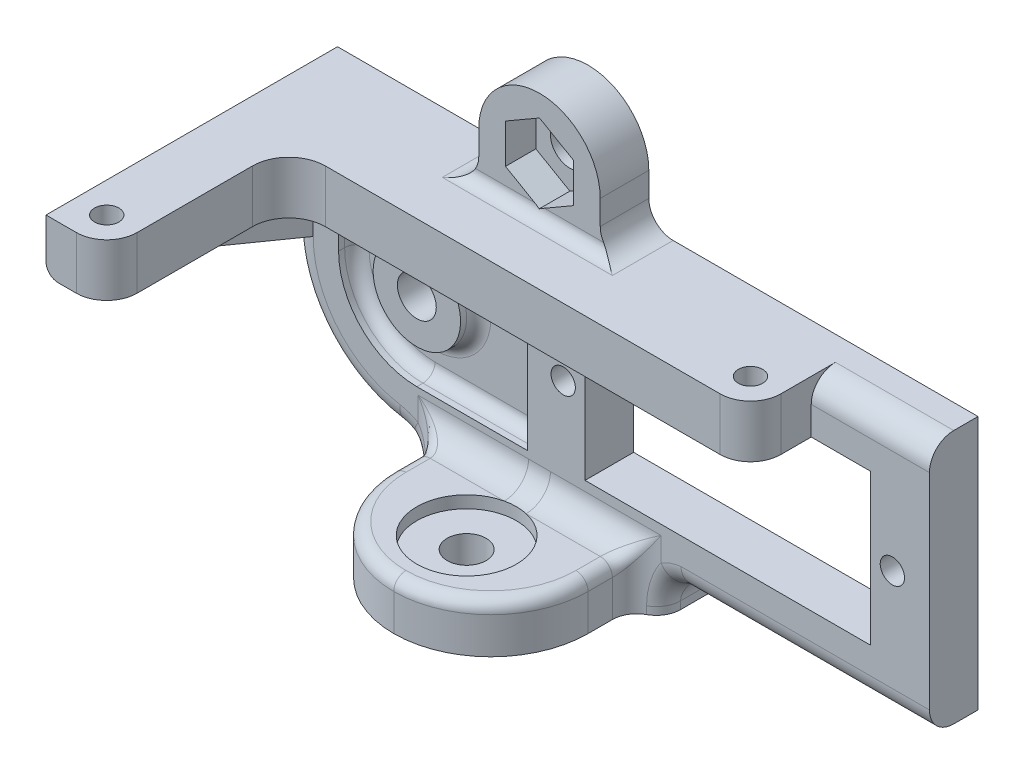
ISO-10303-21;
HEADER;
FILE_DESCRIPTION(('STEP AP214'),'2;1');
FILE_NAME('part.step','',(''),(''),'','','');
FILE_SCHEMA(('AUTOMOTIVE_DESIGN { 1 0 10303 214 1 1 1 1 }'));
ENDSEC;
DATA;
#1=APPLICATION_CONTEXT('core data for automotive mechanical design processes');
#2=APPLICATION_PROTOCOL_DEFINITION('international standard','automotive_design',2000,#1);
#3=PRODUCT_CONTEXT('',#1,'mechanical');
#4=PRODUCT('Part','Part','',(#3));
#5=PRODUCT_RELATED_PRODUCT_CATEGORY('part','',(#4));
#6=PRODUCT_DEFINITION_FORMATION('','',#4);
#7=PRODUCT_DEFINITION_CONTEXT('part definition',#1,'design');
#8=PRODUCT_DEFINITION('design','',#6,#7);
#9=PRODUCT_DEFINITION_SHAPE('','',#8);
#10=(LENGTH_UNIT() NAMED_UNIT(*) SI_UNIT(.MILLI.,.METRE.));
#11=(NAMED_UNIT(*) PLANE_ANGLE_UNIT() SI_UNIT($,.RADIAN.));
#12=(NAMED_UNIT(*) SI_UNIT($,.STERADIAN.) SOLID_ANGLE_UNIT());
#13=UNCERTAINTY_MEASURE_WITH_UNIT(LENGTH_MEASURE(1.E-05),#10,'distance_accuracy_value','');
#14=(GEOMETRIC_REPRESENTATION_CONTEXT(3) GLOBAL_UNCERTAINTY_ASSIGNED_CONTEXT((#13)) GLOBAL_UNIT_ASSIGNED_CONTEXT((#10,
#11,#12)) REPRESENTATION_CONTEXT('',''));
#15=CARTESIAN_POINT('',(0.,0.,0.));
#16=DIRECTION('',(0.,0.,1.));
#17=DIRECTION('',(1.,0.,0.));
#18=AXIS2_PLACEMENT_3D('',#15,#16,#17);
#19=CARTESIAN_POINT('',(22.37,6.19999999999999,24.));
#20=DIRECTION('',(1.,0.,0.));
#21=DIRECTION('',(0.,0.,-1.));
#22=AXIS2_PLACEMENT_3D('',#19,#20,#21);
#23=PLANE('',#22);
#24=DIRECTION('',(0.,0.,-1.));
#25=VECTOR('',#24,1.);
#26=CARTESIAN_POINT('',(22.37,10.53,24.));
#27=LINE('',#26,#25);
#28=CARTESIAN_POINT('',(22.37,10.53,6.5));
#29=VERTEX_POINT('',#28);
#30=CARTESIAN_POINT('',(22.37,10.53,2.));
#31=VERTEX_POINT('',#30);
#32=EDGE_CURVE('E505',#29,#31,#27,.T.);
#33=ORIENTED_EDGE('',*,*,#32,.F.);
#34=DIRECTION('',(0.,1.,0.));
#35=VECTOR('',#34,1.);
#36=CARTESIAN_POINT('',(22.37,6.02999999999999,6.5));
#37=LINE('',#36,#35);
#38=CARTESIAN_POINT('',(22.37,6.19999999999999,6.5));
#39=VERTEX_POINT('',#38);
#40=EDGE_CURVE('E484',#39,#29,#37,.T.);
#41=ORIENTED_EDGE('',*,*,#40,.F.);
#42=DIRECTION('',(0.,0.,-1.));
#43=VECTOR('',#42,1.);
#44=CARTESIAN_POINT('',(22.37,6.19999999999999,24.));
#45=LINE('',#44,#43);
#46=CARTESIAN_POINT('',(22.37,6.19999999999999,4.));
#47=VERTEX_POINT('',#46);
#48=EDGE_CURVE('E506',#39,#47,#45,.T.);
#49=ORIENTED_EDGE('',*,*,#48,.T.);
#50=DIRECTION('',(0.,1.,0.));
#51=VECTOR('',#50,1.);
#52=CARTESIAN_POINT('',(22.37,-12.3693532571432,4.));
#53=LINE('',#52,#51);
#54=CARTESIAN_POINT('',(22.37,8.52999999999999,4.));
#55=VERTEX_POINT('',#54);
#56=EDGE_CURVE('E517',#47,#55,#53,.T.);
#57=ORIENTED_EDGE('',*,*,#56,.T.);
#58=CARTESIAN_POINT('',(22.37,8.52999999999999,2.));
#59=DIRECTION('',(1.,0.,0.));
#60=DIRECTION('',(0.,0.,-1.));
#61=AXIS2_PLACEMENT_3D('',#58,#59,#60);
#62=CIRCLE('',#61,2.);
#63=EDGE_CURVE('E11',#55,#31,#62,.F.);
#64=ORIENTED_EDGE('',*,*,#63,.T.);
#65=EDGE_LOOP('',(#33,#41,#49,#57,#64));
#66=FACE_BOUND('',#65,.T.);
#67=ADVANCED_FACE('F36',(#66),#23,.T.);
#68=CARTESIAN_POINT('',(0.,0.,24.));
#69=DIRECTION('',(0.,0.,-1.));
#70=DIRECTION('',(-1.,0.,0.));
#71=AXIS2_PLACEMENT_3D('',#68,#69,#70);
#72=PLANE('',#71);
#73=DIRECTION('',(0.,1.,0.));
#74=VECTOR('',#73,1.);
#75=CARTESIAN_POINT('',(-20.63,6.2,24.));
#76=LINE('',#75,#74);
#77=CARTESIAN_POINT('',(-20.63,7.2,24.));
#78=VERTEX_POINT('',#77);
#79=CARTESIAN_POINT('',(-20.63,10.53,24.));
#80=VERTEX_POINT('',#79);
#81=EDGE_CURVE('E498',#78,#80,#76,.T.);
#82=ORIENTED_EDGE('',*,*,#81,.F.);
#83=CARTESIAN_POINT('',(-19.63,7.2,24.));
#84=DIRECTION('',(0.,0.,-1.));
#85=DIRECTION('',(-1.,0.,0.));
#86=AXIS2_PLACEMENT_3D('',#83,#84,#85);
#87=CIRCLE('',#86,1.);
#88=CARTESIAN_POINT('',(-19.63,6.2,24.));
#89=VERTEX_POINT('',#88);
#90=EDGE_CURVE('E852',#78,#89,#87,.F.);
#91=ORIENTED_EDGE('',*,*,#90,.T.);
#92=DIRECTION('',(-1.,0.,0.));
#93=VECTOR('',#92,1.);
#94=CARTESIAN_POINT('',(-20.63,6.2,24.));
#95=LINE('',#94,#93);
#96=CARTESIAN_POINT('',(-18.13,6.2,24.));
#97=VERTEX_POINT('',#96);
#98=EDGE_CURVE('E502',#97,#89,#95,.T.);
#99=ORIENTED_EDGE('',*,*,#98,.F.);
#100=DIRECTION('',(0.,1.,0.));
#101=VECTOR('',#100,1.);
#102=CARTESIAN_POINT('',(-18.13,6.02999999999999,24.));
#103=LINE('',#102,#101);
#104=CARTESIAN_POINT('',(-18.13,10.53,24.));
#105=VERTEX_POINT('',#104);
#106=EDGE_CURVE('E769',#105,#97,#103,.F.);
#107=ORIENTED_EDGE('',*,*,#106,.F.);
#108=DIRECTION('',(1.,0.,0.));
#109=VECTOR('',#108,1.);
#110=CARTESIAN_POINT('',(-20.63,10.53,24.));
#111=LINE('',#110,#109);
#112=EDGE_CURVE('E500',#80,#105,#111,.T.);
#113=ORIENTED_EDGE('',*,*,#112,.F.);
#114=EDGE_LOOP('',(#82,#91,#99,#107,#113));
#115=FACE_BOUND('',#114,.T.);
#116=ADVANCED_FACE('F1025',(#115),#72,.F.);
#117=CARTESIAN_POINT('',(12.1,-12.3693532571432,4.));
#118=DIRECTION('',(0.,0.,1.));
#119=DIRECTION('',(1.,0.,0.));
#120=AXIS2_PLACEMENT_3D('',#117,#118,#119);
#121=PLANE('',#120);
#122=DIRECTION('',(0.,-1.,0.));
#123=VECTOR('',#122,1.);
#124=CARTESIAN_POINT('',(-18.63,0.,4.));
#125=LINE('',#124,#123);
#126=CARTESIAN_POINT('',(-18.63,6.2,4.));
#127=VERTEX_POINT('',#126);
#128=CARTESIAN_POINT('',(-18.63,0.,4.));
#129=VERTEX_POINT('',#128);
#130=EDGE_CURVE('E1414',#127,#129,#125,.T.);
#131=ORIENTED_EDGE('',*,*,#130,.T.);
#132=CARTESIAN_POINT('',(-10.1,0.,4.));
#133=DIRECTION('',(0.,0.,1.));
#134=DIRECTION('',(1.,0.,0.));
#135=AXIS2_PLACEMENT_3D('',#132,#133,#134);
#136=CIRCLE('',#135,8.52999999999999);
#137=CARTESIAN_POINT('',(-11.4615323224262,-8.42063713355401,4.));
#138=VERTEX_POINT('',#137);
#139=EDGE_CURVE('E1331',#129,#138,#136,.T.);
#140=ORIENTED_EDGE('',*,*,#139,.T.);
#141=CARTESIAN_POINT('',(-12.1,-12.3693532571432,4.));
#142=DIRECTION('',(0.,0.,1.));
#143=DIRECTION('',(1.,0.,0.));
#144=AXIS2_PLACEMENT_3D('',#141,#142,#143);
#145=CIRCLE('',#144,4.);
#146=CARTESIAN_POINT('',(-10.,-8.96494435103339,4.));
#147=VERTEX_POINT('',#146);
#148=EDGE_CURVE('E1333',#138,#147,#145,.F.);
#149=ORIENTED_EDGE('',*,*,#148,.T.);
#150=DIRECTION('',(0.,-1.,0.));
#151=VECTOR('',#150,1.);
#152=CARTESIAN_POINT('',(-10.,-12.3693532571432,4.));
#153=LINE('',#152,#151);
#154=CARTESIAN_POINT('',(-10.,-7.00000000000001,4.));
#155=VERTEX_POINT('',#154);
#156=EDGE_CURVE('E2029',#147,#155,#153,.F.);
#157=ORIENTED_EDGE('',*,*,#156,.T.);
#158=DIRECTION('',(-1.,0.,0.));
#159=VECTOR('',#158,1.);
#160=CARTESIAN_POINT('',(12.1,-7.00000000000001,4.));
#161=LINE('',#160,#159);
#162=CARTESIAN_POINT('',(-0.899999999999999,-7.00000000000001,4.));
#163=VERTEX_POINT('',#162);
#164=EDGE_CURVE('E1234',#155,#163,#161,.F.);
#165=ORIENTED_EDGE('',*,*,#164,.T.);
#166=CARTESIAN_POINT('',(-1.08714955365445,-7.00050867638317,4.));
#167=CARTESIAN_POINT('',(-1.08217271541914,-7.84169944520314,4.));
#168=CARTESIAN_POINT('',(-1.07869206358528,-8.43000311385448,4.60125980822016));
#169=CARTESIAN_POINT('',(-1.07521141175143,-9.01830678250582,5.20251961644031));
#170=CARTESIAN_POINT('',(-1.07531972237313,-9.00000000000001,6.04352587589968));
#171=CARTESIAN_POINT('',(-0.995590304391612,-6.99998998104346,4.));
#172=CARTESIAN_POINT('',(-0.993808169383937,-7.83444813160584,4.));
#173=CARTESIAN_POINT('',(-0.992357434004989,-8.42147818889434,4.59305989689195));
#174=CARTESIAN_POINT('',(-0.991130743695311,-9.008524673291,5.18613714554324));
#175=CARTESIAN_POINT('',(-0.991025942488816,-9.00000000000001,6.02057890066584));
#176=CARTESIAN_POINT('',(-0.904031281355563,-6.99992316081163,4.));
#177=CARTESIAN_POINT('',(-0.90429620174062,-7.8283438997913,4.));
#178=CARTESIAN_POINT('',(-0.904336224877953,-8.41414305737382,4.58576598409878));
#179=CARTESIAN_POINT('',(-0.904545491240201,-8.9999526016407,5.17154297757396));
#180=CARTESIAN_POINT('',(-0.904455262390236,-9.00000000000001,5.99997985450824));
#181=CARTESIAN_POINT('',(-0.7209138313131,-7.00024465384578,4.));
#182=CARTESIAN_POINT('',(-0.723817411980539,-7.81817756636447,4.));
#183=CARTESIAN_POINT('',(-0.725743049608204,-8.40172362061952,4.57314029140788));
#184=CARTESIAN_POINT('',(-0.727829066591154,-8.98528220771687,5.14629287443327));
#185=CARTESIAN_POINT('',(-0.727783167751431,-9.00000000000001,5.96411336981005));
#186=CARTESIAN_POINT('',(-0.629355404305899,-7.00063296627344,4.));
#187=CARTESIAN_POINT('',(-0.632801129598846,-7.81410876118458,4.));
#188=CARTESIAN_POINT('',(-0.635171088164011,-8.39663931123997,4.56780850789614));
#189=CARTESIAN_POINT('',(-0.637653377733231,-8.9791750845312,5.1356223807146));
#190=CARTESIAN_POINT('',(-0.637681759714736,-9.00000000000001,5.94884592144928));
#191=CARTESIAN_POINT('',(-0.4463515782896,-7.00141562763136,4.));
#192=CARTESIAN_POINT('',(-0.449930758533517,-7.8077413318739,4.));
#193=CARTESIAN_POINT('',(-0.452410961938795,-8.38859767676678,4.55926243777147));
#194=CARTESIAN_POINT('',(-0.455006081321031,-8.96945879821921,5.11853013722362));
#195=CARTESIAN_POINT('',(-0.455083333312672,-9.00000000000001,5.92429340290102));
#196=CARTESIAN_POINT('',(-0.354906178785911,-7.00180996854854,4.));
#197=CARTESIAN_POINT('',(-0.358022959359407,-7.80543639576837,4.));
#198=CARTESIAN_POINT('',(-0.360224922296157,-8.3856377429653,4.5560455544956));
#199=CARTESIAN_POINT('',(-0.362484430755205,-8.96584050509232,5.1120926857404));
#200=CARTESIAN_POINT('',(-0.36258939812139,-9.00000000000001,5.91500099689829));
#201=CARTESIAN_POINT('',(-0.172014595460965,-7.00236306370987,4.));
#202=CARTESIAN_POINT('',(-0.173772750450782,-7.8024287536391,4.));
#203=CARTESIAN_POINT('',(-0.174997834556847,-8.38175606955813,4.55180265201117));
#204=CARTESIAN_POINT('',(-0.176279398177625,-8.96108436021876,5.10360633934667));
#205=CARTESIAN_POINT('',(-0.17633667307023,-9.00000000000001,5.90272800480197));
#206=CARTESIAN_POINT('',(-0.0805684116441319,-7.00252181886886,4.));
#207=CARTESIAN_POINT('',(-0.0813720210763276,-7.80172409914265,4.));
#208=CARTESIAN_POINT('',(-0.0819567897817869,-8.38083432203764,4.55077662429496));
#209=CARTESIAN_POINT('',(-0.0825375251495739,-8.95994346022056,5.10155202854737));
#210=CARTESIAN_POINT('',(-0.0825778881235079,-9.00000000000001,5.89974739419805));
#211=CARTESIAN_POINT('',(0.192841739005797,-7.00245904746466,4.));
#212=CARTESIAN_POINT('',(0.194773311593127,-7.80189209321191,4.));
#213=CARTESIAN_POINT('',(0.19616538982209,-8.38106413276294,4.55104849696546));
#214=CARTESIAN_POINT('',(0.197563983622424,-8.960238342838,5.10209943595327));
#215=CARTESIAN_POINT('',(0.19765323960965,-9.00000000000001,5.90054797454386));
#216=CARTESIAN_POINT('',(0.374804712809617,-7.00170554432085,4.));
#217=CARTESIAN_POINT('',(0.378746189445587,-7.80501837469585,4.));
#218=CARTESIAN_POINT('',(0.381189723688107,-8.38517111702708,4.55565207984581));
#219=CARTESIAN_POINT('',(0.38410371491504,-8.96534566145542,5.11132844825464));
#220=CARTESIAN_POINT('',(0.38403216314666,-9.00000000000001,5.91394285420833));
#221=CARTESIAN_POINT('',(0.738942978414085,-7.00018127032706,4.));
#222=CARTESIAN_POINT('',(0.742335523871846,-7.81819398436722,4.));
#223=CARTESIAN_POINT('',(0.744357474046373,-8.40176825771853,4.57322566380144));
#224=CARTESIAN_POINT('',(0.746837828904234,-8.98536317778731,5.14647198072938));
#225=CARTESIAN_POINT('',(0.746654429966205,-9.00000000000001,5.96438563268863));
#226=CARTESIAN_POINT('',(0.921118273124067,-6.99941048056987,4.));
#227=CARTESIAN_POINT('',(0.922380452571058,-7.82828522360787,4.));
#228=CARTESIAN_POINT('',(0.922492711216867,-8.41426807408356,4.58620530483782));
#229=CARTESIAN_POINT('',(0.923437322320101,-9.00033438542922,5.17249165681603));
#230=CARTESIAN_POINT('',(0.922885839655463,-9.00000000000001,6.00146078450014));
#231=CARTESIAN_POINT('',(1.28792036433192,-7.00182444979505,4.));
#232=CARTESIAN_POINT('',(1.27637733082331,-7.85797258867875,4.));
#233=CARTESIAN_POINT('',(1.26761211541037,-8.44900244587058,4.61944430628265));
#234=CARTESIAN_POINT('',(1.25970303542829,-9.04011878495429,5.23897017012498));
#235=CARTESIAN_POINT('',(1.25969890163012,-9.00000000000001,6.09434214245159));
#236=CARTESIAN_POINT('',(1.47254711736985,-7.00506264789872,4.));
#237=CARTESIAN_POINT('',(1.45054595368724,-7.87777343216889,4.));
#238=CARTESIAN_POINT('',(1.43441368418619,-8.4713659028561,4.63979940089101));
#239=CARTESIAN_POINT('',(1.41936748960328,-9.06515238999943,5.27975993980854));
#240=CARTESIAN_POINT('',(1.42003768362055,-9.00000000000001,6.15039400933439));
#241=CARTESIAN_POINT('',(1.84102544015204,-7.02136961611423,4.));
#242=CARTESIAN_POINT('',(1.78544334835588,-7.92982994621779,4.));
#243=CARTESIAN_POINT('',(1.74777474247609,-8.52677002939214,4.68593147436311));
#244=CARTESIAN_POINT('',(1.71118603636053,-9.12389904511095,5.37202067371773));
#245=CARTESIAN_POINT('',(1.71785660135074,-9.00000000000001,6.27374833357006));
#246=CARTESIAN_POINT('',(2.02487775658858,-7.03441180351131,4.));
#247=CARTESIAN_POINT('',(1.94640829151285,-7.96218379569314,4.));
#248=CARTESIAN_POINT('',(1.89438770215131,-8.55978168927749,4.71169365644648));
#249=CARTESIAN_POINT('',(1.84347914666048,-9.15770017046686,5.42361749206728));
#250=CARTESIAN_POINT('',(1.85539732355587,-9.00000000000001,6.34101998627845));
#251=CARTESIAN_POINT('',(2.29987758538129,-7.06646294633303,4.));
#252=CARTESIAN_POINT('',(2.1741585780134,-8.02157482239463,4.));
#253=CARTESIAN_POINT('',(2.09540424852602,-8.61703769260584,4.75310018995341));
#254=CARTESIAN_POINT('',(2.01694308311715,-9.21258211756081,5.5062602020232));
#255=CARTESIAN_POINT('',(2.04458336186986,-9.00000000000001,6.44543577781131));
#256=CARTESIAN_POINT('',(2.39172782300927,-7.07929363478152,4.));
#257=CARTESIAN_POINT('',(2.24826794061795,-8.04336984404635,4.));
#258=CARTESIAN_POINT('',(2.1594459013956,-8.63749633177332,4.76741677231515));
#259=CARTESIAN_POINT('',(2.07089942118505,-9.23172054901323,5.5349001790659));
#260=CARTESIAN_POINT('',(2.10496837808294,-9.00000000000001,6.48095356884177));
#261=CARTESIAN_POINT('',(2.57453263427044,-7.11006377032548,4.));
#262=CARTESIAN_POINT('',(2.39100159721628,-8.09066707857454,4.));
#263=CARTESIAN_POINT('',(2.28017335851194,-8.68061966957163,4.7967017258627));
#264=CARTESIAN_POINT('',(2.16961890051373,-9.27067075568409,5.5934700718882));
#265=CARTESIAN_POINT('',(2.21987430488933,-9.00000000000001,6.55228708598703));
#266=CARTESIAN_POINT('',(2.66548767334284,-7.12800039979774,4.));
#267=CARTESIAN_POINT('',(2.4596211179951,-8.11618989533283,4.));
#268=CARTESIAN_POINT('',(2.33686319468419,-8.70328314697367,4.81166973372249));
#269=CARTESIAN_POINT('',(2.2143570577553,-9.2904899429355,5.62341224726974));
#270=CARTESIAN_POINT('',(2.27439842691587,-9.00000000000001,6.58810263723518));
#271=CARTESIAN_POINT('',(2.84690210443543,-7.17011334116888,4.));
#272=CARTESIAN_POINT('',(2.5911363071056,-8.17108762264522,4.));
#273=CARTESIAN_POINT('',(2.44262593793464,-8.75051449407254,4.8421597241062));
#274=CARTESIAN_POINT('',(2.29437192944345,-9.33005473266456,5.68439315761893));
#275=CARTESIAN_POINT('',(2.37823640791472,-9.00000000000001,6.65963925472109));
#276=CARTESIAN_POINT('',(2.93734828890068,-7.19434807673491,4.));
#277=CARTESIAN_POINT('',(2.65394713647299,-8.20051823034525,4.));
#278=CARTESIAN_POINT('',(2.49162023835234,-8.77509860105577,4.85768565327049));
#279=CARTESIAN_POINT('',(2.32950974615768,-9.34979887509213,5.71544730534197));
#280=CARTESIAN_POINT('',(2.4274950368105,-9.00000000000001,6.69535608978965));
#281=CARTESIAN_POINT('',(3.1162080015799,-7.24995922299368,4.));
#282=CARTESIAN_POINT('',(2.77224357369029,-8.26257572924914,4.));
#283=CARTESIAN_POINT('',(2.58068088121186,-8.82504167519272,4.88890442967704));
#284=CARTESIAN_POINT('',(2.38934642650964,-9.38763707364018,5.77788872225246));
#285=CARTESIAN_POINT('',(2.52047616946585,-9.00000000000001,6.76571579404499));
#286=CARTESIAN_POINT('',(3.20461691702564,-7.28135036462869,4.));
#287=CARTESIAN_POINT('',(2.82768033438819,-8.29522709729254,4.));
#288=CARTESIAN_POINT('',(2.62072846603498,-8.85040214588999,4.90459755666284));
#289=CARTESIAN_POINT('',(2.41397265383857,-9.40572043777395,5.80928009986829));
#290=CARTESIAN_POINT('',(2.56418696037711,-9.00000000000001,6.80035627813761));
#291=CARTESIAN_POINT('',(3.2914960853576,-7.31676574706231,4.));
#292=CARTESIAN_POINT('',(2.87872613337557,-8.32908571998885,4.));
#293=CARTESIAN_POINT('',(2.65587508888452,-8.87562880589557,4.92021672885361));
#294=CARTESIAN_POINT('',(2.43302404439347,-9.42217189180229,5.84043345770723));
#295=CARTESIAN_POINT('',(2.60516316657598,-9.00000000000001,6.83406808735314));
#296=(BOUNDED_SURFACE() B_SPLINE_SURFACE(3,2,((#166,#167,#168,#169,#170),(#171,#172,#173,#174,
#175),(#176,#177,#178,#179,#180),(#181,#182,#183,#184,#185),(#186,#187,#188,#189,#190),(#191,
#192,#193,#194,#195),(#196,#197,#198,#199,#200),(#201,#202,#203,#204,#205),(#206,#207,#208,#209,
#210),(#211,#212,#213,#214,#215),(#216,#217,#218,#219,#220),(#221,#222,#223,#224,#225),(#226,
#227,#228,#229,#230),(#231,#232,#233,#234,#235),(#236,#237,#238,#239,#240),(#241,#242,#243,#244,
#245),(#246,#247,#248,#249,#250),(#251,#252,#253,#254,#255),(#256,#257,#258,#259,#260),(#261,
#262,#263,#264,#265),(#266,#267,#268,#269,#270),(#271,#272,#273,#274,#275),(#276,#277,#278,#279,
#280),(#281,#282,#283,#284,#285),(#286,#287,#288,#289,#290),(#291,#292,#293,#294,#295)),
.UNSPECIFIED.,.F.,.F.,.F.) B_SPLINE_SURFACE_WITH_KNOTS((4,2,2,2,2,2,2,2,2,2,2,2,4),(3,2,3),(0.,
0.274677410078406,0.549354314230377,0.8236933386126,1.09803129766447,1.64392502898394,
2.1904481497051,2.74433541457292,3.29672625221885,3.5748343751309,3.85278932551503,
4.13342093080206,4.41463549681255),(0.,0.5,1.),
.UNSPECIFIED.) GEOMETRIC_REPRESENTATION_ITEM() RATIONAL_B_SPLINE_SURFACE(((1.,0.921783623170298,
1.,0.921783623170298,1.),(1.,0.922895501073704,1.,0.922895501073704,1.),(1.,0.923882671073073,
1.,0.923882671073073,1.),(1.,0.925589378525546,1.,0.925589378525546,1.),(1.,0.926308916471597,
1.,0.926308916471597,1.),(1.,0.927461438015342,1.,0.927461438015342,1.),(1.,0.927894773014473,
1.,0.927894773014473,1.),(1.,0.92846615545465,1.,0.92846615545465,1.),(1.,0.928604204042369,1.,
0.928604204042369,1.),(1.,0.928567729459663,1.,0.928567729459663,1.),(1.,0.927948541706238,1.,
0.927948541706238,1.),(1.,0.925578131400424,1.,0.925578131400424,1.),(1.,0.923825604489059,1.,
0.923825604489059,1.),(1.,0.919317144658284,1.,0.919317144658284,1.),(1.,0.916548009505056,1.,
0.916548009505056,1.),(1.,0.910234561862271,1.,0.910234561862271,1.),(1.,0.90669236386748,1.,
0.90669236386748,1.),(1.,0.900959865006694,1.,0.900959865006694,1.),(1.,0.898971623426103,1.,
0.898971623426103,1.),(1.,0.89489034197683,1.,0.89489034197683,1.),(1.,0.892797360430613,1.,
0.892797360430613,1.),(1.,0.888518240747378,1.,0.888518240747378,1.),(1.,0.88633139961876,1.,
0.88633139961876,1.),(1.,0.881917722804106,1.,0.881917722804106,1.),(1.,0.879690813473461,1.,
0.879690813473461,1.),(1.,0.877465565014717,1.,0.877465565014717,1.))) REPRESENTATION_ITEM('') SURFACE());
#297=CARTESIAN_POINT('',(-1.08714955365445,-7.00050867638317,4.));
#298=CARTESIAN_POINT('',(-0.995590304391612,-6.99998998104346,4.));
#299=CARTESIAN_POINT('',(-0.904031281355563,-6.99992316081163,4.));
#300=CARTESIAN_POINT('',(-0.7209138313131,-7.00024465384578,4.));
#301=CARTESIAN_POINT('',(-0.629355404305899,-7.00063296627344,4.));
#302=CARTESIAN_POINT('',(-0.446351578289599,-7.00141562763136,4.));
#303=CARTESIAN_POINT('',(-0.354906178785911,-7.00180996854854,4.));
#304=CARTESIAN_POINT('',(-0.172014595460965,-7.00236306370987,4.));
#305=CARTESIAN_POINT('',(-0.0805684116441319,-7.00252181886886,4.));
#306=CARTESIAN_POINT('',(0.192841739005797,-7.00245904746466,4.));
#307=CARTESIAN_POINT('',(0.374804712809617,-7.00170554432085,4.));
#308=CARTESIAN_POINT('',(0.738942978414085,-7.00018127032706,4.));
#309=CARTESIAN_POINT('',(0.921118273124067,-6.99941048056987,4.));
#310=CARTESIAN_POINT('',(1.28792036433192,-7.00182444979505,4.));
#311=CARTESIAN_POINT('',(1.47254711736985,-7.00506264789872,4.));
#312=CARTESIAN_POINT('',(1.84102544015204,-7.02136961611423,4.));
#313=CARTESIAN_POINT('',(2.02487775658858,-7.03441180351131,4.));
#314=CARTESIAN_POINT('',(2.29987758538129,-7.06646294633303,4.));
#315=CARTESIAN_POINT('',(2.39172782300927,-7.07929363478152,4.));
#316=CARTESIAN_POINT('',(2.57453263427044,-7.11006377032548,4.));
#317=CARTESIAN_POINT('',(2.66548767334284,-7.12800039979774,4.));
#318=CARTESIAN_POINT('',(2.84690210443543,-7.17011334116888,4.));
#319=CARTESIAN_POINT('',(2.93734828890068,-7.19434807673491,4.));
#320=CARTESIAN_POINT('',(3.1162080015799,-7.24995922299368,4.));
#321=CARTESIAN_POINT('',(3.20461691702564,-7.28135036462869,4.));
#322=CARTESIAN_POINT('',(3.2914960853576,-7.31676574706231,4.));
#323=B_SPLINE_CURVE_WITH_KNOTS('',3,(#297,#298,#299,#300,#301,#302,#303,#304,#305,#306,#307,
#308,#309,#310,#311,#312,#313,#314,#315,#316,#317,#318,#319,#320,#321,#322),.UNSPECIFIED.,.F.,
.F.,(4,2,2,2,2,2,2,2,2,2,2,2,4),(0.,0.274677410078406,0.549354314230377,0.8236933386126,
1.09803129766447,1.64392502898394,2.1904481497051,2.74433541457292,3.29672625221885,
3.5748343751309,3.85278932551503,4.13342093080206,4.41463549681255),.UNSPECIFIED.);
#324=CARTESIAN_POINT('',(0.899999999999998,-7.00000000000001,4.));
#325=VERTEX_POINT('',#324);
#326=EDGE_CURVE('E1228',#163,#325,#323,.T.);
#327=ORIENTED_EDGE('',*,*,#326,.T.);
#328=DIRECTION('',(-1.,0.,0.));
#329=VECTOR('',#328,1.);
#330=CARTESIAN_POINT('',(12.1,-7.00000000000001,4.));
#331=LINE('',#330,#329);
#332=CARTESIAN_POINT('',(10.,-7.00000000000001,4.));
#333=VERTEX_POINT('',#332);
#334=EDGE_CURVE('E1229',#325,#333,#331,.F.);
#335=ORIENTED_EDGE('',*,*,#334,.T.);
#336=DIRECTION('',(0.,1.,0.));
#337=VECTOR('',#336,1.);
#338=CARTESIAN_POINT('',(10.,-12.3693532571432,4.));
#339=LINE('',#338,#337);
#340=CARTESIAN_POINT('',(10.,-8.96494435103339,4.));
#341=VERTEX_POINT('',#340);
#342=EDGE_CURVE('E2031',#333,#341,#339,.F.);
#343=ORIENTED_EDGE('',*,*,#342,.T.);
#344=CARTESIAN_POINT('',(12.1,-12.3693532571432,4.));
#345=DIRECTION('',(0.,0.,1.));
#346=DIRECTION('',(1.,0.,0.));
#347=AXIS2_PLACEMENT_3D('',#344,#345,#346);
#348=CIRCLE('',#347,4.);
#349=CARTESIAN_POINT('',(11.6478075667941,-8.39499519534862,4.));
#350=VERTEX_POINT('',#349);
#351=EDGE_CURVE('E1361',#341,#350,#348,.F.);
#352=ORIENTED_EDGE('',*,*,#351,.T.);
#353=DIRECTION('',(1.,0.,0.));
#354=VECTOR('',#353,1.);
#355=CARTESIAN_POINT('',(32.1,-8.39499519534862,4.));
#356=LINE('',#355,#354);
#357=CARTESIAN_POINT('',(32.1,-8.39499519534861,4.));
#358=VERTEX_POINT('',#357);
#359=EDGE_CURVE('E909',#350,#358,#356,.T.);
#360=ORIENTED_EDGE('',*,*,#359,.T.);
#361=DIRECTION('',(0.,1.,0.));
#362=VECTOR('',#361,1.);
#363=CARTESIAN_POINT('',(32.1,10.53,4.));
#364=LINE('',#363,#362);
#365=CARTESIAN_POINT('',(32.1,8.53,4.));
#366=VERTEX_POINT('',#365);
#367=EDGE_CURVE('E657',#358,#366,#364,.T.);
#368=ORIENTED_EDGE('',*,*,#367,.T.);
#369=DIRECTION('',(-1.,0.,0.));
#370=VECTOR('',#369,1.);
#371=CARTESIAN_POINT('',(22.37,8.52999999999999,4.));
#372=LINE('',#371,#370);
#373=EDGE_CURVE('E1358',#366,#55,#372,.T.);
#374=ORIENTED_EDGE('',*,*,#373,.T.);
#375=ORIENTED_EDGE('',*,*,#56,.F.);
#376=DIRECTION('',(-1.,0.,0.));
#377=VECTOR('',#376,1.);
#378=CARTESIAN_POINT('',(3.75,6.2,4.));
#379=LINE('',#378,#377);
#380=CARTESIAN_POINT('',(27.25,6.2,4.));
#381=VERTEX_POINT('',#380);
#382=EDGE_CURVE('E611',#381,#47,#379,.T.);
#383=ORIENTED_EDGE('',*,*,#382,.F.);
#384=DIRECTION('',(0.,1.,0.));
#385=VECTOR('',#384,1.);
#386=CARTESIAN_POINT('',(27.25,6.2,4.));
#387=LINE('',#386,#385);
#388=CARTESIAN_POINT('',(27.25,-6.2,4.));
#389=VERTEX_POINT('',#388);
#390=EDGE_CURVE('E608',#389,#381,#387,.T.);
#391=ORIENTED_EDGE('',*,*,#390,.F.);
#392=DIRECTION('',(1.,0.,0.));
#393=VECTOR('',#392,1.);
#394=CARTESIAN_POINT('',(3.75,-6.2,4.));
#395=LINE('',#394,#393);
#396=CARTESIAN_POINT('',(3.75,-6.2,4.));
#397=VERTEX_POINT('',#396);
#398=EDGE_CURVE('E605',#397,#389,#395,.T.);
#399=ORIENTED_EDGE('',*,*,#398,.F.);
#400=DIRECTION('',(0.,-1.,0.));
#401=VECTOR('',#400,1.);
#402=CARTESIAN_POINT('',(3.75,6.2,4.));
#403=LINE('',#402,#401);
#404=CARTESIAN_POINT('',(3.75,6.2,4.));
#405=VERTEX_POINT('',#404);
#406=EDGE_CURVE('E603',#405,#397,#403,.T.);
#407=ORIENTED_EDGE('',*,*,#406,.F.);
#408=DIRECTION('',(1.,0.,0.));
#409=VECTOR('',#408,1.);
#410=CARTESIAN_POINT('',(12.1,6.2,4.));
#411=LINE('',#410,#409);
#412=CARTESIAN_POINT('',(-1.,6.2,4.));
#413=VERTEX_POINT('',#412);
#414=EDGE_CURVE('E514',#413,#405,#411,.T.);
#415=ORIENTED_EDGE('',*,*,#414,.F.);
#416=DIRECTION('',(0.,1.,0.));
#417=VECTOR('',#416,1.);
#418=CARTESIAN_POINT('',(-1.,6.4430025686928,4.));
#419=LINE('',#418,#417);
#420=CARTESIAN_POINT('',(-1.,-6.4430025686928,4.));
#421=VERTEX_POINT('',#420);
#422=EDGE_CURVE('E578',#421,#413,#419,.T.);
#423=ORIENTED_EDGE('',*,*,#422,.F.);
#424=DIRECTION('',(1.,0.,0.));
#425=VECTOR('',#424,1.);
#426=CARTESIAN_POINT('',(-10.1,-6.4430025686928,4.));
#427=LINE('',#426,#425);
#428=CARTESIAN_POINT('',(-10.1,-6.4430025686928,4.));
#429=VERTEX_POINT('',#428);
#430=EDGE_CURVE('E575',#429,#421,#427,.T.);
#431=ORIENTED_EDGE('',*,*,#430,.F.);
#432=CARTESIAN_POINT('',(-10.1,0.,4.));
#433=DIRECTION('',(0.,0.,1.));
#434=DIRECTION('',(-1.,0.,0.));
#435=AXIS2_PLACEMENT_3D('',#432,#433,#434);
#436=CIRCLE('',#435,6.4430025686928);
#437=CARTESIAN_POINT('',(-16.5430025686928,0.,4.));
#438=VERTEX_POINT('',#437);
#439=EDGE_CURVE('E572',#438,#429,#436,.T.);
#440=ORIENTED_EDGE('',*,*,#439,.F.);
#441=DIRECTION('',(0.,-1.,0.));
#442=VECTOR('',#441,1.);
#443=CARTESIAN_POINT('',(-16.5430025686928,0.,4.));
#444=LINE('',#443,#442);
#445=CARTESIAN_POINT('',(-16.5430025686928,6.2,4.));
#446=VERTEX_POINT('',#445);
#447=EDGE_CURVE('E581',#446,#438,#444,.T.);
#448=ORIENTED_EDGE('',*,*,#447,.F.);
#449=EDGE_CURVE('E516',#127,#446,#411,.T.);
#450=ORIENTED_EDGE('',*,*,#449,.F.);
#451=EDGE_LOOP('',(#131,#140,#149,#157,#165,#327,#335,#343,#352,#360,#368,#374,#375,#383,#391,
#399,#407,#415,#423,#431,#440,#448,#450));
#452=FACE_BOUND('',#451,.T.);
#453=CARTESIAN_POINT('',(29.05,0.,4.));
#454=DIRECTION('',(0.,0.,1.));
#455=DIRECTION('',(1.,0.,0.));
#456=AXIS2_PLACEMENT_3D('',#453,#454,#455);
#457=CIRCLE('',#456,0.999999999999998);
#458=CARTESIAN_POINT('',(30.05,0.,4.));
#459=VERTEX_POINT('',#458);
#460=EDGE_CURVE('E642',#459,#459,#457,.T.);
#461=ORIENTED_EDGE('',*,*,#460,.F.);
#462=EDGE_LOOP('',(#461));
#463=FACE_BOUND('',#462,.T.);
#464=CARTESIAN_POINT('',(1.95,0.,4.));
#465=DIRECTION('',(0.,0.,1.));
#466=DIRECTION('',(1.,0.,0.));
#467=AXIS2_PLACEMENT_3D('',#464,#465,#466);
#468=CIRCLE('',#467,1.);
#469=CARTESIAN_POINT('',(2.95,0.,4.));
#470=VERTEX_POINT('',#469);
#471=EDGE_CURVE('E636',#470,#470,#468,.T.);
#472=ORIENTED_EDGE('',*,*,#471,.F.);
#473=EDGE_LOOP('',(#472));
#474=FACE_BOUND('',#473,.T.);
#475=ADVANCED_FACE('F1031',(#452,#463,#474),#121,.T.);
#476=CARTESIAN_POINT('',(0.,14.53,4.));
#477=DIRECTION('',(0.,0.,-1.));
#478=DIRECTION('',(-1.,0.,0.));
#479=AXIS2_PLACEMENT_3D('',#476,#477,#478);
#480=CYLINDRICAL_SURFACE('',#479,1.6);
#481=CARTESIAN_POINT('',(0.,14.53,0.));
#482=DIRECTION('',(0.,0.,1.));
#483=DIRECTION('',(1.,0.,0.));
#484=AXIS2_PLACEMENT_3D('',#481,#482,#483);
#485=CIRCLE('',#484,1.6);
#486=CARTESIAN_POINT('',(1.6,14.53,0.));
#487=VERTEX_POINT('',#486);
#488=EDGE_CURVE('E645',#487,#487,#485,.T.);
#489=ORIENTED_EDGE('',*,*,#488,.F.);
#490=EDGE_LOOP('',(#489));
#491=FACE_BOUND('',#490,.T.);
#492=CARTESIAN_POINT('',(0.,14.53,1.5));
#493=DIRECTION('',(0.,0.,1.));
#494=DIRECTION('',(1.,0.,0.));
#495=AXIS2_PLACEMENT_3D('',#492,#493,#494);
#496=CIRCLE('',#495,1.6);
#497=CARTESIAN_POINT('',(1.6,14.53,1.5));
#498=VERTEX_POINT('',#497);
#499=EDGE_CURVE('E557',#498,#498,#496,.T.);
#500=ORIENTED_EDGE('',*,*,#499,.T.);
#501=EDGE_LOOP('',(#500));
#502=FACE_BOUND('',#501,.T.);
#503=ADVANCED_FACE('F1702',(#491,#502),#480,.F.);
#504=CARTESIAN_POINT('',(-10.1,0.,4.));
#505=DIRECTION('',(0.,0.,1.));
#506=DIRECTION('',(1.,0.,0.));
#507=AXIS2_PLACEMENT_3D('',#504,#505,#506);
#508=CIRCLE('',#507,1.6);
#509=CARTESIAN_POINT('',(-8.49999999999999,0.,4.));
#510=VERTEX_POINT('',#509);
#511=EDGE_CURVE('E651',#510,#510,#508,.T.);
#512=ORIENTED_EDGE('',*,*,#511,.F.);
#513=EDGE_LOOP('',(#512));
#514=FACE_BOUND('',#513,.T.);
#515=CARTESIAN_POINT('',(-10.1,0.,4.));
#516=DIRECTION('',(0.,0.,1.));
#517=DIRECTION('',(-1.,0.,0.));
#518=AXIS2_PLACEMENT_3D('',#515,#516,#517);
#519=CIRCLE('',#518,3.6);
#520=CARTESIAN_POINT('',(-13.7,0.,4.));
#521=VERTEX_POINT('',#520);
#522=EDGE_CURVE('E569',#521,#521,#519,.T.);
#523=ORIENTED_EDGE('',*,*,#522,.T.);
#524=EDGE_LOOP('',(#523));
#525=FACE_BOUND('',#524,.T.);
#526=ADVANCED_FACE('F1250',(#514,#525),#121,.T.);
#527=CARTESIAN_POINT('',(0.,-13.,10.));
#528=DIRECTION('',(0.,1.,0.));
#529=DIRECTION('',(0.,0.,1.));
#530=AXIS2_PLACEMENT_3D('',#527,#528,#529);
#531=CYLINDRICAL_SURFACE('',#530,1.6);
#532=CARTESIAN_POINT('',(0.,-13.,10.));
#533=DIRECTION('',(0.,1.,0.));
#534=DIRECTION('',(0.,0.,1.));
#535=AXIS2_PLACEMENT_3D('',#532,#533,#534);
#536=CIRCLE('',#535,1.6);
#537=CARTESIAN_POINT('',(0.,-13.,11.6));
#538=VERTEX_POINT('',#537);
#539=EDGE_CURVE('E599',#538,#538,#536,.T.);
#540=ORIENTED_EDGE('',*,*,#539,.F.);
#541=EDGE_LOOP('',(#540));
#542=FACE_BOUND('',#541,.T.);
#543=CARTESIAN_POINT('',(0.,-10.,10.));
#544=DIRECTION('',(0.,1.,0.));
#545=DIRECTION('',(0.,0.,1.));
#546=AXIS2_PLACEMENT_3D('',#543,#544,#545);
#547=CIRCLE('',#546,1.6);
#548=CARTESIAN_POINT('',(0.,-10.,11.6));
#549=VERTEX_POINT('',#548);
#550=EDGE_CURVE('E594',#549,#549,#547,.F.);
#551=ORIENTED_EDGE('',*,*,#550,.F.);
#552=EDGE_LOOP('',(#551));
#553=FACE_BOUND('',#552,.T.);
#554=ADVANCED_FACE('F1101',(#542,#553),#531,.F.);
#555=CARTESIAN_POINT('',(-7.,12.53,4.));
#556=DIRECTION('',(0.,0.,-1.));
#557=DIRECTION('',(-1.,0.,0.));
#558=AXIS2_PLACEMENT_3D('',#555,#556,#557);
#559=CIRCLE('',#558,2.);
#560=CARTESIAN_POINT('',(-5.,12.53,4.));
#561=VERTEX_POINT('',#560);
#562=CARTESIAN_POINT('',(-5.26794919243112,11.53,4.));
#563=VERTEX_POINT('',#562);
#564=EDGE_CURVE('E669',#561,#563,#559,.T.);
#565=ORIENTED_EDGE('',*,*,#564,.T.);
#566=DIRECTION('',(-1.,0.,0.));
#567=VECTOR('',#566,1.);
#568=CARTESIAN_POINT('',(12.1,11.53,4.));
#569=LINE('',#568,#567);
#570=CARTESIAN_POINT('',(-0.403847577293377,11.53,4.));
#571=VERTEX_POINT('',#570);
#572=EDGE_CURVE('E832',#563,#571,#569,.F.);
#573=ORIENTED_EDGE('',*,*,#572,.T.);
#574=DIRECTION('',(0.866025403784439,-0.5,0.));
#575=VECTOR('',#574,1.);
#576=CARTESIAN_POINT('',(-2.8,12.913419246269,4.));
#577=LINE('',#576,#575);
#578=CARTESIAN_POINT('',(-2.8,12.913419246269,4.));
#579=VERTEX_POINT('',#578);
#580=EDGE_CURVE('E548',#579,#571,#577,.T.);
#581=ORIENTED_EDGE('',*,*,#580,.F.);
#582=DIRECTION('',(0.,-1.,0.));
#583=VECTOR('',#582,1.);
#584=CARTESIAN_POINT('',(-2.8,16.1465807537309,4.));
#585=LINE('',#584,#583);
#586=CARTESIAN_POINT('',(-2.8,16.1465807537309,4.));
#587=VERTEX_POINT('',#586);
#588=EDGE_CURVE('E545',#587,#579,#585,.T.);
#589=ORIENTED_EDGE('',*,*,#588,.F.);
#590=DIRECTION('',(-0.866025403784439,-0.5,0.));
#591=VECTOR('',#590,1.);
#592=CARTESIAN_POINT('',(0.,17.7631615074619,4.));
#593=LINE('',#592,#591);
#594=CARTESIAN_POINT('',(0.,17.7631615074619,4.));
#595=VERTEX_POINT('',#594);
#596=EDGE_CURVE('E542',#595,#587,#593,.T.);
#597=ORIENTED_EDGE('',*,*,#596,.F.);
#598=DIRECTION('',(-0.866025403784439,0.5,0.));
#599=VECTOR('',#598,1.);
#600=CARTESIAN_POINT('',(2.8,16.1465807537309,4.));
#601=LINE('',#600,#599);
#602=CARTESIAN_POINT('',(2.8,16.1465807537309,4.));
#603=VERTEX_POINT('',#602);
#604=EDGE_CURVE('E520',#603,#595,#601,.T.);
#605=ORIENTED_EDGE('',*,*,#604,.F.);
#606=DIRECTION('',(0.,1.,0.));
#607=VECTOR('',#606,1.);
#608=CARTESIAN_POINT('',(2.8,12.913419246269,4.));
#609=LINE('',#608,#607);
#610=CARTESIAN_POINT('',(2.8,12.913419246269,4.));
#611=VERTEX_POINT('',#610);
#612=EDGE_CURVE('E525',#611,#603,#609,.T.);
#613=ORIENTED_EDGE('',*,*,#612,.F.);
#614=DIRECTION('',(0.866025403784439,0.5,0.));
#615=VECTOR('',#614,1.);
#616=CARTESIAN_POINT('',(0.,11.2968384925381,4.));
#617=LINE('',#616,#615);
#618=CARTESIAN_POINT('',(0.403847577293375,11.53,4.));
#619=VERTEX_POINT('',#618);
#620=EDGE_CURVE('E551',#619,#611,#617,.T.);
#621=ORIENTED_EDGE('',*,*,#620,.F.);
#622=DIRECTION('',(-1.,0.,0.));
#623=VECTOR('',#622,1.);
#624=CARTESIAN_POINT('',(12.1,11.53,4.));
#625=LINE('',#624,#623);
#626=CARTESIAN_POINT('',(5.26794919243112,11.53,4.));
#627=VERTEX_POINT('',#626);
#628=EDGE_CURVE('E830',#619,#627,#625,.F.);
#629=ORIENTED_EDGE('',*,*,#628,.T.);
#630=CARTESIAN_POINT('',(7.,12.53,4.));
#631=DIRECTION('',(0.,0.,-1.));
#632=DIRECTION('',(1.,0.,0.));
#633=AXIS2_PLACEMENT_3D('',#630,#631,#632);
#634=CIRCLE('',#633,2.);
#635=CARTESIAN_POINT('',(5.,12.53,4.));
#636=VERTEX_POINT('',#635);
#637=EDGE_CURVE('E660',#627,#636,#634,.T.);
#638=ORIENTED_EDGE('',*,*,#637,.T.);
#639=DIRECTION('',(0.,1.,0.));
#640=VECTOR('',#639,1.);
#641=CARTESIAN_POINT('',(5.,14.53,4.));
#642=LINE('',#641,#640);
#643=CARTESIAN_POINT('',(5.,14.53,4.));
#644=VERTEX_POINT('',#643);
#645=EDGE_CURVE('E663',#636,#644,#642,.T.);
#646=ORIENTED_EDGE('',*,*,#645,.T.);
#647=CARTESIAN_POINT('',(0.,14.53,4.));
#648=DIRECTION('',(0.,0.,1.));
#649=DIRECTION('',(1.,0.,0.));
#650=AXIS2_PLACEMENT_3D('',#647,#648,#649);
#651=CIRCLE('',#650,5.);
#652=CARTESIAN_POINT('',(-5.,14.53,4.));
#653=VERTEX_POINT('',#652);
#654=EDGE_CURVE('E665',#644,#653,#651,.T.);
#655=ORIENTED_EDGE('',*,*,#654,.T.);
#656=DIRECTION('',(0.,-1.,0.));
#657=VECTOR('',#656,1.);
#658=CARTESIAN_POINT('',(-5.,14.53,4.));
#659=LINE('',#658,#657);
#660=EDGE_CURVE('E667',#653,#561,#659,.T.);
#661=ORIENTED_EDGE('',*,*,#660,.T.);
#662=EDGE_LOOP('',(#565,#573,#581,#589,#597,#605,#613,#621,#629,#638,#646,#655,#661));
#663=FACE_BOUND('',#662,.T.);
#664=ADVANCED_FACE('F1243',(#663),#121,.T.);
#665=CARTESIAN_POINT('',(12.1,-12.3693532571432,0.));
#666=DIRECTION('',(0.,0.,1.));
#667=DIRECTION('',(1.,0.,0.));
#668=AXIS2_PLACEMENT_3D('',#665,#666,#667);
#669=PLANE('',#668);
#670=DIRECTION('',(-1.,0.,0.));
#671=VECTOR('',#670,1.);
#672=CARTESIAN_POINT('',(3.75,6.2,0.));
#673=LINE('',#672,#671);
#674=CARTESIAN_POINT('',(27.25,6.2,0.));
#675=VERTEX_POINT('',#674);
#676=CARTESIAN_POINT('',(3.75,6.2,0.));
#677=VERTEX_POINT('',#676);
#678=EDGE_CURVE('E606',#675,#677,#673,.T.);
#679=ORIENTED_EDGE('',*,*,#678,.T.);
#680=DIRECTION('',(0.,-1.,0.));
#681=VECTOR('',#680,1.);
#682=CARTESIAN_POINT('',(3.75,6.2,0.));
#683=LINE('',#682,#681);
#684=CARTESIAN_POINT('',(3.75,-6.2,0.));
#685=VERTEX_POINT('',#684);
#686=EDGE_CURVE('E615',#677,#685,#683,.T.);
#687=ORIENTED_EDGE('',*,*,#686,.T.);
#688=DIRECTION('',(1.,0.,0.));
#689=VECTOR('',#688,1.);
#690=CARTESIAN_POINT('',(3.75,-6.2,0.));
#691=LINE('',#690,#689);
#692=CARTESIAN_POINT('',(27.25,-6.2,0.));
#693=VERTEX_POINT('',#692);
#694=EDGE_CURVE('E618',#685,#693,#691,.T.);
#695=ORIENTED_EDGE('',*,*,#694,.T.);
#696=DIRECTION('',(0.,1.,0.));
#697=VECTOR('',#696,1.);
#698=CARTESIAN_POINT('',(27.25,6.2,0.));
#699=LINE('',#698,#697);
#700=EDGE_CURVE('E622',#693,#675,#699,.T.);
#701=ORIENTED_EDGE('',*,*,#700,.T.);
#702=EDGE_LOOP('',(#679,#687,#695,#701));
#703=FACE_BOUND('',#702,.T.);
#704=ORIENTED_EDGE('',*,*,#488,.T.);
#705=EDGE_LOOP('',(#704));
#706=FACE_BOUND('',#705,.T.);
#707=CARTESIAN_POINT('',(7.,12.53,0.));
#708=DIRECTION('',(0.,0.,-1.));
#709=DIRECTION('',(1.,0.,0.));
#710=AXIS2_PLACEMENT_3D('',#707,#708,#709);
#711=CIRCLE('',#710,2.);
#712=CARTESIAN_POINT('',(7.00000000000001,10.53,0.));
#713=VERTEX_POINT('',#712);
#714=CARTESIAN_POINT('',(5.,12.53,0.));
#715=VERTEX_POINT('',#714);
#716=EDGE_CURVE('E677',#713,#715,#711,.T.);
#717=ORIENTED_EDGE('',*,*,#716,.F.);
#718=DIRECTION('',(-1.,0.,0.));
#719=VECTOR('',#718,1.);
#720=CARTESIAN_POINT('',(7.00000000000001,10.53,0.));
#721=LINE('',#720,#719);
#722=CARTESIAN_POINT('',(32.1,10.53,0.));
#723=VERTEX_POINT('',#722);
#724=EDGE_CURVE('E675',#723,#713,#721,.T.);
#725=ORIENTED_EDGE('',*,*,#724,.F.);
#726=DIRECTION('',(0.,1.,0.));
#727=VECTOR('',#726,1.);
#728=CARTESIAN_POINT('',(32.1,10.53,0.));
#729=LINE('',#728,#727);
#730=CARTESIAN_POINT('',(32.1,-10.3949951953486,0.));
#731=VERTEX_POINT('',#730);
#732=EDGE_CURVE('E654',#731,#723,#729,.T.);
#733=ORIENTED_EDGE('',*,*,#732,.F.);
#734=DIRECTION('',(1.,0.,0.));
#735=VECTOR('',#734,1.);
#736=CARTESIAN_POINT('',(32.1,-10.3949951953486,0.));
#737=LINE('',#736,#735);
#738=CARTESIAN_POINT('',(11.7807661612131,-10.3949951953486,0.));
#739=VERTEX_POINT('',#738);
#740=EDGE_CURVE('E661',#739,#731,#737,.T.);
#741=ORIENTED_EDGE('',*,*,#740,.F.);
#742=CARTESIAN_POINT('',(12.1,-12.3693532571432,0.));
#743=DIRECTION('',(0.,0.,-1.));
#744=DIRECTION('',(1.,0.,0.));
#745=AXIS2_PLACEMENT_3D('',#742,#743,#744);
#746=CIRCLE('',#745,2.);
#747=CARTESIAN_POINT('',(10.1,-12.3693532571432,0.));
#748=VERTEX_POINT('',#747);
#749=EDGE_CURVE('E707',#748,#739,#746,.T.);
#750=ORIENTED_EDGE('',*,*,#749,.F.);
#751=DIRECTION('',(0.,1.,0.));
#752=VECTOR('',#751,1.);
#753=CARTESIAN_POINT('',(10.1,-12.3693532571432,0.));
#754=LINE('',#753,#752);
#755=CARTESIAN_POINT('',(10.1,-13.,0.));
#756=VERTEX_POINT('',#755);
#757=EDGE_CURVE('E704',#756,#748,#754,.T.);
#758=ORIENTED_EDGE('',*,*,#757,.F.);
#759=DIRECTION('',(1.,0.,0.));
#760=VECTOR('',#759,1.);
#761=CARTESIAN_POINT('',(-10.1,-13.,0.));
#762=LINE('',#761,#760);
#763=CARTESIAN_POINT('',(-10.1,-13.,0.));
#764=VERTEX_POINT('',#763);
#765=EDGE_CURVE('E701',#764,#756,#762,.T.);
#766=ORIENTED_EDGE('',*,*,#765,.F.);
#767=DIRECTION('',(0.,-1.,0.));
#768=VECTOR('',#767,1.);
#769=CARTESIAN_POINT('',(-10.1,-12.3693532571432,0.));
#770=LINE('',#769,#768);
#771=CARTESIAN_POINT('',(-10.1,-12.3693532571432,0.));
#772=VERTEX_POINT('',#771);
#773=EDGE_CURVE('E698',#772,#764,#770,.T.);
#774=ORIENTED_EDGE('',*,*,#773,.F.);
#775=CARTESIAN_POINT('',(-12.1,-12.3693532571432,0.));
#776=DIRECTION('',(0.,0.,-1.));
#777=DIRECTION('',(1.,0.,0.));
#778=AXIS2_PLACEMENT_3D('',#775,#776,#777);
#779=CIRCLE('',#778,2.);
#780=CARTESIAN_POINT('',(-11.7807661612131,-10.3949951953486,0.));
#781=VERTEX_POINT('',#780);
#782=EDGE_CURVE('E695',#781,#772,#779,.T.);
#783=ORIENTED_EDGE('',*,*,#782,.F.);
#784=CARTESIAN_POINT('',(-10.1,0.,0.));
#785=DIRECTION('',(0.,0.,1.));
#786=DIRECTION('',(1.,0.,0.));
#787=AXIS2_PLACEMENT_3D('',#784,#785,#786);
#788=CIRCLE('',#787,10.53);
#789=CARTESIAN_POINT('',(-20.63,0.,0.));
#790=VERTEX_POINT('',#789);
#791=EDGE_CURVE('E692',#790,#781,#788,.T.);
#792=ORIENTED_EDGE('',*,*,#791,.F.);
#793=DIRECTION('',(0.,-1.,0.));
#794=VECTOR('',#793,1.);
#795=CARTESIAN_POINT('',(-20.63,0.,0.));
#796=LINE('',#795,#794);
#797=CARTESIAN_POINT('',(-20.63,10.53,0.));
#798=VERTEX_POINT('',#797);
#799=EDGE_CURVE('E689',#798,#790,#796,.T.);
#800=ORIENTED_EDGE('',*,*,#799,.F.);
#801=DIRECTION('',(-1.,0.,0.));
#802=VECTOR('',#801,1.);
#803=CARTESIAN_POINT('',(-20.63,10.53,0.));
#804=LINE('',#803,#802);
#805=CARTESIAN_POINT('',(-7.00000000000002,10.53,0.));
#806=VERTEX_POINT('',#805);
#807=EDGE_CURVE('E687',#806,#798,#804,.T.);
#808=ORIENTED_EDGE('',*,*,#807,.F.);
#809=CARTESIAN_POINT('',(-7.,12.53,0.));
#810=DIRECTION('',(0.,0.,-1.));
#811=DIRECTION('',(-1.,0.,0.));
#812=AXIS2_PLACEMENT_3D('',#809,#810,#811);
#813=CIRCLE('',#812,2.);
#814=CARTESIAN_POINT('',(-5.,12.53,0.));
#815=VERTEX_POINT('',#814);
#816=EDGE_CURVE('E685',#815,#806,#813,.T.);
#817=ORIENTED_EDGE('',*,*,#816,.F.);
#818=DIRECTION('',(0.,-1.,0.));
#819=VECTOR('',#818,1.);
#820=CARTESIAN_POINT('',(-5.,14.53,0.));
#821=LINE('',#820,#819);
#822=CARTESIAN_POINT('',(-5.,14.53,0.));
#823=VERTEX_POINT('',#822);
#824=EDGE_CURVE('E683',#823,#815,#821,.T.);
#825=ORIENTED_EDGE('',*,*,#824,.F.);
#826=CARTESIAN_POINT('',(0.,14.53,0.));
#827=DIRECTION('',(0.,0.,1.));
#828=DIRECTION('',(1.,0.,0.));
#829=AXIS2_PLACEMENT_3D('',#826,#827,#828);
#830=CIRCLE('',#829,5.);
#831=CARTESIAN_POINT('',(5.,14.53,0.));
#832=VERTEX_POINT('',#831);
#833=EDGE_CURVE('E681',#832,#823,#830,.T.);
#834=ORIENTED_EDGE('',*,*,#833,.F.);
#835=DIRECTION('',(0.,1.,0.));
#836=VECTOR('',#835,1.);
#837=CARTESIAN_POINT('',(5.,14.53,0.));
#838=LINE('',#837,#836);
#839=EDGE_CURVE('E679',#715,#832,#838,.T.);
#840=ORIENTED_EDGE('',*,*,#839,.F.);
#841=EDGE_LOOP('',(#717,#725,#733,#741,#750,#758,#766,#774,#783,#792,#800,#808,#817,#825,#834,#840));
#842=FACE_BOUND('',#841,.T.);
#843=CARTESIAN_POINT('',(29.05,0.,0.));
#844=DIRECTION('',(0.,0.,1.));
#845=DIRECTION('',(1.,0.,0.));
#846=AXIS2_PLACEMENT_3D('',#843,#844,#845);
#847=CIRCLE('',#846,0.999999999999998);
#848=CARTESIAN_POINT('',(30.05,0.,0.));
#849=VERTEX_POINT('',#848);
#850=EDGE_CURVE('E639',#849,#849,#847,.T.);
#851=ORIENTED_EDGE('',*,*,#850,.T.);
#852=EDGE_LOOP('',(#851));
#853=FACE_BOUND('',#852,.T.);
#854=CARTESIAN_POINT('',(-10.1,0.,0.));
#855=DIRECTION('',(0.,0.,1.));
#856=DIRECTION('',(1.,0.,0.));
#857=AXIS2_PLACEMENT_3D('',#854,#855,#856);
#858=CIRCLE('',#857,1.6);
#859=CARTESIAN_POINT('',(-8.49999999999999,0.,0.));
#860=VERTEX_POINT('',#859);
#861=EDGE_CURVE('E650',#860,#860,#858,.T.);
#862=ORIENTED_EDGE('',*,*,#861,.T.);
#863=EDGE_LOOP('',(#862));
#864=FACE_BOUND('',#863,.T.);
#865=CARTESIAN_POINT('',(1.95,0.,0.));
#866=DIRECTION('',(0.,0.,1.));
#867=DIRECTION('',(1.,0.,0.));
#868=AXIS2_PLACEMENT_3D('',#865,#866,#867);
#869=CIRCLE('',#868,1.);
#870=CARTESIAN_POINT('',(2.95,0.,0.));
#871=VERTEX_POINT('',#870);
#872=EDGE_CURVE('E635',#871,#871,#869,.T.);
#873=ORIENTED_EDGE('',*,*,#872,.T.);
#874=EDGE_LOOP('',(#873));
#875=FACE_BOUND('',#874,.T.);
#876=ADVANCED_FACE('F1248',(#703,#706,#842,#853,#864,#875),#669,.F.);
#877=CARTESIAN_POINT('',(32.1,10.53,4.));
#878=DIRECTION('',(-1.,0.,0.));
#879=DIRECTION('',(0.,0.,1.));
#880=AXIS2_PLACEMENT_3D('',#877,#878,#879);
#881=PLANE('',#880);
#882=DIRECTION('',(0.,0.,-1.));
#883=VECTOR('',#882,1.);
#884=CARTESIAN_POINT('',(32.1,10.53,4.));
#885=LINE('',#884,#883);
#886=CARTESIAN_POINT('',(32.1,10.53,2.));
#887=VERTEX_POINT('',#886);
#888=EDGE_CURVE('E748',#887,#723,#885,.T.);
#889=ORIENTED_EDGE('',*,*,#888,.F.);
#890=CARTESIAN_POINT('',(32.1,8.52999999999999,2.));
#891=DIRECTION('',(-1.,0.,0.));
#892=DIRECTION('',(0.,0.,1.));
#893=AXIS2_PLACEMENT_3D('',#890,#891,#892);
#894=CIRCLE('',#893,2.);
#895=EDGE_CURVE('E1276',#887,#366,#894,.F.);
#896=ORIENTED_EDGE('',*,*,#895,.T.);
#897=ORIENTED_EDGE('',*,*,#367,.F.);
#898=CARTESIAN_POINT('',(32.1,-8.39499519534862,2.));
#899=DIRECTION('',(-1.,0.,0.));
#900=DIRECTION('',(0.,0.,1.));
#901=AXIS2_PLACEMENT_3D('',#898,#899,#900);
#902=CIRCLE('',#901,2.);
#903=CARTESIAN_POINT('',(32.1,-10.3949951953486,2.));
#904=VERTEX_POINT('',#903);
#905=EDGE_CURVE('E1274',#358,#904,#902,.F.);
#906=ORIENTED_EDGE('',*,*,#905,.T.);
#907=DIRECTION('',(0.,0.,-1.));
#908=VECTOR('',#907,1.);
#909=CARTESIAN_POINT('',(32.1,-10.3949951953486,4.));
#910=LINE('',#909,#908);
#911=EDGE_CURVE('E672',#904,#731,#910,.T.);
#912=ORIENTED_EDGE('',*,*,#911,.T.);
#913=ORIENTED_EDGE('',*,*,#732,.T.);
#914=EDGE_LOOP('',(#889,#896,#897,#906,#912,#913));
#915=FACE_BOUND('',#914,.T.);
#916=ADVANCED_FACE('F891',(#915),#881,.F.);
#917=CARTESIAN_POINT('',(7.,12.53,4.));
#918=DIRECTION('',(0.,0.,-1.));
#919=DIRECTION('',(-1.,0.,0.));
#920=AXIS2_PLACEMENT_3D('',#917,#918,#919);
#921=CYLINDRICAL_SURFACE('',#920,2.);
#922=ORIENTED_EDGE('',*,*,#716,.T.);
#923=DIRECTION('',(0.,0.,-1.));
#924=VECTOR('',#923,1.);
#925=CARTESIAN_POINT('',(5.,12.53,4.));
#926=LINE('',#925,#924);
#927=EDGE_CURVE('E742',#636,#715,#926,.T.);
#928=ORIENTED_EDGE('',*,*,#927,.F.);
#929=ORIENTED_EDGE('',*,*,#637,.F.);
#930=CARTESIAN_POINT('',(5.26794919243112,11.53,4.));
#931=CARTESIAN_POINT('',(5.28956119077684,11.4925404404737,3.99999980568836));
#932=CARTESIAN_POINT('',(5.31238496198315,11.4558391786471,4.00210319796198));
#933=CARTESIAN_POINT('',(5.36009172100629,11.3843435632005,4.01001340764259));
#934=CARTESIAN_POINT('',(5.38496935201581,11.3495446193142,4.01581084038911));
#935=CARTESIAN_POINT('',(5.4361904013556,11.2824984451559,4.03051235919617));
#936=CARTESIAN_POINT('',(5.46251003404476,11.2502235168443,4.03937426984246));
#937=CARTESIAN_POINT('',(5.51665438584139,11.1878397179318,4.0597852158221));
#938=CARTESIAN_POINT('',(5.54448020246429,11.1577324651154,4.07133623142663));
#939=CARTESIAN_POINT('',(5.64064684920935,11.0598018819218,4.11423276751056));
#940=CARTESIAN_POINT('',(5.71198065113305,10.9971743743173,4.15092150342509));
#941=CARTESIAN_POINT('',(5.85963626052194,10.884310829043,4.23318766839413));
#942=CARTESIAN_POINT('',(5.93598566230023,10.8341521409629,4.27881758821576));
#943=CARTESIAN_POINT('',(6.12339927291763,10.7279447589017,4.39566540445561));
#944=CARTESIAN_POINT('',(6.23599063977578,10.6777495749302,4.46975815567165));
#945=CARTESIAN_POINT('',(6.46410128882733,10.5993627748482,4.62397939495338));
#946=CARTESIAN_POINT('',(6.57961658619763,10.5711427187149,4.70409993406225));
#947=CARTESIAN_POINT('',(6.79447174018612,10.5380907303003,4.85468356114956));
#948=CARTESIAN_POINT('',(6.89362557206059,10.5303748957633,4.92478225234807));
#949=CARTESIAN_POINT('',(6.99513140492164,10.5300044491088,4.99655738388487));
#950=CARTESIAN_POINT('',(6.99756573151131,10.530000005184,4.99827871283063));
#951=CARTESIAN_POINT('',(7.,10.53,5.));
#952=B_SPLINE_CURVE_WITH_KNOTS('',3,(#930,#931,#932,#933,#934,#935,#936,#937,#938,#939,#940,
#941,#942,#943,#944,#945,#946,#947,#948,#949,#950,#951),.UNSPECIFIED.,.F.,.F.,(4,2,2,2,2,2,2,2,
2,2,4),(0.,0.129592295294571,0.258856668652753,0.386408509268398,0.514054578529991,
0.817592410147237,1.1229686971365,1.55212503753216,1.98072504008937,2.34472916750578,
2.35367344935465),.UNSPECIFIED.);
#953=CARTESIAN_POINT('',(7.00000000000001,10.53,5.));
#954=VERTEX_POINT('',#953);
#955=EDGE_CURVE('E895',#627,#954,#952,.T.);
#956=ORIENTED_EDGE('',*,*,#955,.T.);
#957=DIRECTION('',(0.,0.,-1.));
#958=VECTOR('',#957,1.);
#959=CARTESIAN_POINT('',(7.00000000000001,10.53,4.));
#960=LINE('',#959,#958);
#961=EDGE_CURVE('E745',#954,#713,#960,.T.);
#962=ORIENTED_EDGE('',*,*,#961,.T.);
#963=EDGE_LOOP('',(#922,#928,#929,#956,#962));
#964=FACE_BOUND('',#963,.T.);
#965=ADVANCED_FACE('F886',(#964),#921,.F.);
#966=CARTESIAN_POINT('',(5.,14.53,4.));
#967=DIRECTION('',(-1.,0.,0.));
#968=DIRECTION('',(0.,-1.,0.));
#969=AXIS2_PLACEMENT_3D('',#966,#967,#968);
#970=PLANE('',#969);
#971=ORIENTED_EDGE('',*,*,#839,.T.);
#972=DIRECTION('',(0.,0.,-1.));
#973=VECTOR('',#972,1.);
#974=CARTESIAN_POINT('',(5.,14.53,4.));
#975=LINE('',#974,#973);
#976=EDGE_CURVE('E739',#644,#832,#975,.T.);
#977=ORIENTED_EDGE('',*,*,#976,.F.);
#978=ORIENTED_EDGE('',*,*,#645,.F.);
#979=ORIENTED_EDGE('',*,*,#927,.T.);
#980=EDGE_LOOP('',(#971,#977,#978,#979));
#981=FACE_BOUND('',#980,.T.);
#982=ADVANCED_FACE('F882',(#981),#970,.F.);
#983=CARTESIAN_POINT('',(0.,14.53,4.));
#984=DIRECTION('',(0.,0.,-1.));
#985=DIRECTION('',(-1.,0.,0.));
#986=AXIS2_PLACEMENT_3D('',#983,#984,#985);
#987=CYLINDRICAL_SURFACE('',#986,5.);
#988=ORIENTED_EDGE('',*,*,#833,.T.);
#989=DIRECTION('',(0.,0.,-1.));
#990=VECTOR('',#989,1.);
#991=CARTESIAN_POINT('',(-5.,14.53,4.));
#992=LINE('',#991,#990);
#993=EDGE_CURVE('E736',#653,#823,#992,.T.);
#994=ORIENTED_EDGE('',*,*,#993,.F.);
#995=ORIENTED_EDGE('',*,*,#654,.F.);
#996=ORIENTED_EDGE('',*,*,#976,.T.);
#997=EDGE_LOOP('',(#988,#994,#995,#996));
#998=FACE_BOUND('',#997,.T.);
#999=ADVANCED_FACE('F878',(#998),#987,.T.);
#1000=CARTESIAN_POINT('',(-5.,14.53,4.));
#1001=DIRECTION('',(1.,0.,0.));
#1002=DIRECTION('',(0.,1.,0.));
#1003=AXIS2_PLACEMENT_3D('',#1000,#1001,#1002);
#1004=PLANE('',#1003);
#1005=ORIENTED_EDGE('',*,*,#824,.T.);
#1006=DIRECTION('',(0.,0.,-1.));
#1007=VECTOR('',#1006,1.);
#1008=CARTESIAN_POINT('',(-5.,12.53,4.));
#1009=LINE('',#1008,#1007);
#1010=EDGE_CURVE('E733',#561,#815,#1009,.T.);
#1011=ORIENTED_EDGE('',*,*,#1010,.F.);
#1012=ORIENTED_EDGE('',*,*,#660,.F.);
#1013=ORIENTED_EDGE('',*,*,#993,.T.);
#1014=EDGE_LOOP('',(#1005,#1011,#1012,#1013));
#1015=FACE_BOUND('',#1014,.T.);
#1016=ADVANCED_FACE('F873',(#1015),#1004,.F.);
#1017=CARTESIAN_POINT('',(-7.,12.53,4.));
#1018=DIRECTION('',(0.,0.,-1.));
#1019=DIRECTION('',(-1.,0.,0.));
#1020=AXIS2_PLACEMENT_3D('',#1017,#1018,#1019);
#1021=CYLINDRICAL_SURFACE('',#1020,2.);
#1022=ORIENTED_EDGE('',*,*,#816,.T.);
#1023=DIRECTION('',(0.,0.,-1.));
#1024=VECTOR('',#1023,1.);
#1025=CARTESIAN_POINT('',(-7.00000000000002,10.53,4.));
#1026=LINE('',#1025,#1024);
#1027=CARTESIAN_POINT('',(-7.00000000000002,10.53,5.));
#1028=VERTEX_POINT('',#1027);
#1029=EDGE_CURVE('E730',#1028,#806,#1026,.T.);
#1030=ORIENTED_EDGE('',*,*,#1029,.F.);
#1031=CARTESIAN_POINT('',(-5.26794919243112,11.53,4.));
#1032=CARTESIAN_POINT('',(-5.28956119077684,11.4925404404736,3.99999980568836));
#1033=CARTESIAN_POINT('',(-5.31238496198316,11.4558391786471,4.00210319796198));
#1034=CARTESIAN_POINT('',(-5.36009172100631,11.3843435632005,4.01001340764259));
#1035=CARTESIAN_POINT('',(-5.38496935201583,11.3495446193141,4.01581084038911));
#1036=CARTESIAN_POINT('',(-5.43619040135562,11.2824984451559,4.03051235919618));
#1037=CARTESIAN_POINT('',(-5.46251003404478,11.2502235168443,4.03937426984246));
#1038=CARTESIAN_POINT('',(-5.5166543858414,11.1878397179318,4.05978521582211));
#1039=CARTESIAN_POINT('',(-5.54448020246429,11.1577324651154,4.07133623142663));
#1040=CARTESIAN_POINT('',(-5.64064684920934,11.0598018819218,4.11423276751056));
#1041=CARTESIAN_POINT('',(-5.71198065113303,10.9971743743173,4.15092150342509));
#1042=CARTESIAN_POINT('',(-5.85963626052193,10.884310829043,4.23318766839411));
#1043=CARTESIAN_POINT('',(-5.93598566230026,10.8341521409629,4.27881758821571));
#1044=CARTESIAN_POINT('',(-6.12339927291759,10.7279447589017,4.39566540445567));
#1045=CARTESIAN_POINT('',(-6.23599063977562,10.6777495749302,4.46975815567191));
#1046=CARTESIAN_POINT('',(-6.46410128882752,10.5993627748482,4.62397939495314));
#1047=CARTESIAN_POINT('',(-6.5796165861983,10.5711427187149,4.7040999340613));
#1048=CARTESIAN_POINT('',(-6.79447174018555,10.5380907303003,4.85468356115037));
#1049=CARTESIAN_POINT('',(-6.8936255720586,10.5303748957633,4.92478225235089));
#1050=CARTESIAN_POINT('',(-6.99513140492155,10.5300044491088,4.996557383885));
#1051=CARTESIAN_POINT('',(-6.99756573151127,10.530000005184,4.9982787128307));
#1052=CARTESIAN_POINT('',(-7.,10.53,5.));
#1053=B_SPLINE_CURVE_WITH_KNOTS('',3,(#1031,#1032,#1033,#1034,#1035,#1036,#1037,#1038,#1039,
#1040,#1041,#1042,#1043,#1044,#1045,#1046,#1047,#1048,#1049,#1050,#1051,#1052),.UNSPECIFIED.,
.F.,.F.,(4,2,2,2,2,2,2,2,2,2,4),(0.,0.129592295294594,0.258856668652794,0.386408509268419,
0.514054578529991,0.817592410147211,1.1229686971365,1.55212503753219,1.98072504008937,
2.34472916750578,2.35367344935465),.UNSPECIFIED.);
#1054=EDGE_CURVE('E855',#1028,#563,#1053,.F.);
#1055=ORIENTED_EDGE('',*,*,#1054,.T.);
#1056=ORIENTED_EDGE('',*,*,#564,.F.);
#1057=ORIENTED_EDGE('',*,*,#1010,.T.);
#1058=EDGE_LOOP('',(#1022,#1030,#1055,#1056,#1057));
#1059=FACE_BOUND('',#1058,.T.);
#1060=ADVANCED_FACE('F868',(#1059),#1021,.F.);
#1061=CARTESIAN_POINT('',(-20.63,10.53,4.));
#1062=DIRECTION('',(0.,-1.,0.));
#1063=DIRECTION('',(0.,0.,-1.));
#1064=AXIS2_PLACEMENT_3D('',#1061,#1062,#1063);
#1065=PLANE('',#1064);
#1066=CARTESIAN_POINT('',(19.87,10.53,6.5));
#1067=DIRECTION('',(0.,1.,0.));
#1068=DIRECTION('',(0.,0.,1.));
#1069=AXIS2_PLACEMENT_3D('',#1066,#1067,#1068);
#1070=CIRCLE('',#1069,1.);
#1071=CARTESIAN_POINT('',(19.87,10.53,7.5));
#1072=VERTEX_POINT('',#1071);
#1073=EDGE_CURVE('E490',#1072,#1072,#1070,.T.);
#1074=ORIENTED_EDGE('',*,*,#1073,.F.);
#1075=EDGE_LOOP('',(#1074));
#1076=FACE_BOUND('',#1075,.T.);
#1077=CARTESIAN_POINT('',(-18.13,10.53,21.5));
#1078=DIRECTION('',(0.,1.,0.));
#1079=DIRECTION('',(0.,0.,1.));
#1080=AXIS2_PLACEMENT_3D('',#1077,#1078,#1079);
#1081=CIRCLE('',#1080,1.);
#1082=CARTESIAN_POINT('',(-18.13,10.53,22.5));
#1083=VERTEX_POINT('',#1082);
#1084=EDGE_CURVE('E494',#1083,#1083,#1081,.T.);
#1085=ORIENTED_EDGE('',*,*,#1084,.F.);
#1086=EDGE_LOOP('',(#1085));
#1087=FACE_BOUND('',#1086,.T.);
#1088=ORIENTED_EDGE('',*,*,#32,.T.);
#1089=DIRECTION('',(-1.,0.,0.));
#1090=VECTOR('',#1089,1.);
#1091=CARTESIAN_POINT('',(32.1,10.53,2.));
#1092=LINE('',#1091,#1090);
#1093=EDGE_CURVE('E1284',#31,#887,#1092,.F.);
#1094=ORIENTED_EDGE('',*,*,#1093,.T.);
#1095=ORIENTED_EDGE('',*,*,#888,.T.);
#1096=ORIENTED_EDGE('',*,*,#724,.T.);
#1097=ORIENTED_EDGE('',*,*,#961,.F.);
#1098=DIRECTION('',(-1.,0.,0.));
#1099=VECTOR('',#1098,1.);
#1100=CARTESIAN_POINT('',(-20.63,10.53,5.));
#1101=LINE('',#1100,#1099);
#1102=EDGE_CURVE('E827',#954,#1028,#1101,.T.);
#1103=ORIENTED_EDGE('',*,*,#1102,.T.);
#1104=ORIENTED_EDGE('',*,*,#1029,.T.);
#1105=ORIENTED_EDGE('',*,*,#807,.T.);
#1106=DIRECTION('',(0.,0.,-1.));
#1107=VECTOR('',#1106,1.);
#1108=CARTESIAN_POINT('',(-20.63,10.53,4.));
#1109=LINE('',#1108,#1107);
#1110=EDGE_CURVE('E727',#80,#798,#1109,.T.);
#1111=ORIENTED_EDGE('',*,*,#1110,.F.);
#1112=ORIENTED_EDGE('',*,*,#112,.T.);
#1113=CARTESIAN_POINT('',(-18.13,10.53,21.5));
#1114=DIRECTION('',(0.,-1.,0.));
#1115=DIRECTION('',(0.,0.,1.));
#1116=AXIS2_PLACEMENT_3D('',#1113,#1114,#1115);
#1117=CIRCLE('',#1116,2.5);
#1118=CARTESIAN_POINT('',(-15.63,10.53,21.5));
#1119=VERTEX_POINT('',#1118);
#1120=EDGE_CURVE('E471',#1119,#105,#1117,.T.);
#1121=ORIENTED_EDGE('',*,*,#1120,.F.);
#1122=DIRECTION('',(0.,0.,1.));
#1123=VECTOR('',#1122,1.);
#1124=CARTESIAN_POINT('',(-15.63,10.53,21.5));
#1125=LINE('',#1124,#1123);
#1126=CARTESIAN_POINT('',(-15.63,10.53,12.));
#1127=VERTEX_POINT('',#1126);
#1128=EDGE_CURVE('E450',#1127,#1119,#1125,.T.);
#1129=ORIENTED_EDGE('',*,*,#1128,.F.);
#1130=CARTESIAN_POINT('',(-12.63,10.53,12.));
#1131=DIRECTION('',(0.,1.,0.));
#1132=DIRECTION('',(0.,0.,-1.));
#1133=AXIS2_PLACEMENT_3D('',#1130,#1131,#1132);
#1134=CIRCLE('',#1133,3.);
#1135=CARTESIAN_POINT('',(-12.63,10.53,9.00000000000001));
#1136=VERTEX_POINT('',#1135);
#1137=EDGE_CURVE('E460',#1136,#1127,#1134,.T.);
#1138=ORIENTED_EDGE('',*,*,#1137,.F.);
#1139=DIRECTION('',(-1.,0.,0.));
#1140=VECTOR('',#1139,1.);
#1141=CARTESIAN_POINT('',(19.87,10.53,9.00000000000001));
#1142=LINE('',#1141,#1140);
#1143=CARTESIAN_POINT('',(19.87,10.53,9.00000000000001));
#1144=VERTEX_POINT('',#1143);
#1145=EDGE_CURVE('E457',#1144,#1136,#1142,.T.);
#1146=ORIENTED_EDGE('',*,*,#1145,.F.);
#1147=CARTESIAN_POINT('',(19.87,10.53,6.5));
#1148=DIRECTION('',(0.,-1.,0.));
#1149=DIRECTION('',(0.,0.,1.));
#1150=AXIS2_PLACEMENT_3D('',#1147,#1148,#1149);
#1151=CIRCLE('',#1150,2.50000000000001);
#1152=EDGE_CURVE('E473',#29,#1144,#1151,.T.);
#1153=ORIENTED_EDGE('',*,*,#1152,.F.);
#1154=EDGE_LOOP('',(#1088,#1094,#1095,#1096,#1097,#1103,#1104,#1105,#1111,#1112,#1121,#1129,
#1138,#1146,#1153));
#1155=FACE_BOUND('',#1154,.T.);
#1156=ADVANCED_FACE('F469',(#1076,#1087,#1155),#1065,.F.);
#1157=CARTESIAN_POINT('',(-20.63,0.,4.));
#1158=DIRECTION('',(1.,0.,0.));
#1159=DIRECTION('',(0.,1.,0.));
#1160=AXIS2_PLACEMENT_3D('',#1157,#1158,#1159);
#1161=PLANE('',#1160);
#1162=DIRECTION('',(0.,0.381988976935,0.924166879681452));
#1163=VECTOR('',#1162,1.);
#1164=CARTESIAN_POINT('',(-20.63,7.12416687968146,18.618011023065));
#1165=LINE('',#1164,#1163);
#1166=CARTESIAN_POINT('',(-20.63,0.,1.38212341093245));
#1167=VERTEX_POINT('',#1166);
#1168=CARTESIAN_POINT('',(-20.63,7.2,18.8014782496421));
#1169=VERTEX_POINT('',#1168);
#1170=EDGE_CURVE('E848',#1167,#1169,#1165,.T.);
#1171=ORIENTED_EDGE('',*,*,#1170,.T.);
#1172=DIRECTION('',(0.,0.,-1.));
#1173=VECTOR('',#1172,1.);
#1174=CARTESIAN_POINT('',(-20.63,7.2,24.));
#1175=LINE('',#1174,#1173);
#1176=EDGE_CURVE('E850',#1169,#78,#1175,.F.);
#1177=ORIENTED_EDGE('',*,*,#1176,.T.);
#1178=ORIENTED_EDGE('',*,*,#81,.T.);
#1179=ORIENTED_EDGE('',*,*,#1110,.T.);
#1180=ORIENTED_EDGE('',*,*,#799,.T.);
#1181=DIRECTION('',(0.,0.,-1.));
#1182=VECTOR('',#1181,1.);
#1183=CARTESIAN_POINT('',(-20.63,0.,4.));
#1184=LINE('',#1183,#1182);
#1185=EDGE_CURVE('E725',#1167,#790,#1184,.T.);
#1186=ORIENTED_EDGE('',*,*,#1185,.F.);
#1187=EDGE_LOOP('',(#1171,#1177,#1178,#1179,#1180,#1186));
#1188=FACE_BOUND('',#1187,.T.);
#1189=ADVANCED_FACE('F1721',(#1188),#1161,.F.);
#1190=CARTESIAN_POINT('',(-10.1,0.,4.));
#1191=DIRECTION('',(0.,0.,-1.));
#1192=DIRECTION('',(-1.,0.,0.));
#1193=AXIS2_PLACEMENT_3D('',#1190,#1191,#1192);
#1194=CYLINDRICAL_SURFACE('',#1193,10.53);
#1195=DIRECTION('',(0.,0.,-1.));
#1196=VECTOR('',#1195,1.);
#1197=CARTESIAN_POINT('',(-11.7807661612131,-10.3949951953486,4.));
#1198=LINE('',#1197,#1196);
#1199=CARTESIAN_POINT('',(-11.7807661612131,-10.3949951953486,2.));
#1200=VERTEX_POINT('',#1199);
#1201=EDGE_CURVE('E723',#1200,#781,#1198,.T.);
#1202=ORIENTED_EDGE('',*,*,#1201,.F.);
#1203=CARTESIAN_POINT('',(-10.1,0.,2.));
#1204=DIRECTION('',(0.,0.,1.));
#1205=DIRECTION('',(1.,0.,0.));
#1206=AXIS2_PLACEMENT_3D('',#1203,#1204,#1205);
#1207=CIRCLE('',#1206,10.53);
#1208=CARTESIAN_POINT('',(-20.6282577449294,0.191543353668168,2.));
#1209=VERTEX_POINT('',#1208);
#1210=EDGE_CURVE('E1321',#1200,#1209,#1207,.F.);
#1211=ORIENTED_EDGE('',*,*,#1210,.T.);
#1212=CARTESIAN_POINT('',(-20.5985741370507,0.812921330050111,4.));
#1213=CARTESIAN_POINT('',(-20.6139042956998,0.614610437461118,3.36365374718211));
#1214=CARTESIAN_POINT('',(-20.6235927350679,0.416971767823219,2.72697464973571));
#1215=CARTESIAN_POINT('',(-20.6291322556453,0.151414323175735,1.87059477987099));
#1216=CARTESIAN_POINT('',(-20.6298903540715,0.0833356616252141,1.6509719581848));
#1217=CARTESIAN_POINT('',(-20.6299963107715,0.010172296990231,1.41494023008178));
#1218=CARTESIAN_POINT('',(-20.6299999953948,0.00508614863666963,1.39853181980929));
#1219=CARTESIAN_POINT('',(-20.63,0.,1.38212341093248));
#1220=B_SPLINE_CURVE_WITH_KNOTS('',3,(#1212,#1213,#1214,#1215,#1216,#1217,#1218,#1219),
.UNSPECIFIED.,.F.,.F.,(4,2,2,4),(0.,2.00007239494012,2.68986960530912,2.74140545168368),.UNSPECIFIED.);
#1221=EDGE_CURVE('E901',#1209,#1167,#1220,.T.);
#1222=ORIENTED_EDGE('',*,*,#1221,.T.);
#1223=ORIENTED_EDGE('',*,*,#1185,.T.);
#1224=ORIENTED_EDGE('',*,*,#791,.T.);
#1225=EDGE_LOOP('',(#1202,#1211,#1222,#1223,#1224));
#1226=FACE_BOUND('',#1225,.T.);
#1227=ADVANCED_FACE('F912',(#1226),#1194,.T.);
#1228=CARTESIAN_POINT('',(-12.1,-12.3693532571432,4.));
#1229=DIRECTION('',(0.,0.,-1.));
#1230=DIRECTION('',(-1.,0.,0.));
#1231=AXIS2_PLACEMENT_3D('',#1228,#1229,#1230);
#1232=CYLINDRICAL_SURFACE('',#1231,2.);
#1233=DIRECTION('',(0.,0.,-1.));
#1234=VECTOR('',#1233,1.);
#1235=CARTESIAN_POINT('',(-10.1,-12.3693532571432,4.));
#1236=LINE('',#1235,#1234);
#1237=CARTESIAN_POINT('',(-10.1,-12.3693532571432,2.48005681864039));
#1238=VERTEX_POINT('',#1237);
#1239=EDGE_CURVE('E721',#1238,#772,#1236,.T.);
#1240=ORIENTED_EDGE('',*,*,#1239,.F.);
#1241=CARTESIAN_POINT('',(-11.586014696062,-10.4365265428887,2.14633252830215));
#1242=CARTESIAN_POINT('',(-11.0483704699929,-10.5794991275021,4.21569554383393));
#1243=CARTESIAN_POINT('',(-10.536014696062,-8.50369982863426,4.07316626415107));
#1244=CARTESIAN_POINT('',(-11.5465143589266,-10.4470205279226,2.12433765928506));
#1245=CARTESIAN_POINT('',(-11.0542465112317,-10.5897801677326,4.20608055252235));
#1246=CARTESIAN_POINT('',(-10.4965143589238,-8.52468779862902,4.06216882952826));
#1247=CARTESIAN_POINT('',(-11.5070015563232,-10.4588339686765,2.1049887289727));
#1248=CARTESIAN_POINT('',(-11.0601398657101,-10.5984997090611,4.19494217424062));
#1249=CARTESIAN_POINT('',(-10.4570015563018,-8.54831468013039,4.05249436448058));
#1250=CARTESIAN_POINT('',(-11.4283000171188,-10.4850684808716,2.0713877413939));
#1251=CARTESIAN_POINT('',(-11.0702039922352,-10.613650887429,4.16981146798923));
#1252=CARTESIAN_POINT('',(-10.3783000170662,-8.60078370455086,4.03569387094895));
#1253=CARTESIAN_POINT('',(-11.3891112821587,-10.4994895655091,2.05713570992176));
#1254=CARTESIAN_POINT('',(-11.0743663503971,-10.6200691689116,4.15585628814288));
#1255=CARTESIAN_POINT('',(-10.3391112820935,-8.6296258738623,4.02856785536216));
#1256=CARTESIAN_POINT('',(-11.3117171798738,-10.5307826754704,2.03362786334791));
#1257=CARTESIAN_POINT('',(-11.0792130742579,-10.6314033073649,4.1255078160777));
#1258=CARTESIAN_POINT('',(-10.261717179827,-8.69221209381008,4.0168139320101));
#1259=CARTESIAN_POINT('',(-11.2735064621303,-10.5476342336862,2.02433310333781));
#1260=CARTESIAN_POINT('',(-11.0799349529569,-10.6363243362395,4.1091811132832));
#1261=CARTESIAN_POINT('',(-10.2235064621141,-8.72591521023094,4.01216655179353));
#1262=CARTESIAN_POINT('',(-11.1980669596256,-10.5837822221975,2.01025838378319));
#1263=CARTESIAN_POINT('',(-11.0768168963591,-10.6459113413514,4.07477968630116));
#1264=CARTESIAN_POINT('',(-10.1480669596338,-8.79821118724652,4.00512919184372));
#1265=CARTESIAN_POINT('',(-11.1608377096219,-10.6030774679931,2.00547624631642));
#1266=CARTESIAN_POINT('',(-11.0730124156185,-10.6505696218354,4.05675147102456));
#1267=CARTESIAN_POINT('',(-10.1108377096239,-8.83680167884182,4.00273812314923));
#1268=CARTESIAN_POINT('',(-11.0991863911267,-10.6375342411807,2.00089505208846));
#1269=CARTESIAN_POINT('',(-11.0622878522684,-10.6592410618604,4.02565907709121));
#1270=CARTESIAN_POINT('',(-10.0491863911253,-8.90571522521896,4.00044752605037));
#1271=CARTESIAN_POINT('',(-11.0744328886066,-10.6520767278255,1.99999922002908));
#1272=CARTESIAN_POINT('',(-11.0567616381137,-10.6629789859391,4.01286819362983));
#1273=CARTESIAN_POINT('',(-10.0244328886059,-8.934800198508,3.99999961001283));
#1274=CARTESIAN_POINT('',(-11.0044587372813,-10.6952421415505,2.00000145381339));
#1275=CARTESIAN_POINT('',(-11.0375118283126,-10.6748501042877,3.97623353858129));
#1276=CARTESIAN_POINT('',(-9.95445873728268,-9.02113102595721,4.00000072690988));
#1277=CARTESIAN_POINT('',(-10.9600313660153,-10.7251754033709,2.00311795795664));
#1278=CARTESIAN_POINT('',(-11.0208317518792,-10.6840113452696,3.95224275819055));
#1279=CARTESIAN_POINT('',(-9.91003136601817,-9.08099754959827,4.00155897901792));
#1280=CARTESIAN_POINT('',(-10.8738147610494,-10.7884240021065,2.01461115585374));
#1281=CARTESIAN_POINT('',(-10.9797642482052,-10.7072959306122,3.9057963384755));
#1282=CARTESIAN_POINT('',(-9.82381476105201,-9.20749474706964,4.00730557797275));
#1283=CARTESIAN_POINT('',(-10.8320278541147,-10.8217422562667,2.02299241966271));
#1284=CARTESIAN_POINT('',(-10.9555051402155,-10.7213390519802,3.88335653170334));
#1285=CARTESIAN_POINT('',(-9.78202785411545,-9.2741312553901,4.01149620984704));
#1286=CARTESIAN_POINT('',(-10.7108505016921,-10.926553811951,2.05456482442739));
#1287=CARTESIAN_POINT('',(-10.8739241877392,-10.7729883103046,3.820849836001));
#1288=CARTESIAN_POINT('',(-9.66085050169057,-9.48375436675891,4.02728241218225));
#1289=CARTESIAN_POINT('',(-10.6358739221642,-11.002761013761,2.0841746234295));
#1290=CARTESIAN_POINT('',(-10.8073530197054,-10.8201948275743,3.78466348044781));
#1291=CARTESIAN_POINT('',(-9.58587392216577,-9.63616877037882,4.04208731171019));
#1292=CARTESIAN_POINT('',(-10.4999283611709,-11.1648187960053,2.15172266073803));
#1293=CARTESIAN_POINT('',(-10.6667600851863,-10.9448155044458,3.728982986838));
#1294=CARTESIAN_POINT('',(-9.44992836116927,-9.96028433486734,4.07586133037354));
#1295=CARTESIAN_POINT('',(-10.4388597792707,-11.2505938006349,2.18959761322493));
#1296=CARTESIAN_POINT('',(-10.5929525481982,-11.021212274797,3.70888504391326));
#1297=CARTESIAN_POINT('',(-9.38885977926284,-10.1318343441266,4.09479880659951));
#1298=CARTESIAN_POINT('',(-10.3309408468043,-11.4305091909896,2.26571693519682));
#1299=CARTESIAN_POINT('',(-10.4524808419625,-11.2010662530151,3.68203350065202));
#1300=CARTESIAN_POINT('',(-9.28094084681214,-10.4916651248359,4.13285846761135));
#1301=CARTESIAN_POINT('',(-10.2840782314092,-11.5246422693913,2.30396095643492));
#1302=CARTESIAN_POINT('',(-10.3853543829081,-11.3042019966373,3.67488934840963));
#1303=CARTESIAN_POINT('',(-9.23407823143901,-10.6799312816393,4.15198047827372));
#1304=CARTESIAN_POINT('',(-10.2021155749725,-11.7282249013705,2.37602583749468));
#1305=CARTESIAN_POINT('',(-10.2640404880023,-11.5414015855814,3.66779175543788));
#1306=CARTESIAN_POINT('',(-9.15211557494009,-11.0870965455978,4.18801291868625));
#1307=CARTESIAN_POINT('',(-10.1683722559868,-11.8382955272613,2.40918426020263));
#1308=CARTESIAN_POINT('',(-10.2105071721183,-11.6779431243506,3.66830643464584));
#1309=CARTESIAN_POINT('',(-9.11837225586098,-11.3072377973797,4.2045921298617));
#1310=CARTESIAN_POINT('',(-10.1322388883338,-12.0070781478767,2.44591294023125));
#1311=CARTESIAN_POINT('',(-10.1525801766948,-11.8939246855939,3.67016489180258));
#1312=CARTESIAN_POINT('',(-9.0822388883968,-11.64480303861,4.22295647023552));
#1313=CARTESIAN_POINT('',(-10.1226072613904,-12.0639708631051,2.4559888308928));
#1314=CARTESIAN_POINT('',(-10.1369449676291,-11.9676972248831,3.67096172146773));
#1315=CARTESIAN_POINT('',(-9.07260726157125,-11.7585884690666,4.22799441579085));
#1316=CARTESIAN_POINT('',(-10.1082895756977,-12.1785299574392,2.47111830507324));
#1317=CARTESIAN_POINT('',(-10.1136448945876,-12.1173464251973,3.67229899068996));
#1318=CARTESIAN_POINT('',(-9.05828957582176,-11.9877066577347,4.23555915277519));
#1319=CARTESIAN_POINT('',(-10.1036006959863,-12.2361958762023,2.47617475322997));
#1320=CARTESIAN_POINT('',(-10.1059189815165,-12.1933953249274,3.67284210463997));
#1321=CARTESIAN_POINT('',(-9.05360069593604,-12.1030384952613,4.23808737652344));
#1322=CARTESIAN_POINT('',(-10.0994425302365,-12.3464187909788,2.48065682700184));
#1323=CARTESIAN_POINT('',(-10.0990856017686,-12.3389572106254,3.67332081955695));
#1324=CARTESIAN_POINT('',(-9.04944253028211,-12.3234843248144,4.24032841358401));
#1325=CARTESIAN_POINT('',(-10.0995306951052,-12.3989551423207,2.48055988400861));
#1326=CARTESIAN_POINT('',(-10.0992330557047,-12.4085675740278,3.67330895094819));
#1327=CARTESIAN_POINT('',(-9.04953069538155,-12.4285570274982,4.24027994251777));
#1328=CARTESIAN_POINT('',(-10.1038354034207,-12.5038167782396,2.47592399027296));
#1329=CARTESIAN_POINT('',(-10.1063019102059,-12.5470198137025,3.67281703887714));
#1330=CARTESIAN_POINT('',(-9.05383540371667,-12.638280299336,4.23796199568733));
#1331=CARTESIAN_POINT('',(-10.1080524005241,-12.5561420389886,2.47138455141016));
#1332=CARTESIAN_POINT('',(-10.1132386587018,-12.6160038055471,3.67233593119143));
#1333=CARTESIAN_POINT('',(-9.05805240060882,-12.742930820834,4.23569227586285));
#1334=CARTESIAN_POINT('',(-10.1205915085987,-12.66040424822,2.45810587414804));
#1335=CARTESIAN_POINT('',(-10.1336725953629,-12.7523110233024,3.67113809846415));
#1336=CARTESIAN_POINT('',(-9.07059150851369,-12.9514552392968,4.22905293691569));
#1337=CARTESIAN_POINT('',(-10.1289324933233,-12.7123382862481,2.44934733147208));
#1338=CARTESIAN_POINT('',(-10.1472412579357,-12.8197567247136,3.67041834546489));
#1339=CARTESIAN_POINT('',(-9.07893249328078,-13.0553233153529,4.22467366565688));
#1340=CARTESIAN_POINT('',(-10.149621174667,-12.815201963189,2.42819992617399));
#1341=CARTESIAN_POINT('',(-10.180372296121,-12.951585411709,3.6692245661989));
#1342=CARTESIAN_POINT('',(-9.09962117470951,-13.2610506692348,4.21409996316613));
#1343=CARTESIAN_POINT('',(-10.1619678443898,-12.8661318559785,2.41581199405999));
#1344=CARTESIAN_POINT('',(-10.1999959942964,-13.0160804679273,3.66875059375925));
#1345=CARTESIAN_POINT('',(-9.1119678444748,-13.3629104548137,4.20790599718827));
#1346=CARTESIAN_POINT('',(-10.1762659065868,-12.9163881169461,2.40189564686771));
#1347=CARTESIAN_POINT('',(-10.2222912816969,-13.0782435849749,3.6686482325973));
#1348=CARTESIAN_POINT('',(-9.12626590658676,-13.463422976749,4.20094782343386));
#1349=(BOUNDED_SURFACE() B_SPLINE_SURFACE(3,2,((#1241,#1242,#1243),(#1244,#1245,#1246),(#1247,
#1248,#1249),(#1250,#1251,#1252),(#1253,#1254,#1255),(#1256,#1257,#1258),(#1259,#1260,#1261),
(#1262,#1263,#1264),(#1265,#1266,#1267),(#1268,#1269,#1270),(#1271,#1272,#1273),(#1274,#1275,
#1276),(#1277,#1278,#1279),(#1280,#1281,#1282),(#1283,#1284,#1285),(#1286,#1287,#1288),(#1289,
#1290,#1291),(#1292,#1293,#1294),(#1295,#1296,#1297),(#1298,#1299,#1300),(#1301,#1302,#1303),
(#1304,#1305,#1306),(#1307,#1308,#1309),(#1310,#1311,#1312),(#1313,#1314,#1315),(#1316,#1317,
#1318),(#1319,#1320,#1321),(#1322,#1323,#1324),(#1325,#1326,#1327),(#1328,#1329,#1330),(#1331,
#1332,#1333),(#1334,#1335,#1336),(#1337,#1338,#1339),(#1340,#1341,#1342),(#1343,#1344,#1345),
(#1346,#1347,#1348)),.UNSPECIFIED.,.F.,.F.,.F.) B_SPLINE_SURFACE_WITH_KNOTS((4,2,2,2,2,2,2,2,2,
2,2,2,2,2,2,2,2,4),(3,3),(0.,0.253851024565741,0.507703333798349,0.759530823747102,
1.01123671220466,1.18344884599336,1.50444069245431,1.82571156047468,2.46985689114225,
3.10923305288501,3.74805562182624,4.44177002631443,4.7888525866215,5.13573694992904,
5.45054599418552,5.7653896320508,6.08168770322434,6.39790475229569),(0.,1.),
.UNSPECIFIED.) GEOMETRIC_REPRESENTATION_ITEM() RATIONAL_B_SPLINE_SURFACE(((1.,0.682321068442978,
1.),(1.,0.682234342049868,1.),(1.,0.682590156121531,1.),(1.,0.684139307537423,1.),(1.,
0.685332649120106,1.),(1.,0.688496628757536,1.),(1.,0.690460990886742,1.),(1.,0.695078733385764,
1.),(1.,0.697731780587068,1.),(1.,0.702689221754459,1.),(1.,0.704839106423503,1.),(1.,
0.711333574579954,1.),(1.,0.715969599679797,1.),(1.,0.725807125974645,1.),(1.,0.731009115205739,
1.),(1.,0.747119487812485,1.),(1.,0.75850869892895,1.),(1.,0.780748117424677,1.),(1.,
0.791601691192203,1.),(1.,0.81163133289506,1.),(1.,0.82080884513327,1.),(1.,0.837253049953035,
1.),(1.,0.844287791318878,1.),(1.,0.85189896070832,1.),(1.,0.853946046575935,1.),(1.,
0.856998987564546,1.),(1.,0.858005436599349,1.),(1.,0.858897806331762,1.),(1.,0.858878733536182,
1.),(1.,0.857955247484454,1.),(1.,0.857050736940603,1.),(1.,0.854374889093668,1.),(1.,
0.852599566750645,1.),(1.,0.848234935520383,1.),(1.,0.845645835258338,1.),(1.,0.842676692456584,1.))) REPRESENTATION_ITEM('') SURFACE());
#1350=CARTESIAN_POINT('',(-10.1762659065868,-12.9163881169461,2.40189564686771));
#1351=CARTESIAN_POINT('',(-10.1619678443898,-12.8661318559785,2.41581199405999));
#1352=CARTESIAN_POINT('',(-10.149621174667,-12.815201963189,2.42819992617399));
#1353=CARTESIAN_POINT('',(-10.1289324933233,-12.7123382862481,2.44934733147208));
#1354=CARTESIAN_POINT('',(-10.1205915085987,-12.66040424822,2.45810587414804));
#1355=CARTESIAN_POINT('',(-10.1080524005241,-12.5561420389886,2.47138455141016));
#1356=CARTESIAN_POINT('',(-10.1038354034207,-12.5038167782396,2.47592399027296));
#1357=CARTESIAN_POINT('',(-10.0995306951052,-12.3989551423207,2.48055988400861));
#1358=CARTESIAN_POINT('',(-10.0994425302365,-12.3464187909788,2.48065682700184));
#1359=CARTESIAN_POINT('',(-10.1036006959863,-12.2361958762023,2.47617475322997));
#1360=CARTESIAN_POINT('',(-10.1082895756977,-12.1785299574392,2.47111830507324));
#1361=CARTESIAN_POINT('',(-10.1226072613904,-12.0639708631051,2.4559888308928));
#1362=CARTESIAN_POINT('',(-10.1322388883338,-12.0070781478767,2.44591294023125));
#1363=CARTESIAN_POINT('',(-10.1683722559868,-11.8382955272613,2.40918426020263));
#1364=CARTESIAN_POINT('',(-10.2021155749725,-11.7282249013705,2.37602583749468));
#1365=CARTESIAN_POINT('',(-10.2840782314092,-11.5246422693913,2.30396095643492));
#1366=CARTESIAN_POINT('',(-10.3309408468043,-11.4305091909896,2.26571693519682));
#1367=CARTESIAN_POINT('',(-10.4388597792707,-11.2505938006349,2.18959761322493));
#1368=CARTESIAN_POINT('',(-10.4999283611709,-11.1648187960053,2.15172266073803));
#1369=CARTESIAN_POINT('',(-10.6358739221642,-11.002761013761,2.0841746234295));
#1370=CARTESIAN_POINT('',(-10.7108505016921,-10.926553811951,2.05456482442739));
#1371=CARTESIAN_POINT('',(-10.8320278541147,-10.8217422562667,2.02299241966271));
#1372=CARTESIAN_POINT('',(-10.8738147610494,-10.7884240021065,2.01461115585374));
#1373=CARTESIAN_POINT('',(-10.9600313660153,-10.7251754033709,2.00311795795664));
#1374=CARTESIAN_POINT('',(-11.0044587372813,-10.6952421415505,2.00000145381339));
#1375=CARTESIAN_POINT('',(-11.0744328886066,-10.6520767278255,1.99999922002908));
#1376=CARTESIAN_POINT('',(-11.0991863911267,-10.6375342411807,2.00089505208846));
#1377=CARTESIAN_POINT('',(-11.1608377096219,-10.6030774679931,2.00547624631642));
#1378=CARTESIAN_POINT('',(-11.1980669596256,-10.5837822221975,2.01025838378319));
#1379=CARTESIAN_POINT('',(-11.2735064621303,-10.5476342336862,2.0243331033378));
#1380=CARTESIAN_POINT('',(-11.3117171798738,-10.5307826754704,2.03362786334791));
#1381=CARTESIAN_POINT('',(-11.3891112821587,-10.4994895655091,2.05713570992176));
#1382=CARTESIAN_POINT('',(-11.4283000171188,-10.4850684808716,2.0713877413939));
#1383=CARTESIAN_POINT('',(-11.5070015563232,-10.4588339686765,2.1049887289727));
#1384=CARTESIAN_POINT('',(-11.5465143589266,-10.4470205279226,2.12433765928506));
#1385=CARTESIAN_POINT('',(-11.586014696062,-10.4365265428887,2.14633252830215));
#1386=B_SPLINE_CURVE_WITH_KNOTS('',3,(#1350,#1351,#1352,#1353,#1354,#1355,#1356,#1357,#1358,
#1359,#1360,#1361,#1362,#1363,#1364,#1365,#1366,#1367,#1368,#1369,#1370,#1371,#1372,#1373,#1374,
#1375,#1376,#1377,#1378,#1379,#1380,#1381,#1382,#1383,#1384,#1385),.UNSPECIFIED.,.F.,.F.,(4,2,2,
2,2,2,2,2,2,2,2,2,2,2,2,2,2,4),(0.,0.316217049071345,0.632515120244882,0.947358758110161,
1.26216780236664,1.60905216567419,1.95613472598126,2.64984913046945,3.28867169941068,
3.92804786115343,4.572193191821,4.89346405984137,5.21445590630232,5.38666804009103,
5.63837392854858,5.89020141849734,6.14405372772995,6.39790475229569),.UNSPECIFIED.);
#1387=CARTESIAN_POINT('',(-11.05,-10.6671488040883,2.));
#1388=VERTEX_POINT('',#1387);
#1389=EDGE_CURVE('E1286',#1238,#1388,#1386,.T.);
#1390=ORIENTED_EDGE('',*,*,#1389,.T.);
#1391=CARTESIAN_POINT('',(-12.1,-12.3693532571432,2.));
#1392=DIRECTION('',(0.,0.,1.));
#1393=DIRECTION('',(1.,0.,0.));
#1394=AXIS2_PLACEMENT_3D('',#1391,#1392,#1393);
#1395=CIRCLE('',#1394,2.);
#1396=EDGE_CURVE('E1291',#1388,#1200,#1395,.T.);
#1397=ORIENTED_EDGE('',*,*,#1396,.T.);
#1398=ORIENTED_EDGE('',*,*,#1201,.T.);
#1399=ORIENTED_EDGE('',*,*,#782,.T.);
#1400=EDGE_LOOP('',(#1240,#1390,#1397,#1398,#1399));
#1401=FACE_BOUND('',#1400,.T.);
#1402=ADVANCED_FACE('F970',(#1401),#1232,.F.);
#1403=CARTESIAN_POINT('',(-10.1,-12.3693532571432,4.));
#1404=DIRECTION('',(1.,0.,0.));
#1405=DIRECTION('',(0.,0.,-1.));
#1406=AXIS2_PLACEMENT_3D('',#1403,#1404,#1405);
#1407=PLANE('',#1406);
#1408=DIRECTION('',(0.,0.,-1.));
#1409=VECTOR('',#1408,1.);
#1410=CARTESIAN_POINT('',(-10.1,-13.,4.));
#1411=LINE('',#1410,#1409);
#1412=CARTESIAN_POINT('',(-10.1,-13.,2.48005681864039));
#1413=VERTEX_POINT('',#1412);
#1414=EDGE_CURVE('E719',#1413,#764,#1411,.T.);
#1415=ORIENTED_EDGE('',*,*,#1414,.F.);
#1416=DIRECTION('',(0.,-1.,0.));
#1417=VECTOR('',#1416,1.);
#1418=CARTESIAN_POINT('',(-10.1,-12.3693532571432,2.48005681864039));
#1419=LINE('',#1418,#1417);
#1420=EDGE_CURVE('E1303',#1413,#1238,#1419,.F.);
#1421=ORIENTED_EDGE('',*,*,#1420,.T.);
#1422=ORIENTED_EDGE('',*,*,#1239,.T.);
#1423=ORIENTED_EDGE('',*,*,#773,.T.);
#1424=EDGE_LOOP('',(#1415,#1421,#1422,#1423));
#1425=FACE_BOUND('',#1424,.T.);
#1426=ADVANCED_FACE('F1740',(#1425),#1407,.F.);
#1427=CARTESIAN_POINT('',(-10.1,-13.,4.));
#1428=DIRECTION('',(0.,1.,0.));
#1429=DIRECTION('',(0.,0.,1.));
#1430=AXIS2_PLACEMENT_3D('',#1427,#1428,#1429);
#1431=PLANE('',#1430);
#1432=ORIENTED_EDGE('',*,*,#539,.T.);
#1433=EDGE_LOOP('',(#1432));
#1434=FACE_BOUND('',#1433,.T.);
#1435=CARTESIAN_POINT('',(-10.,-13.,6.));
#1436=DIRECTION('',(0.,1.,0.));
#1437=DIRECTION('',(0.,0.,1.));
#1438=AXIS2_PLACEMENT_3D('',#1435,#1436,#1437);
#1439=CIRCLE('',#1438,2.);
#1440=CARTESIAN_POINT('',(-8.,-13.,6.));
#1441=VERTEX_POINT('',#1440);
#1442=CARTESIAN_POINT('',(-9.05,-13.,4.2400284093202));
#1443=VERTEX_POINT('',#1442);
#1444=EDGE_CURVE('E1214',#1441,#1443,#1439,.T.);
#1445=ORIENTED_EDGE('',*,*,#1444,.T.);
#1446=CARTESIAN_POINT('',(-8.1,-13.,2.48005681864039));
#1447=DIRECTION('',(0.,1.,0.));
#1448=DIRECTION('',(0.,0.,1.));
#1449=AXIS2_PLACEMENT_3D('',#1446,#1447,#1448);
#1450=CIRCLE('',#1449,2.);
#1451=EDGE_CURVE('E1347',#1443,#1413,#1450,.F.);
#1452=ORIENTED_EDGE('',*,*,#1451,.T.);
#1453=ORIENTED_EDGE('',*,*,#1414,.T.);
#1454=ORIENTED_EDGE('',*,*,#765,.T.);
#1455=DIRECTION('',(0.,0.,-1.));
#1456=VECTOR('',#1455,1.);
#1457=CARTESIAN_POINT('',(10.1,-13.,4.));
#1458=LINE('',#1457,#1456);
#1459=CARTESIAN_POINT('',(10.1,-13.,2.48005681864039));
#1460=VERTEX_POINT('',#1459);
#1461=EDGE_CURVE('E717',#1460,#756,#1458,.T.);
#1462=ORIENTED_EDGE('',*,*,#1461,.F.);
#1463=CARTESIAN_POINT('',(8.1,-13.,2.48005681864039));
#1464=DIRECTION('',(0.,1.,0.));
#1465=DIRECTION('',(0.,0.,1.));
#1466=AXIS2_PLACEMENT_3D('',#1463,#1464,#1465);
#1467=CIRCLE('',#1466,2.);
#1468=CARTESIAN_POINT('',(9.05,-13.,4.2400284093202));
#1469=VERTEX_POINT('',#1468);
#1470=EDGE_CURVE('E1346',#1460,#1469,#1467,.F.);
#1471=ORIENTED_EDGE('',*,*,#1470,.T.);
#1472=CARTESIAN_POINT('',(10.,-13.,6.));
#1473=DIRECTION('',(0.,1.,0.));
#1474=DIRECTION('',(0.,0.,1.));
#1475=AXIS2_PLACEMENT_3D('',#1472,#1473,#1474);
#1476=CIRCLE('',#1475,2.);
#1477=CARTESIAN_POINT('',(8.,-13.,6.));
#1478=VERTEX_POINT('',#1477);
#1479=EDGE_CURVE('E1195',#1469,#1478,#1476,.T.);
#1480=ORIENTED_EDGE('',*,*,#1479,.T.);
#1481=DIRECTION('',(0.,0.,-1.));
#1482=VECTOR('',#1481,1.);
#1483=CARTESIAN_POINT('',(8.,-13.,16.));
#1484=LINE('',#1483,#1482);
#1485=CARTESIAN_POINT('',(8.,-13.,8.));
#1486=VERTEX_POINT('',#1485);
#1487=EDGE_CURVE('E602',#1486,#1478,#1484,.T.);
#1488=ORIENTED_EDGE('',*,*,#1487,.F.);
#1489=CARTESIAN_POINT('',(0.,-13.,8.));
#1490=DIRECTION('',(0.,1.,0.));
#1491=DIRECTION('',(0.,0.,1.));
#1492=AXIS2_PLACEMENT_3D('',#1489,#1490,#1491);
#1493=CIRCLE('',#1492,8.);
#1494=CARTESIAN_POINT('',(0.,-13.,16.));
#1495=VERTEX_POINT('',#1494);
#1496=EDGE_CURVE('E763',#1486,#1495,#1493,.F.);
#1497=ORIENTED_EDGE('',*,*,#1496,.T.);
#1498=CARTESIAN_POINT('',(0.,-13.,8.));
#1499=DIRECTION('',(0.,1.,0.));
#1500=DIRECTION('',(0.,0.,1.));
#1501=AXIS2_PLACEMENT_3D('',#1498,#1499,#1500);
#1502=CIRCLE('',#1501,8.);
#1503=CARTESIAN_POINT('',(-8.,-13.,8.));
#1504=VERTEX_POINT('',#1503);
#1505=EDGE_CURVE('E761',#1495,#1504,#1502,.F.);
#1506=ORIENTED_EDGE('',*,*,#1505,.T.);
#1507=DIRECTION('',(0.,0.,-1.));
#1508=VECTOR('',#1507,1.);
#1509=CARTESIAN_POINT('',(-8.,-13.,16.));
#1510=LINE('',#1509,#1508);
#1511=EDGE_CURVE('E619',#1504,#1441,#1510,.T.);
#1512=ORIENTED_EDGE('',*,*,#1511,.T.);
#1513=EDGE_LOOP('',(#1445,#1452,#1453,#1454,#1462,#1471,#1480,#1488,#1497,#1506,#1512));
#1514=FACE_BOUND('',#1513,.T.);
#1515=ADVANCED_FACE('F1345',(#1434,#1514),#1431,.F.);
#1516=CARTESIAN_POINT('',(10.1,-12.3693532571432,4.));
#1517=DIRECTION('',(-1.,0.,0.));
#1518=DIRECTION('',(0.,0.,1.));
#1519=AXIS2_PLACEMENT_3D('',#1516,#1517,#1518);
#1520=PLANE('',#1519);
#1521=DIRECTION('',(0.,0.,-1.));
#1522=VECTOR('',#1521,1.);
#1523=CARTESIAN_POINT('',(10.1,-12.3693532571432,4.));
#1524=LINE('',#1523,#1522);
#1525=CARTESIAN_POINT('',(10.1,-12.3693532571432,2.48005681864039));
#1526=VERTEX_POINT('',#1525);
#1527=EDGE_CURVE('E715',#1526,#748,#1524,.T.);
#1528=ORIENTED_EDGE('',*,*,#1527,.F.);
#1529=DIRECTION('',(0.,1.,0.));
#1530=VECTOR('',#1529,1.);
#1531=CARTESIAN_POINT('',(10.1,-12.3693532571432,2.48005681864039));
#1532=LINE('',#1531,#1530);
#1533=EDGE_CURVE('E1306',#1526,#1460,#1532,.F.);
#1534=ORIENTED_EDGE('',*,*,#1533,.T.);
#1535=ORIENTED_EDGE('',*,*,#1461,.T.);
#1536=ORIENTED_EDGE('',*,*,#757,.T.);
#1537=EDGE_LOOP('',(#1528,#1534,#1535,#1536));
#1538=FACE_BOUND('',#1537,.T.);
#1539=ADVANCED_FACE('F1265',(#1538),#1520,.F.);
#1540=CARTESIAN_POINT('',(12.1,-12.3693532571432,4.));
#1541=DIRECTION('',(0.,0.,-1.));
#1542=DIRECTION('',(-1.,0.,0.));
#1543=AXIS2_PLACEMENT_3D('',#1540,#1541,#1542);
#1544=CYLINDRICAL_SURFACE('',#1543,2.);
#1545=DIRECTION('',(0.,0.,-1.));
#1546=VECTOR('',#1545,1.);
#1547=CARTESIAN_POINT('',(11.7807661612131,-10.3949951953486,4.));
#1548=LINE('',#1547,#1546);
#1549=CARTESIAN_POINT('',(11.7807661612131,-10.3949951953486,2.));
#1550=VERTEX_POINT('',#1549);
#1551=EDGE_CURVE('E713',#1550,#739,#1548,.T.);
#1552=ORIENTED_EDGE('',*,*,#1551,.F.);
#1553=CARTESIAN_POINT('',(12.1,-12.3693532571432,2.));
#1554=DIRECTION('',(0.,0.,1.));
#1555=DIRECTION('',(1.,0.,0.));
#1556=AXIS2_PLACEMENT_3D('',#1553,#1554,#1555);
#1557=CIRCLE('',#1556,2.);
#1558=CARTESIAN_POINT('',(11.05,-10.6671488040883,2.));
#1559=VERTEX_POINT('',#1558);
#1560=EDGE_CURVE('E65',#1550,#1559,#1557,.T.);
#1561=ORIENTED_EDGE('',*,*,#1560,.T.);
#1562=CARTESIAN_POINT('',(10.536014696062,-8.50369982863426,4.07316626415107));
#1563=CARTESIAN_POINT('',(11.0483704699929,-10.5794991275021,4.21569554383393));
#1564=CARTESIAN_POINT('',(11.586014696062,-10.4365265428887,2.14633252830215));
#1565=CARTESIAN_POINT('',(10.4965143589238,-8.52468779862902,4.06216882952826));
#1566=CARTESIAN_POINT('',(11.0542465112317,-10.5897801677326,4.20608055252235));
#1567=CARTESIAN_POINT('',(11.5465143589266,-10.4470205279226,2.12433765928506));
#1568=CARTESIAN_POINT('',(10.4570015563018,-8.54831468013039,4.05249436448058));
#1569=CARTESIAN_POINT('',(11.0601398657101,-10.5984997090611,4.19494217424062));
#1570=CARTESIAN_POINT('',(11.5070015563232,-10.4588339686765,2.1049887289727));
#1571=CARTESIAN_POINT('',(10.3783000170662,-8.60078370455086,4.03569387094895));
#1572=CARTESIAN_POINT('',(11.0702039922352,-10.613650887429,4.16981146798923));
#1573=CARTESIAN_POINT('',(11.4283000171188,-10.4850684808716,2.0713877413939));
#1574=CARTESIAN_POINT('',(10.3391112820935,-8.6296258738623,4.02856785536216));
#1575=CARTESIAN_POINT('',(11.0743663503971,-10.6200691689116,4.15585628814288));
#1576=CARTESIAN_POINT('',(11.3891112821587,-10.4994895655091,2.05713570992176));
#1577=CARTESIAN_POINT('',(10.261717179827,-8.69221209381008,4.0168139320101));
#1578=CARTESIAN_POINT('',(11.0792130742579,-10.6314033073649,4.1255078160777));
#1579=CARTESIAN_POINT('',(11.3117171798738,-10.5307826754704,2.03362786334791));
#1580=CARTESIAN_POINT('',(10.2235064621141,-8.72591521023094,4.01216655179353));
#1581=CARTESIAN_POINT('',(11.0799349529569,-10.6363243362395,4.1091811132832));
#1582=CARTESIAN_POINT('',(11.2735064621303,-10.5476342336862,2.02433310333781));
#1583=CARTESIAN_POINT('',(10.1480669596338,-8.79821118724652,4.00512919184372));
#1584=CARTESIAN_POINT('',(11.0768168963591,-10.6459113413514,4.07477968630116));
#1585=CARTESIAN_POINT('',(11.1980669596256,-10.5837822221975,2.01025838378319));
#1586=CARTESIAN_POINT('',(10.1108377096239,-8.83680167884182,4.00273812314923));
#1587=CARTESIAN_POINT('',(11.0730124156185,-10.6505696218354,4.05675147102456));
#1588=CARTESIAN_POINT('',(11.1608377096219,-10.6030774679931,2.00547624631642));
#1589=CARTESIAN_POINT('',(10.0491863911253,-8.90571522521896,4.00044752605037));
#1590=CARTESIAN_POINT('',(11.0622878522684,-10.6592410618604,4.02565907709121));
#1591=CARTESIAN_POINT('',(11.0991863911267,-10.6375342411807,2.00089505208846));
#1592=CARTESIAN_POINT('',(10.0244328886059,-8.934800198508,3.99999961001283));
#1593=CARTESIAN_POINT('',(11.0567616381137,-10.6629789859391,4.01286819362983));
#1594=CARTESIAN_POINT('',(11.0744328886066,-10.6520767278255,1.99999922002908));
#1595=CARTESIAN_POINT('',(9.95445873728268,-9.02113102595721,4.00000072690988));
#1596=CARTESIAN_POINT('',(11.0375118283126,-10.6748501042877,3.97623353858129));
#1597=CARTESIAN_POINT('',(11.0044587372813,-10.6952421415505,2.00000145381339));
#1598=CARTESIAN_POINT('',(9.91003136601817,-9.08099754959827,4.00155897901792));
#1599=CARTESIAN_POINT('',(11.0208317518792,-10.6840113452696,3.95224275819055));
#1600=CARTESIAN_POINT('',(10.9600313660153,-10.7251754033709,2.00311795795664));
#1601=CARTESIAN_POINT('',(9.82381476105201,-9.20749474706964,4.00730557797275));
#1602=CARTESIAN_POINT('',(10.9797642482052,-10.7072959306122,3.9057963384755));
#1603=CARTESIAN_POINT('',(10.8738147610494,-10.7884240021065,2.01461115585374));
#1604=CARTESIAN_POINT('',(9.78202785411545,-9.2741312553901,4.01149620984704));
#1605=CARTESIAN_POINT('',(10.9555051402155,-10.7213390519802,3.88335653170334));
#1606=CARTESIAN_POINT('',(10.8320278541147,-10.8217422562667,2.02299241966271));
#1607=CARTESIAN_POINT('',(9.66085050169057,-9.48375436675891,4.02728241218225));
#1608=CARTESIAN_POINT('',(10.8739241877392,-10.7729883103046,3.820849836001));
#1609=CARTESIAN_POINT('',(10.7108505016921,-10.926553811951,2.05456482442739));
#1610=CARTESIAN_POINT('',(9.58587392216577,-9.63616877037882,4.04208731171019));
#1611=CARTESIAN_POINT('',(10.8073530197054,-10.8201948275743,3.78466348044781));
#1612=CARTESIAN_POINT('',(10.6358739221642,-11.002761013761,2.0841746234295));
#1613=CARTESIAN_POINT('',(9.44992836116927,-9.96028433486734,4.07586133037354));
#1614=CARTESIAN_POINT('',(10.6667600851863,-10.9448155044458,3.728982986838));
#1615=CARTESIAN_POINT('',(10.4999283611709,-11.1648187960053,2.15172266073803));
#1616=CARTESIAN_POINT('',(9.38885977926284,-10.1318343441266,4.09479880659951));
#1617=CARTESIAN_POINT('',(10.5929525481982,-11.021212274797,3.70888504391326));
#1618=CARTESIAN_POINT('',(10.4388597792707,-11.2505938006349,2.18959761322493));
#1619=CARTESIAN_POINT('',(9.28094084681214,-10.4916651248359,4.13285846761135));
#1620=CARTESIAN_POINT('',(10.4524808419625,-11.2010662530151,3.68203350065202));
#1621=CARTESIAN_POINT('',(10.3309408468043,-11.4305091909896,2.26571693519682));
#1622=CARTESIAN_POINT('',(9.23407823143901,-10.6799312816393,4.15198047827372));
#1623=CARTESIAN_POINT('',(10.3853543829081,-11.3042019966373,3.67488934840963));
#1624=CARTESIAN_POINT('',(10.2840782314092,-11.5246422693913,2.30396095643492));
#1625=CARTESIAN_POINT('',(9.15211557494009,-11.0870965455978,4.18801291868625));
#1626=CARTESIAN_POINT('',(10.2640404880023,-11.5414015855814,3.66779175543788));
#1627=CARTESIAN_POINT('',(10.2021155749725,-11.7282249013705,2.37602583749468));
#1628=CARTESIAN_POINT('',(9.11837225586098,-11.3072377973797,4.2045921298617));
#1629=CARTESIAN_POINT('',(10.2105071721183,-11.6779431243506,3.66830643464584));
#1630=CARTESIAN_POINT('',(10.1683722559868,-11.8382955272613,2.40918426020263));
#1631=CARTESIAN_POINT('',(9.0822388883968,-11.64480303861,4.22295647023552));
#1632=CARTESIAN_POINT('',(10.1525801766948,-11.8939246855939,3.67016489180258));
#1633=CARTESIAN_POINT('',(10.1322388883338,-12.0070781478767,2.44591294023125));
#1634=CARTESIAN_POINT('',(9.07260726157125,-11.7585884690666,4.22799441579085));
#1635=CARTESIAN_POINT('',(10.1369449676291,-11.9676972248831,3.67096172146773));
#1636=CARTESIAN_POINT('',(10.1226072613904,-12.0639708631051,2.4559888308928));
#1637=CARTESIAN_POINT('',(9.05828957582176,-11.9877066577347,4.23555915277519));
#1638=CARTESIAN_POINT('',(10.1136448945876,-12.1173464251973,3.67229899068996));
#1639=CARTESIAN_POINT('',(10.1082895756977,-12.1785299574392,2.47111830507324));
#1640=CARTESIAN_POINT('',(9.05360069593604,-12.1030384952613,4.23808737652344));
#1641=CARTESIAN_POINT('',(10.1059189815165,-12.1933953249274,3.67284210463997));
#1642=CARTESIAN_POINT('',(10.1036006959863,-12.2361958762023,2.47617475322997));
#1643=CARTESIAN_POINT('',(9.04944253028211,-12.3234843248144,4.24032841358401));
#1644=CARTESIAN_POINT('',(10.0990856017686,-12.3389572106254,3.67332081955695));
#1645=CARTESIAN_POINT('',(10.0994425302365,-12.3464187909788,2.48065682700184));
#1646=CARTESIAN_POINT('',(9.04953069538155,-12.4285570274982,4.24027994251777));
#1647=CARTESIAN_POINT('',(10.0992330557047,-12.4085675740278,3.67330895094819));
#1648=CARTESIAN_POINT('',(10.0995306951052,-12.3989551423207,2.48055988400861));
#1649=CARTESIAN_POINT('',(9.05383540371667,-12.638280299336,4.23796199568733));
#1650=CARTESIAN_POINT('',(10.1063019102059,-12.5470198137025,3.67281703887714));
#1651=CARTESIAN_POINT('',(10.1038354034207,-12.5038167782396,2.47592399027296));
#1652=CARTESIAN_POINT('',(9.05805240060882,-12.742930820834,4.23569227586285));
#1653=CARTESIAN_POINT('',(10.1132386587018,-12.6160038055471,3.67233593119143));
#1654=CARTESIAN_POINT('',(10.1080524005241,-12.5561420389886,2.47138455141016));
#1655=CARTESIAN_POINT('',(9.07059150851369,-12.9514552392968,4.22905293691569));
#1656=CARTESIAN_POINT('',(10.1336725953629,-12.7523110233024,3.67113809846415));
#1657=CARTESIAN_POINT('',(10.1205915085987,-12.66040424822,2.45810587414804));
#1658=CARTESIAN_POINT('',(9.07893249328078,-13.0553233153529,4.22467366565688));
#1659=CARTESIAN_POINT('',(10.1472412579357,-12.8197567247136,3.67041834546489));
#1660=CARTESIAN_POINT('',(10.1289324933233,-12.7123382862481,2.44934733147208));
#1661=CARTESIAN_POINT('',(9.09962117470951,-13.2610506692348,4.21409996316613));
#1662=CARTESIAN_POINT('',(10.180372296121,-12.951585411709,3.6692245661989));
#1663=CARTESIAN_POINT('',(10.149621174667,-12.815201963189,2.42819992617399));
#1664=CARTESIAN_POINT('',(9.1119678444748,-13.3629104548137,4.20790599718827));
#1665=CARTESIAN_POINT('',(10.1999959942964,-13.0160804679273,3.66875059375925));
#1666=CARTESIAN_POINT('',(10.1619678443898,-12.8661318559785,2.41581199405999));
#1667=CARTESIAN_POINT('',(9.12626590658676,-13.463422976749,4.20094782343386));
#1668=CARTESIAN_POINT('',(10.2222912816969,-13.0782435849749,3.6686482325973));
#1669=CARTESIAN_POINT('',(10.1762659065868,-12.9163881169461,2.40189564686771));
#1670=(BOUNDED_SURFACE() B_SPLINE_SURFACE(3,2,((#1562,#1563,#1564),(#1565,#1566,#1567),(#1568,
#1569,#1570),(#1571,#1572,#1573),(#1574,#1575,#1576),(#1577,#1578,#1579),(#1580,#1581,#1582),
(#1583,#1584,#1585),(#1586,#1587,#1588),(#1589,#1590,#1591),(#1592,#1593,#1594),(#1595,#1596,
#1597),(#1598,#1599,#1600),(#1601,#1602,#1603),(#1604,#1605,#1606),(#1607,#1608,#1609),(#1610,
#1611,#1612),(#1613,#1614,#1615),(#1616,#1617,#1618),(#1619,#1620,#1621),(#1622,#1623,#1624),
(#1625,#1626,#1627),(#1628,#1629,#1630),(#1631,#1632,#1633),(#1634,#1635,#1636),(#1637,#1638,
#1639),(#1640,#1641,#1642),(#1643,#1644,#1645),(#1646,#1647,#1648),(#1649,#1650,#1651),(#1652,
#1653,#1654),(#1655,#1656,#1657),(#1658,#1659,#1660),(#1661,#1662,#1663),(#1664,#1665,#1666),
(#1667,#1668,#1669)),.UNSPECIFIED.,.F.,.F.,.F.) B_SPLINE_SURFACE_WITH_KNOTS((4,2,2,2,2,2,2,2,2,
2,2,2,2,2,2,2,2,4),(3,3),(0.,0.253851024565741,0.507703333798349,0.759530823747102,
1.01123671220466,1.18344884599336,1.50444069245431,1.82571156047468,2.46985689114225,
3.10923305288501,3.74805562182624,4.44177002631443,4.7888525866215,5.13573694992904,
5.45054599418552,5.7653896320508,6.08168770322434,6.39790475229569),(0.,1.),
.UNSPECIFIED.) GEOMETRIC_REPRESENTATION_ITEM() RATIONAL_B_SPLINE_SURFACE(((1.,0.682321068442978,
1.),(1.,0.682234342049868,1.),(1.,0.682590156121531,1.),(1.,0.684139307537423,1.),(1.,
0.685332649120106,1.),(1.,0.688496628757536,1.),(1.,0.690460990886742,1.),(1.,0.695078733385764,
1.),(1.,0.697731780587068,1.),(1.,0.702689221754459,1.),(1.,0.704839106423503,1.),(1.,
0.711333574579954,1.),(1.,0.715969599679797,1.),(1.,0.725807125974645,1.),(1.,0.731009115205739,
1.),(1.,0.747119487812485,1.),(1.,0.75850869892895,1.),(1.,0.780748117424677,1.),(1.,
0.791601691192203,1.),(1.,0.81163133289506,1.),(1.,0.82080884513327,1.),(1.,0.837253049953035,
1.),(1.,0.844287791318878,1.),(1.,0.85189896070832,1.),(1.,0.853946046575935,1.),(1.,
0.856998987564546,1.),(1.,0.858005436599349,1.),(1.,0.858897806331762,1.),(1.,0.858878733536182,
1.),(1.,0.857955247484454,1.),(1.,0.857050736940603,1.),(1.,0.854374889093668,1.),(1.,
0.852599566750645,1.),(1.,0.848234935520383,1.),(1.,0.845645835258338,1.),(1.,0.842676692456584,1.))) REPRESENTATION_ITEM('') SURFACE());
#1671=CARTESIAN_POINT('',(11.586014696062,-10.4365265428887,2.14633252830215));
#1672=CARTESIAN_POINT('',(11.5465143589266,-10.4470205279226,2.12433765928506));
#1673=CARTESIAN_POINT('',(11.5070015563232,-10.4588339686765,2.1049887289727));
#1674=CARTESIAN_POINT('',(11.4283000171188,-10.4850684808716,2.0713877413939));
#1675=CARTESIAN_POINT('',(11.3891112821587,-10.4994895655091,2.05713570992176));
#1676=CARTESIAN_POINT('',(11.3117171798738,-10.5307826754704,2.03362786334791));
#1677=CARTESIAN_POINT('',(11.2735064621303,-10.5476342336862,2.0243331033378));
#1678=CARTESIAN_POINT('',(11.1980669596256,-10.5837822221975,2.01025838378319));
#1679=CARTESIAN_POINT('',(11.1608377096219,-10.6030774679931,2.00547624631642));
#1680=CARTESIAN_POINT('',(11.0991863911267,-10.6375342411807,2.00089505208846));
#1681=CARTESIAN_POINT('',(11.0744328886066,-10.6520767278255,1.99999922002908));
#1682=CARTESIAN_POINT('',(11.0044587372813,-10.6952421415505,2.00000145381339));
#1683=CARTESIAN_POINT('',(10.9600313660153,-10.7251754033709,2.00311795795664));
#1684=CARTESIAN_POINT('',(10.8738147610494,-10.7884240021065,2.01461115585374));
#1685=CARTESIAN_POINT('',(10.8320278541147,-10.8217422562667,2.02299241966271));
#1686=CARTESIAN_POINT('',(10.7108505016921,-10.926553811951,2.05456482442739));
#1687=CARTESIAN_POINT('',(10.6358739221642,-11.002761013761,2.0841746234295));
#1688=CARTESIAN_POINT('',(10.4999283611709,-11.1648187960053,2.15172266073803));
#1689=CARTESIAN_POINT('',(10.4388597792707,-11.2505938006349,2.18959761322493));
#1690=CARTESIAN_POINT('',(10.3309408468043,-11.4305091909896,2.26571693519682));
#1691=CARTESIAN_POINT('',(10.2840782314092,-11.5246422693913,2.30396095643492));
#1692=CARTESIAN_POINT('',(10.2021155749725,-11.7282249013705,2.37602583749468));
#1693=CARTESIAN_POINT('',(10.1683722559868,-11.8382955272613,2.40918426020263));
#1694=CARTESIAN_POINT('',(10.1322388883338,-12.0070781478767,2.44591294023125));
#1695=CARTESIAN_POINT('',(10.1226072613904,-12.0639708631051,2.4559888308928));
#1696=CARTESIAN_POINT('',(10.1082895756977,-12.1785299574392,2.47111830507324));
#1697=CARTESIAN_POINT('',(10.1036006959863,-12.2361958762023,2.47617475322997));
#1698=CARTESIAN_POINT('',(10.0994425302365,-12.3464187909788,2.48065682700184));
#1699=CARTESIAN_POINT('',(10.0995306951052,-12.3989551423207,2.48055988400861));
#1700=CARTESIAN_POINT('',(10.1038354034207,-12.5038167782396,2.47592399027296));
#1701=CARTESIAN_POINT('',(10.1080524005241,-12.5561420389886,2.47138455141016));
#1702=CARTESIAN_POINT('',(10.1205915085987,-12.66040424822,2.45810587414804));
#1703=CARTESIAN_POINT('',(10.1289324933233,-12.7123382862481,2.44934733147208));
#1704=CARTESIAN_POINT('',(10.149621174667,-12.815201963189,2.42819992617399));
#1705=CARTESIAN_POINT('',(10.1619678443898,-12.8661318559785,2.41581199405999));
#1706=CARTESIAN_POINT('',(10.1762659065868,-12.9163881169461,2.40189564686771));
#1707=B_SPLINE_CURVE_WITH_KNOTS('',3,(#1671,#1672,#1673,#1674,#1675,#1676,#1677,#1678,#1679,
#1680,#1681,#1682,#1683,#1684,#1685,#1686,#1687,#1688,#1689,#1690,#1691,#1692,#1693,#1694,#1695,
#1696,#1697,#1698,#1699,#1700,#1701,#1702,#1703,#1704,#1705,#1706),.UNSPECIFIED.,.F.,.F.,(4,2,2,
2,2,2,2,2,2,2,2,2,2,2,2,2,2,4),(0.,0.253851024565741,0.507703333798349,0.759530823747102,
1.01123671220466,1.18344884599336,1.50444069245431,1.82571156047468,2.46985689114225,
3.10923305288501,3.74805562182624,4.44177002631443,4.7888525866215,5.13573694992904,
5.45054599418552,5.7653896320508,6.08168770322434,6.39790475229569),.UNSPECIFIED.);
#1708=EDGE_CURVE('E1275',#1559,#1526,#1707,.T.);
#1709=ORIENTED_EDGE('',*,*,#1708,.T.);
#1710=ORIENTED_EDGE('',*,*,#1527,.T.);
#1711=ORIENTED_EDGE('',*,*,#749,.T.);
#1712=EDGE_LOOP('',(#1552,#1561,#1709,#1710,#1711));
#1713=FACE_BOUND('',#1712,.T.);
#1714=ADVANCED_FACE('F1005',(#1713),#1544,.F.);
#1715=CARTESIAN_POINT('',(32.1,-10.3949951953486,4.));
#1716=DIRECTION('',(0.,1.,0.));
#1717=DIRECTION('',(-1.,0.,0.));
#1718=AXIS2_PLACEMENT_3D('',#1715,#1716,#1717);
#1719=PLANE('',#1718);
#1720=ORIENTED_EDGE('',*,*,#911,.F.);
#1721=DIRECTION('',(1.,0.,0.));
#1722=VECTOR('',#1721,1.);
#1723=CARTESIAN_POINT('',(11.7807661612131,-10.3949951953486,2.));
#1724=LINE('',#1723,#1722);
#1725=EDGE_CURVE('E935',#904,#1550,#1724,.F.);
#1726=ORIENTED_EDGE('',*,*,#1725,.T.);
#1727=ORIENTED_EDGE('',*,*,#1551,.T.);
#1728=ORIENTED_EDGE('',*,*,#740,.T.);
#1729=EDGE_LOOP('',(#1720,#1726,#1727,#1728));
#1730=FACE_BOUND('',#1729,.T.);
#1731=ADVANCED_FACE('F1256',(#1730),#1719,.F.);
#1732=CARTESIAN_POINT('',(-10.1,0.,4.));
#1733=DIRECTION('',(0.,0.,-1.));
#1734=DIRECTION('',(-1.,0.,0.));
#1735=AXIS2_PLACEMENT_3D('',#1732,#1733,#1734);
#1736=CYLINDRICAL_SURFACE('',#1735,1.6);
#1737=ORIENTED_EDGE('',*,*,#511,.T.);
#1738=EDGE_LOOP('',(#1737));
#1739=FACE_BOUND('',#1738,.T.);
#1740=ORIENTED_EDGE('',*,*,#861,.F.);
#1741=EDGE_LOOP('',(#1740));
#1742=FACE_BOUND('',#1741,.T.);
#1743=ADVANCED_FACE('F1251',(#1739,#1742),#1736,.F.);
#1744=CARTESIAN_POINT('',(29.05,0.,4.));
#1745=DIRECTION('',(0.,0.,-1.));
#1746=DIRECTION('',(-1.,0.,0.));
#1747=AXIS2_PLACEMENT_3D('',#1744,#1745,#1746);
#1748=CYLINDRICAL_SURFACE('',#1747,0.999999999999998);
#1749=ORIENTED_EDGE('',*,*,#460,.T.);
#1750=EDGE_LOOP('',(#1749));
#1751=FACE_BOUND('',#1750,.T.);
#1752=ORIENTED_EDGE('',*,*,#850,.F.);
#1753=EDGE_LOOP('',(#1752));
#1754=FACE_BOUND('',#1753,.T.);
#1755=ADVANCED_FACE('F1263',(#1751,#1754),#1748,.F.);
#1756=CARTESIAN_POINT('',(1.95,0.,4.));
#1757=DIRECTION('',(0.,0.,-1.));
#1758=DIRECTION('',(-1.,0.,0.));
#1759=AXIS2_PLACEMENT_3D('',#1756,#1757,#1758);
#1760=CYLINDRICAL_SURFACE('',#1759,1.);
#1761=ORIENTED_EDGE('',*,*,#471,.T.);
#1762=EDGE_LOOP('',(#1761));
#1763=FACE_BOUND('',#1762,.T.);
#1764=ORIENTED_EDGE('',*,*,#872,.F.);
#1765=EDGE_LOOP('',(#1764));
#1766=FACE_BOUND('',#1765,.T.);
#1767=ADVANCED_FACE('F1868',(#1763,#1766),#1760,.F.);
#1768=CARTESIAN_POINT('',(3.75,6.2,4.));
#1769=DIRECTION('',(1.,0.,0.));
#1770=DIRECTION('',(0.,0.,-1.));
#1771=AXIS2_PLACEMENT_3D('',#1768,#1769,#1770);
#1772=PLANE('',#1771);
#1773=ORIENTED_EDGE('',*,*,#686,.F.);
#1774=DIRECTION('',(0.,0.,-1.));
#1775=VECTOR('',#1774,1.);
#1776=CARTESIAN_POINT('',(3.75,6.2,4.));
#1777=LINE('',#1776,#1775);
#1778=EDGE_CURVE('E614',#405,#677,#1777,.T.);
#1779=ORIENTED_EDGE('',*,*,#1778,.F.);
#1780=ORIENTED_EDGE('',*,*,#406,.T.);
#1781=DIRECTION('',(0.,0.,-1.));
#1782=VECTOR('',#1781,1.);
#1783=CARTESIAN_POINT('',(3.75,-6.2,4.));
#1784=LINE('',#1783,#1782);
#1785=EDGE_CURVE('E632',#397,#685,#1784,.T.);
#1786=ORIENTED_EDGE('',*,*,#1785,.T.);
#1787=EDGE_LOOP('',(#1773,#1779,#1780,#1786));
#1788=FACE_BOUND('',#1787,.T.);
#1789=ADVANCED_FACE('F1393',(#1788),#1772,.T.);
#1790=CARTESIAN_POINT('',(3.75,-6.2,4.));
#1791=DIRECTION('',(0.,1.,0.));
#1792=DIRECTION('',(0.,0.,1.));
#1793=AXIS2_PLACEMENT_3D('',#1790,#1791,#1792);
#1794=PLANE('',#1793);
#1795=ORIENTED_EDGE('',*,*,#694,.F.);
#1796=ORIENTED_EDGE('',*,*,#1785,.F.);
#1797=ORIENTED_EDGE('',*,*,#398,.T.);
#1798=DIRECTION('',(0.,0.,-1.));
#1799=VECTOR('',#1798,1.);
#1800=CARTESIAN_POINT('',(27.25,-6.2,4.));
#1801=LINE('',#1800,#1799);
#1802=EDGE_CURVE('E630',#389,#693,#1801,.T.);
#1803=ORIENTED_EDGE('',*,*,#1802,.T.);
#1804=EDGE_LOOP('',(#1795,#1796,#1797,#1803));
#1805=FACE_BOUND('',#1804,.T.);
#1806=ADVANCED_FACE('F1389',(#1805),#1794,.T.);
#1807=CARTESIAN_POINT('',(27.25,6.2,4.));
#1808=DIRECTION('',(-1.,0.,0.));
#1809=DIRECTION('',(0.,0.,1.));
#1810=AXIS2_PLACEMENT_3D('',#1807,#1808,#1809);
#1811=PLANE('',#1810);
#1812=ORIENTED_EDGE('',*,*,#700,.F.);
#1813=ORIENTED_EDGE('',*,*,#1802,.F.);
#1814=ORIENTED_EDGE('',*,*,#390,.T.);
#1815=DIRECTION('',(0.,0.,-1.));
#1816=VECTOR('',#1815,1.);
#1817=CARTESIAN_POINT('',(27.25,6.2,4.));
#1818=LINE('',#1817,#1816);
#1819=EDGE_CURVE('E628',#381,#675,#1818,.T.);
#1820=ORIENTED_EDGE('',*,*,#1819,.T.);
#1821=EDGE_LOOP('',(#1812,#1813,#1814,#1820));
#1822=FACE_BOUND('',#1821,.T.);
#1823=ADVANCED_FACE('F1387',(#1822),#1811,.T.);
#1824=CARTESIAN_POINT('',(3.75,6.2,4.));
#1825=DIRECTION('',(0.,-1.,0.));
#1826=DIRECTION('',(0.,0.,-1.));
#1827=AXIS2_PLACEMENT_3D('',#1824,#1825,#1826);
#1828=PLANE('',#1827);
#1829=DIRECTION('',(0.,0.,1.));
#1830=VECTOR('',#1829,1.);
#1831=CARTESIAN_POINT('',(-16.5430025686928,6.2,2.5));
#1832=LINE('',#1831,#1830);
#1833=CARTESIAN_POINT('',(-16.5430025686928,6.2,3.5));
#1834=VERTEX_POINT('',#1833);
#1835=EDGE_CURVE('E512',#1834,#446,#1832,.T.);
#1836=ORIENTED_EDGE('',*,*,#1835,.F.);
#1837=DIRECTION('',(-1.,0.,0.));
#1838=VECTOR('',#1837,1.);
#1839=CARTESIAN_POINT('',(3.75,6.2,3.5));
#1840=LINE('',#1839,#1838);
#1841=CARTESIAN_POINT('',(-1.,6.2,3.5));
#1842=VERTEX_POINT('',#1841);
#1843=EDGE_CURVE('E840',#1834,#1842,#1840,.F.);
#1844=ORIENTED_EDGE('',*,*,#1843,.T.);
#1845=DIRECTION('',(0.,0.,-1.));
#1846=VECTOR('',#1845,1.);
#1847=CARTESIAN_POINT('',(-1.,6.2,2.5));
#1848=LINE('',#1847,#1846);
#1849=EDGE_CURVE('E508',#413,#1842,#1848,.T.);
#1850=ORIENTED_EDGE('',*,*,#1849,.F.);
#1851=ORIENTED_EDGE('',*,*,#414,.T.);
#1852=ORIENTED_EDGE('',*,*,#1778,.T.);
#1853=ORIENTED_EDGE('',*,*,#678,.F.);
#1854=ORIENTED_EDGE('',*,*,#1819,.F.);
#1855=ORIENTED_EDGE('',*,*,#382,.T.);
#1856=ORIENTED_EDGE('',*,*,#48,.F.);
#1857=CARTESIAN_POINT('',(19.87,6.2,6.5));
#1858=DIRECTION('',(0.,-1.,0.));
#1859=DIRECTION('',(0.,0.,-1.));
#1860=AXIS2_PLACEMENT_3D('',#1857,#1858,#1859);
#1861=CIRCLE('',#1860,2.50000000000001);
#1862=CARTESIAN_POINT('',(19.87,6.2,9.00000000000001));
#1863=VERTEX_POINT('',#1862);
#1864=EDGE_CURVE('E488',#1863,#39,#1861,.F.);
#1865=ORIENTED_EDGE('',*,*,#1864,.F.);
#1866=DIRECTION('',(1.,0.,0.));
#1867=VECTOR('',#1866,1.);
#1868=CARTESIAN_POINT('',(3.75,6.2,9.00000000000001));
#1869=LINE('',#1868,#1867);
#1870=CARTESIAN_POINT('',(-12.63,6.2,9.00000000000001));
#1871=VERTEX_POINT('',#1870);
#1872=EDGE_CURVE('E782',#1871,#1863,#1869,.T.);
#1873=ORIENTED_EDGE('',*,*,#1872,.F.);
#1874=CARTESIAN_POINT('',(-12.63,6.2,12.));
#1875=DIRECTION('',(0.,-1.,0.));
#1876=DIRECTION('',(0.,0.,-1.));
#1877=AXIS2_PLACEMENT_3D('',#1874,#1875,#1876);
#1878=CIRCLE('',#1877,3.);
#1879=CARTESIAN_POINT('',(-15.63,6.2,12.));
#1880=VERTEX_POINT('',#1879);
#1881=EDGE_CURVE('E780',#1880,#1871,#1878,.T.);
#1882=ORIENTED_EDGE('',*,*,#1881,.F.);
#1883=DIRECTION('',(0.,0.,-1.));
#1884=VECTOR('',#1883,1.);
#1885=CARTESIAN_POINT('',(-15.63,6.2,3.99999999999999));
#1886=LINE('',#1885,#1884);
#1887=CARTESIAN_POINT('',(-15.63,6.2,21.5));
#1888=VERTEX_POINT('',#1887);
#1889=EDGE_CURVE('E453',#1888,#1880,#1886,.T.);
#1890=ORIENTED_EDGE('',*,*,#1889,.F.);
#1891=CARTESIAN_POINT('',(-18.13,6.2,21.5));
#1892=DIRECTION('',(0.,-1.,0.));
#1893=DIRECTION('',(0.,0.,-1.));
#1894=AXIS2_PLACEMENT_3D('',#1891,#1892,#1893);
#1895=CIRCLE('',#1894,2.5);
#1896=EDGE_CURVE('E481',#97,#1888,#1895,.F.);
#1897=ORIENTED_EDGE('',*,*,#1896,.F.);
#1898=ORIENTED_EDGE('',*,*,#98,.T.);
#1899=DIRECTION('',(0.,0.,-1.));
#1900=VECTOR('',#1899,1.);
#1901=CARTESIAN_POINT('',(-19.63,6.2,19.));
#1902=LINE('',#1901,#1900);
#1903=CARTESIAN_POINT('',(-19.63,6.2,19.));
#1904=VERTEX_POINT('',#1903);
#1905=EDGE_CURVE('E837',#89,#1904,#1902,.T.);
#1906=ORIENTED_EDGE('',*,*,#1905,.T.);
#1907=DIRECTION('',(-1.,0.,0.));
#1908=VECTOR('',#1907,1.);
#1909=CARTESIAN_POINT('',(-18.63,6.2,19.));
#1910=LINE('',#1909,#1908);
#1911=CARTESIAN_POINT('',(-18.63,6.2,19.));
#1912=VERTEX_POINT('',#1911);
#1913=EDGE_CURVE('E467',#1912,#1904,#1910,.T.);
#1914=ORIENTED_EDGE('',*,*,#1913,.F.);
#1915=DIRECTION('',(0.,0.,-1.));
#1916=VECTOR('',#1915,1.);
#1917=CARTESIAN_POINT('',(-18.63,6.2,4.));
#1918=LINE('',#1917,#1916);
#1919=EDGE_CURVE('E1412',#1912,#127,#1918,.T.);
#1920=ORIENTED_EDGE('',*,*,#1919,.T.);
#1921=ORIENTED_EDGE('',*,*,#449,.T.);
#1922=EDGE_LOOP('',(#1836,#1844,#1850,#1851,#1852,#1853,#1854,#1855,#1856,#1865,#1873,#1882,
#1890,#1897,#1898,#1906,#1914,#1920,#1921));
#1923=FACE_BOUND('',#1922,.T.);
#1924=CARTESIAN_POINT('',(19.87,6.2,6.5));
#1925=DIRECTION('',(0.,-1.,0.));
#1926=DIRECTION('',(0.,0.,-1.));
#1927=AXIS2_PLACEMENT_3D('',#1924,#1925,#1926);
#1928=CIRCLE('',#1927,1.);
#1929=CARTESIAN_POINT('',(19.87,6.2,5.5));
#1930=VERTEX_POINT('',#1929);
#1931=EDGE_CURVE('E493',#1930,#1930,#1928,.T.);
#1932=ORIENTED_EDGE('',*,*,#1931,.F.);
#1933=EDGE_LOOP('',(#1932));
#1934=FACE_BOUND('',#1933,.T.);
#1935=CARTESIAN_POINT('',(-18.13,6.2,21.5));
#1936=DIRECTION('',(0.,-1.,0.));
#1937=DIRECTION('',(0.,0.,-1.));
#1938=AXIS2_PLACEMENT_3D('',#1935,#1936,#1937);
#1939=CIRCLE('',#1938,1.);
#1940=CARTESIAN_POINT('',(-18.13,6.2,20.5));
#1941=VERTEX_POINT('',#1940);
#1942=EDGE_CURVE('E497',#1941,#1941,#1939,.T.);
#1943=ORIENTED_EDGE('',*,*,#1942,.F.);
#1944=EDGE_LOOP('',(#1943));
#1945=FACE_BOUND('',#1944,.T.);
#1946=ADVANCED_FACE('F1377',(#1923,#1934,#1945),#1828,.T.);
#1947=CARTESIAN_POINT('',(-8.,-9.00000000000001,16.));
#1948=DIRECTION('',(0.,-1.,0.));
#1949=DIRECTION('',(0.,0.,-1.));
#1950=AXIS2_PLACEMENT_3D('',#1947,#1948,#1949);
#1951=PLANE('',#1950);
#1952=DIRECTION('',(-1.,0.,0.));
#1953=VECTOR('',#1952,1.);
#1954=CARTESIAN_POINT('',(-8.,-9.00000000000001,6.));
#1955=LINE('',#1954,#1953);
#1956=CARTESIAN_POINT('',(-0.899999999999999,-9.00000000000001,6.));
#1957=VERTEX_POINT('',#1956);
#1958=CARTESIAN_POINT('',(-7.,-9.00000000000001,6.));
#1959=VERTEX_POINT('',#1958);
#1960=EDGE_CURVE('E1196',#1957,#1959,#1955,.T.);
#1961=ORIENTED_EDGE('',*,*,#1960,.T.);
#1962=DIRECTION('',(0.,0.,-1.));
#1963=VECTOR('',#1962,1.);
#1964=CARTESIAN_POINT('',(-7.,-9.00000000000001,16.));
#1965=LINE('',#1964,#1963);
#1966=CARTESIAN_POINT('',(-7.,-9.00000000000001,8.));
#1967=VERTEX_POINT('',#1966);
#1968=EDGE_CURVE('E817',#1959,#1967,#1965,.F.);
#1969=ORIENTED_EDGE('',*,*,#1968,.T.);
#1970=CARTESIAN_POINT('',(0.,-9.00000000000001,8.));
#1971=DIRECTION('',(0.,-1.,0.));
#1972=DIRECTION('',(0.,0.,-1.));
#1973=AXIS2_PLACEMENT_3D('',#1970,#1971,#1972);
#1974=CIRCLE('',#1973,7.);
#1975=CARTESIAN_POINT('',(0.,-9.00000000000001,15.));
#1976=VERTEX_POINT('',#1975);
#1977=EDGE_CURVE('E811',#1967,#1976,#1974,.F.);
#1978=ORIENTED_EDGE('',*,*,#1977,.T.);
#1979=CARTESIAN_POINT('',(0.,-9.00000000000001,8.));
#1980=DIRECTION('',(0.,-1.,0.));
#1981=DIRECTION('',(0.,0.,-1.));
#1982=AXIS2_PLACEMENT_3D('',#1979,#1980,#1981);
#1983=CIRCLE('',#1982,7.);
#1984=CARTESIAN_POINT('',(7.,-9.00000000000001,8.));
#1985=VERTEX_POINT('',#1984);
#1986=EDGE_CURVE('E813',#1976,#1985,#1983,.F.);
#1987=ORIENTED_EDGE('',*,*,#1986,.T.);
#1988=DIRECTION('',(0.,0.,-1.));
#1989=VECTOR('',#1988,1.);
#1990=CARTESIAN_POINT('',(7.,-9.00000000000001,16.));
#1991=LINE('',#1990,#1989);
#1992=CARTESIAN_POINT('',(7.,-9.00000000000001,6.));
#1993=VERTEX_POINT('',#1992);
#1994=EDGE_CURVE('E815',#1985,#1993,#1991,.T.);
#1995=ORIENTED_EDGE('',*,*,#1994,.T.);
#1996=DIRECTION('',(-1.,0.,0.));
#1997=VECTOR('',#1996,1.);
#1998=CARTESIAN_POINT('',(-8.,-9.00000000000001,6.));
#1999=LINE('',#1998,#1997);
#2000=CARTESIAN_POINT('',(0.899999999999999,-9.00000000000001,6.));
#2001=VERTEX_POINT('',#2000);
#2002=EDGE_CURVE('E1188',#1993,#2001,#1999,.T.);
#2003=ORIENTED_EDGE('',*,*,#2002,.T.);
#2004=CARTESIAN_POINT('',(0.,-9.00000000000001,10.));
#2005=DIRECTION('',(0.,1.,0.));
#2006=DIRECTION('',(0.,0.,1.));
#2007=AXIS2_PLACEMENT_3D('',#2004,#2005,#2006);
#2008=CIRCLE('',#2007,4.1);
#2009=EDGE_CURVE('E598',#1957,#2001,#2008,.T.);
#2010=ORIENTED_EDGE('',*,*,#2009,.F.);
#2011=EDGE_LOOP('',(#1961,#1969,#1978,#1987,#1995,#2003,#2010));
#2012=FACE_BOUND('',#2011,.T.);
#2013=ADVANCED_FACE('F1115',(#2012),#1951,.F.);
#2014=CARTESIAN_POINT('',(-8.,-9.00000000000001,16.));
#2015=DIRECTION('',(1.,0.,0.));
#2016=DIRECTION('',(0.,0.,-1.));
#2017=AXIS2_PLACEMENT_3D('',#2014,#2015,#2016);
#2018=PLANE('',#2017);
#2019=DIRECTION('',(0.,-1.,0.));
#2020=VECTOR('',#2019,1.);
#2021=CARTESIAN_POINT('',(-8.,-9.00000000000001,8.));
#2022=LINE('',#2021,#2020);
#2023=CARTESIAN_POINT('',(-8.,-10.,8.));
#2024=VERTEX_POINT('',#2023);
#2025=EDGE_CURVE('E766',#1504,#2024,#2022,.F.);
#2026=ORIENTED_EDGE('',*,*,#2025,.T.);
#2027=DIRECTION('',(0.,0.,-1.));
#2028=VECTOR('',#2027,1.);
#2029=CARTESIAN_POINT('',(-8.,-10.,16.));
#2030=LINE('',#2029,#2028);
#2031=CARTESIAN_POINT('',(-8.,-10.,6.));
#2032=VERTEX_POINT('',#2031);
#2033=EDGE_CURVE('E809',#2024,#2032,#2030,.T.);
#2034=ORIENTED_EDGE('',*,*,#2033,.T.);
#2035=DIRECTION('',(0.,-1.,0.));
#2036=VECTOR('',#2035,1.);
#2037=CARTESIAN_POINT('',(-8.,-9.00000000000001,6.));
#2038=LINE('',#2037,#2036);
#2039=EDGE_CURVE('E2032',#2032,#1441,#2038,.T.);
#2040=ORIENTED_EDGE('',*,*,#2039,.T.);
#2041=ORIENTED_EDGE('',*,*,#1511,.F.);
#2042=EDGE_LOOP('',(#2026,#2034,#2040,#2041));
#2043=FACE_BOUND('',#2042,.T.);
#2044=ADVANCED_FACE('F1899',(#2043),#2018,.F.);
#2045=CARTESIAN_POINT('',(8.,-9.00000000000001,16.));
#2046=DIRECTION('',(-1.,0.,0.));
#2047=DIRECTION('',(0.,0.,1.));
#2048=AXIS2_PLACEMENT_3D('',#2045,#2046,#2047);
#2049=PLANE('',#2048);
#2050=DIRECTION('',(0.,1.,0.));
#2051=VECTOR('',#2050,1.);
#2052=CARTESIAN_POINT('',(8.,-9.00000000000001,6.));
#2053=LINE('',#2052,#2051);
#2054=CARTESIAN_POINT('',(8.,-10.,6.));
#2055=VERTEX_POINT('',#2054);
#2056=EDGE_CURVE('E750',#1478,#2055,#2053,.T.);
#2057=ORIENTED_EDGE('',*,*,#2056,.T.);
#2058=DIRECTION('',(0.,0.,-1.));
#2059=VECTOR('',#2058,1.);
#2060=CARTESIAN_POINT('',(8.,-10.,16.));
#2061=LINE('',#2060,#2059);
#2062=CARTESIAN_POINT('',(8.,-10.,8.));
#2063=VERTEX_POINT('',#2062);
#2064=EDGE_CURVE('E823',#2055,#2063,#2061,.F.);
#2065=ORIENTED_EDGE('',*,*,#2064,.T.);
#2066=DIRECTION('',(0.,1.,0.));
#2067=VECTOR('',#2066,1.);
#2068=CARTESIAN_POINT('',(8.,-9.00000000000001,8.));
#2069=LINE('',#2068,#2067);
#2070=EDGE_CURVE('E759',#2063,#1486,#2069,.F.);
#2071=ORIENTED_EDGE('',*,*,#2070,.T.);
#2072=ORIENTED_EDGE('',*,*,#1487,.T.);
#2073=EDGE_LOOP('',(#2057,#2065,#2071,#2072));
#2074=FACE_BOUND('',#2073,.T.);
#2075=ADVANCED_FACE('F1095',(#2074),#2049,.F.);
#2076=CARTESIAN_POINT('',(0.,-10.,10.));
#2077=DIRECTION('',(0.,1.,0.));
#2078=DIRECTION('',(0.,0.,1.));
#2079=AXIS2_PLACEMENT_3D('',#2076,#2077,#2078);
#2080=PLANE('',#2079);
#2081=CARTESIAN_POINT('',(0.,-10.,10.));
#2082=DIRECTION('',(0.,1.,0.));
#2083=DIRECTION('',(0.,0.,1.));
#2084=AXIS2_PLACEMENT_3D('',#2081,#2082,#2083);
#2085=CIRCLE('',#2084,4.1);
#2086=CARTESIAN_POINT('',(0.,-10.,14.1));
#2087=VERTEX_POINT('',#2086);
#2088=EDGE_CURVE('E591',#2087,#2087,#2085,.T.);
#2089=ORIENTED_EDGE('',*,*,#2088,.T.);
#2090=EDGE_LOOP('',(#2089));
#2091=FACE_BOUND('',#2090,.T.);
#2092=ORIENTED_EDGE('',*,*,#550,.T.);
#2093=EDGE_LOOP('',(#2092));
#2094=FACE_BOUND('',#2093,.T.);
#2095=ADVANCED_FACE('F1091',(#2091,#2094),#2080,.T.);
#2096=CARTESIAN_POINT('',(0.,-10.,10.));
#2097=DIRECTION('',(0.,1.,0.));
#2098=DIRECTION('',(0.,0.,1.));
#2099=AXIS2_PLACEMENT_3D('',#2096,#2097,#2098);
#2100=CYLINDRICAL_SURFACE('',#2099,4.1);
#2101=ORIENTED_EDGE('',*,*,#2088,.F.);
#2102=EDGE_LOOP('',(#2101));
#2103=FACE_BOUND('',#2102,.T.);
#2104=EDGE_CURVE('E595',#2001,#1957,#2008,.T.);
#2105=ORIENTED_EDGE('',*,*,#2104,.T.);
#2106=ORIENTED_EDGE('',*,*,#2009,.T.);
#2107=EDGE_LOOP('',(#2105,#2106));
#2108=FACE_BOUND('',#2107,.T.);
#2109=ADVANCED_FACE('F1094',(#2103,#2108),#2100,.F.);
#2110=CARTESIAN_POINT('',(-10.,-9.00000000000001,6.));
#2111=DIRECTION('',(0.,-1.,0.));
#2112=DIRECTION('',(0.,0.,-1.));
#2113=AXIS2_PLACEMENT_3D('',#2110,#2111,#2112);
#2114=CYLINDRICAL_SURFACE('',#2113,2.);
#2115=CARTESIAN_POINT('',(-10.536014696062,-8.50369982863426,4.07316626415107));
#2116=CARTESIAN_POINT('',(-10.4965143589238,-8.52468779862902,4.06216882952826));
#2117=CARTESIAN_POINT('',(-10.4570015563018,-8.54831468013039,4.05249436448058));
#2118=CARTESIAN_POINT('',(-10.3783000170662,-8.60078370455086,4.03569387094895));
#2119=CARTESIAN_POINT('',(-10.3391112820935,-8.6296258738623,4.02856785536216));
#2120=CARTESIAN_POINT('',(-10.261717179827,-8.69221209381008,4.0168139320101));
#2121=CARTESIAN_POINT('',(-10.2235064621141,-8.72591521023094,4.01216655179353));
#2122=CARTESIAN_POINT('',(-10.1480669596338,-8.79821118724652,4.00512919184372));
#2123=CARTESIAN_POINT('',(-10.1108377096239,-8.83680167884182,4.00273812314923));
#2124=CARTESIAN_POINT('',(-10.0491863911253,-8.90571522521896,4.00044752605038));
#2125=CARTESIAN_POINT('',(-10.0244328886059,-8.934800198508,3.99999961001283));
#2126=CARTESIAN_POINT('',(-9.95445873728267,-9.02113102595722,4.00000072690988));
#2127=CARTESIAN_POINT('',(-9.91003136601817,-9.08099754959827,4.00155897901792));
#2128=CARTESIAN_POINT('',(-9.82381476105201,-9.20749474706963,4.00730557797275));
#2129=CARTESIAN_POINT('',(-9.78202785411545,-9.2741312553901,4.01149620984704));
#2130=CARTESIAN_POINT('',(-9.66085050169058,-9.48375436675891,4.02728241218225));
#2131=CARTESIAN_POINT('',(-9.58587392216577,-9.63616877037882,4.04208731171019));
#2132=CARTESIAN_POINT('',(-9.44992836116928,-9.96028433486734,4.07586133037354));
#2133=CARTESIAN_POINT('',(-9.38885977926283,-10.1318343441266,4.09479880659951));
#2134=CARTESIAN_POINT('',(-9.28094084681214,-10.4916651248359,4.13285846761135));
#2135=CARTESIAN_POINT('',(-9.23407823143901,-10.6799312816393,4.15198047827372));
#2136=CARTESIAN_POINT('',(-9.15211557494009,-11.0870965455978,4.18801291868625));
#2137=CARTESIAN_POINT('',(-9.11837225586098,-11.3072377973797,4.2045921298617));
#2138=CARTESIAN_POINT('',(-9.0822388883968,-11.64480303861,4.22295647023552));
#2139=CARTESIAN_POINT('',(-9.07260726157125,-11.7585884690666,4.22799441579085));
#2140=CARTESIAN_POINT('',(-9.05828957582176,-11.9877066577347,4.23555915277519));
#2141=CARTESIAN_POINT('',(-9.05360069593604,-12.1030384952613,4.23808737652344));
#2142=CARTESIAN_POINT('',(-9.04944253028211,-12.3234843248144,4.24032841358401));
#2143=CARTESIAN_POINT('',(-9.04953069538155,-12.4285570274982,4.24027994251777));
#2144=CARTESIAN_POINT('',(-9.05383540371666,-12.638280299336,4.23796199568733));
#2145=CARTESIAN_POINT('',(-9.05805240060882,-12.742930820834,4.23569227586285));
#2146=CARTESIAN_POINT('',(-9.07059150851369,-12.9514552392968,4.22905293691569));
#2147=CARTESIAN_POINT('',(-9.07893249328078,-13.0553233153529,4.22467366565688));
#2148=CARTESIAN_POINT('',(-9.09962117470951,-13.2610506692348,4.21409996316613));
#2149=CARTESIAN_POINT('',(-9.1119678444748,-13.3629104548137,4.20790599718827));
#2150=CARTESIAN_POINT('',(-9.12626590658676,-13.463422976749,4.20094782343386));
#2151=B_SPLINE_CURVE_WITH_KNOTS('',3,(#2115,#2116,#2117,#2118,#2119,#2120,#2121,#2122,#2123,
#2124,#2125,#2126,#2127,#2128,#2129,#2130,#2131,#2132,#2133,#2134,#2135,#2136,#2137,#2138,#2139,
#2140,#2141,#2142,#2143,#2144,#2145,#2146,#2147,#2148,#2149,#2150),.UNSPECIFIED.,.F.,.F.,(4,2,2,
2,2,2,2,2,2,2,2,2,2,2,2,2,2,4),(0.,0.253851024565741,0.507703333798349,0.759530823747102,
1.01123671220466,1.18344884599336,1.50444069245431,1.82571156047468,2.46985689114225,
3.10923305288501,3.74805562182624,4.44177002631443,4.7888525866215,5.13573694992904,
5.45054599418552,5.7653896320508,6.08168770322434,6.39790475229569),.UNSPECIFIED.);
#2152=CARTESIAN_POINT('',(-9.05,-12.3693532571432,4.2400284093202));
#2153=VERTEX_POINT('',#2152);
#2154=EDGE_CURVE('E1330',#147,#2153,#2151,.T.);
#2155=ORIENTED_EDGE('',*,*,#2154,.T.);
#2156=DIRECTION('',(0.,-1.,0.));
#2157=VECTOR('',#2156,1.);
#2158=CARTESIAN_POINT('',(-9.05,-9.00000000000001,4.2400284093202));
#2159=LINE('',#2158,#2157);
#2160=EDGE_CURVE('E1348',#2153,#1443,#2159,.T.);
#2161=ORIENTED_EDGE('',*,*,#2160,.T.);
#2162=ORIENTED_EDGE('',*,*,#1444,.F.);
#2163=ORIENTED_EDGE('',*,*,#2039,.F.);
#2164=CARTESIAN_POINT('',(-10.,-7.00000000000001,6.));
#2165=DIRECTION('',(0.832050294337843,0.554700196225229,0.));
#2166=DIRECTION('',(-0.554700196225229,0.832050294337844,0.));
#2167=AXIS2_PLACEMENT_3D('',#2164,#2165,#2166);
#2168=ELLIPSE('',#2167,3.60555127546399,2.);
#2169=EDGE_CURVE('E806',#2032,#155,#2168,.T.);
#2170=ORIENTED_EDGE('',*,*,#2169,.T.);
#2171=ORIENTED_EDGE('',*,*,#156,.F.);
#2172=EDGE_LOOP('',(#2155,#2161,#2162,#2163,#2170,#2171));
#2173=FACE_BOUND('',#2172,.T.);
#2174=ADVANCED_FACE('F966',(#2173),#2114,.F.);
#2175=CARTESIAN_POINT('',(-8.,-7.00000000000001,6.));
#2176=DIRECTION('',(-1.,0.,0.));
#2177=DIRECTION('',(0.,0.,1.));
#2178=AXIS2_PLACEMENT_3D('',#2175,#2176,#2177);
#2179=CYLINDRICAL_SURFACE('',#2178,2.);
#2180=ORIENTED_EDGE('',*,*,#164,.F.);
#2181=CARTESIAN_POINT('',(-10.,-7.00000000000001,6.));
#2182=DIRECTION('',(0.554700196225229,0.832050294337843,0.));
#2183=DIRECTION('',(-0.832050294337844,0.554700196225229,0.));
#2184=AXIS2_PLACEMENT_3D('',#2181,#2182,#2183);
#2185=ELLIPSE('',#2184,3.60555127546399,2.);
#2186=EDGE_CURVE('E803',#155,#1959,#2185,.F.);
#2187=ORIENTED_EDGE('',*,*,#2186,.T.);
#2188=ORIENTED_EDGE('',*,*,#1960,.F.);
#2189=CARTESIAN_POINT('',(-0.899999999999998,-7.00000000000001,6.));
#2190=DIRECTION('',(-1.,0.,0.));
#2191=DIRECTION('',(0.,-1.,0.));
#2192=AXIS2_PLACEMENT_3D('',#2189,#2190,#2191);
#2193=CIRCLE('',#2192,2.);
#2194=EDGE_CURVE('E1121',#163,#1957,#2193,.T.);
#2195=ORIENTED_EDGE('',*,*,#2194,.F.);
#2196=EDGE_LOOP('',(#2180,#2187,#2188,#2195));
#2197=FACE_BOUND('',#2196,.T.);
#2198=ADVANCED_FACE('F1128',(#2197),#2179,.F.);
#2199=ORIENTED_EDGE('',*,*,#2194,.T.);
#2200=ORIENTED_EDGE('',*,*,#2104,.F.);
#2201=CARTESIAN_POINT('',(0.899999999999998,-7.00000000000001,6.));
#2202=DIRECTION('',(-1.,0.,0.));
#2203=DIRECTION('',(0.,0.,1.));
#2204=AXIS2_PLACEMENT_3D('',#2201,#2202,#2203);
#2205=CIRCLE('',#2204,2.);
#2206=EDGE_CURVE('E771',#325,#2001,#2205,.T.);
#2207=ORIENTED_EDGE('',*,*,#2206,.F.);
#2208=ORIENTED_EDGE('',*,*,#326,.F.);
#2209=EDGE_LOOP('',(#2199,#2200,#2207,#2208));
#2210=FACE_BOUND('',#2209,.T.);
#2211=ADVANCED_FACE('F1109',(#2210),#296,.F.);
#2212=CARTESIAN_POINT('',(-8.,-7.00000000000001,6.));
#2213=DIRECTION('',(-1.,0.,0.));
#2214=DIRECTION('',(0.,0.,1.));
#2215=AXIS2_PLACEMENT_3D('',#2212,#2213,#2214);
#2216=CYLINDRICAL_SURFACE('',#2215,2.);
#2217=ORIENTED_EDGE('',*,*,#2002,.F.);
#2218=CARTESIAN_POINT('',(10.,-7.00000000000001,6.));
#2219=DIRECTION('',(0.554700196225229,-0.832050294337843,0.));
#2220=DIRECTION('',(0.832050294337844,0.554700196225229,0.));
#2221=AXIS2_PLACEMENT_3D('',#2218,#2219,#2220);
#2222=ELLIPSE('',#2221,3.60555127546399,2.);
#2223=EDGE_CURVE('E821',#1993,#333,#2222,.T.);
#2224=ORIENTED_EDGE('',*,*,#2223,.T.);
#2225=ORIENTED_EDGE('',*,*,#334,.F.);
#2226=ORIENTED_EDGE('',*,*,#2206,.T.);
#2227=EDGE_LOOP('',(#2217,#2224,#2225,#2226));
#2228=FACE_BOUND('',#2227,.T.);
#2229=ADVANCED_FACE('F1175',(#2228),#2216,.F.);
#2230=CARTESIAN_POINT('',(10.,-9.00000000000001,6.));
#2231=DIRECTION('',(0.,1.,0.));
#2232=DIRECTION('',(0.,0.,1.));
#2233=AXIS2_PLACEMENT_3D('',#2230,#2231,#2232);
#2234=CYLINDRICAL_SURFACE('',#2233,2.);
#2235=ORIENTED_EDGE('',*,*,#1479,.F.);
#2236=DIRECTION('',(0.,1.,0.));
#2237=VECTOR('',#2236,1.);
#2238=CARTESIAN_POINT('',(9.05,-9.00000000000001,4.2400284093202));
#2239=LINE('',#2238,#2237);
#2240=CARTESIAN_POINT('',(9.05,-12.3693532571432,4.2400284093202));
#2241=VERTEX_POINT('',#2240);
#2242=EDGE_CURVE('E1302',#1469,#2241,#2239,.T.);
#2243=ORIENTED_EDGE('',*,*,#2242,.T.);
#2244=CARTESIAN_POINT('',(9.12626590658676,-13.463422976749,4.20094782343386));
#2245=CARTESIAN_POINT('',(9.1119678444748,-13.3629104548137,4.20790599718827));
#2246=CARTESIAN_POINT('',(9.09962117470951,-13.2610506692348,4.21409996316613));
#2247=CARTESIAN_POINT('',(9.07893249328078,-13.0553233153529,4.22467366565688));
#2248=CARTESIAN_POINT('',(9.07059150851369,-12.9514552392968,4.22905293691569));
#2249=CARTESIAN_POINT('',(9.05805240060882,-12.742930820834,4.23569227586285));
#2250=CARTESIAN_POINT('',(9.05383540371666,-12.638280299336,4.23796199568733));
#2251=CARTESIAN_POINT('',(9.04953069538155,-12.4285570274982,4.24027994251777));
#2252=CARTESIAN_POINT('',(9.04944253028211,-12.3234843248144,4.24032841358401));
#2253=CARTESIAN_POINT('',(9.05360069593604,-12.1030384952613,4.23808737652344));
#2254=CARTESIAN_POINT('',(9.05828957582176,-11.9877066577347,4.23555915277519));
#2255=CARTESIAN_POINT('',(9.07260726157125,-11.7585884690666,4.22799441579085));
#2256=CARTESIAN_POINT('',(9.0822388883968,-11.64480303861,4.22295647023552));
#2257=CARTESIAN_POINT('',(9.11837225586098,-11.3072377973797,4.2045921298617));
#2258=CARTESIAN_POINT('',(9.15211557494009,-11.0870965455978,4.18801291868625));
#2259=CARTESIAN_POINT('',(9.23407823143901,-10.6799312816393,4.15198047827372));
#2260=CARTESIAN_POINT('',(9.28094084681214,-10.4916651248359,4.13285846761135));
#2261=CARTESIAN_POINT('',(9.38885977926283,-10.1318343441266,4.09479880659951));
#2262=CARTESIAN_POINT('',(9.44992836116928,-9.96028433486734,4.07586133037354));
#2263=CARTESIAN_POINT('',(9.58587392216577,-9.63616877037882,4.04208731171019));
#2264=CARTESIAN_POINT('',(9.66085050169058,-9.48375436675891,4.02728241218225));
#2265=CARTESIAN_POINT('',(9.78202785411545,-9.2741312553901,4.01149620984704));
#2266=CARTESIAN_POINT('',(9.82381476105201,-9.20749474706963,4.00730557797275));
#2267=CARTESIAN_POINT('',(9.91003136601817,-9.08099754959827,4.00155897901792));
#2268=CARTESIAN_POINT('',(9.95445873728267,-9.02113102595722,4.00000072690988));
#2269=CARTESIAN_POINT('',(10.0244328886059,-8.934800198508,3.99999961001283));
#2270=CARTESIAN_POINT('',(10.0491863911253,-8.90571522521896,4.00044752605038));
#2271=CARTESIAN_POINT('',(10.1108377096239,-8.83680167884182,4.00273812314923));
#2272=CARTESIAN_POINT('',(10.1480669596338,-8.79821118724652,4.00512919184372));
#2273=CARTESIAN_POINT('',(10.2235064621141,-8.72591521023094,4.01216655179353));
#2274=CARTESIAN_POINT('',(10.261717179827,-8.69221209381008,4.0168139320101));
#2275=CARTESIAN_POINT('',(10.3391112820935,-8.6296258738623,4.02856785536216));
#2276=CARTESIAN_POINT('',(10.3783000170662,-8.60078370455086,4.03569387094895));
#2277=CARTESIAN_POINT('',(10.4570015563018,-8.54831468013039,4.05249436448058));
#2278=CARTESIAN_POINT('',(10.4965143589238,-8.52468779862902,4.06216882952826));
#2279=CARTESIAN_POINT('',(10.536014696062,-8.50369982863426,4.07316626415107));
#2280=B_SPLINE_CURVE_WITH_KNOTS('',3,(#2244,#2245,#2246,#2247,#2248,#2249,#2250,#2251,#2252,
#2253,#2254,#2255,#2256,#2257,#2258,#2259,#2260,#2261,#2262,#2263,#2264,#2265,#2266,#2267,#2268,
#2269,#2270,#2271,#2272,#2273,#2274,#2275,#2276,#2277,#2278,#2279),.UNSPECIFIED.,.F.,.F.,(4,2,2,
2,2,2,2,2,2,2,2,2,2,2,2,2,2,4),(0.,0.316217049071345,0.632515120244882,0.947358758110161,
1.26216780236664,1.60905216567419,1.95613472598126,2.64984913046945,3.28867169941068,
3.92804786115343,4.572193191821,4.89346405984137,5.21445590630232,5.38666804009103,
5.63837392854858,5.89020141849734,6.14405372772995,6.39790475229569),.UNSPECIFIED.);
#2281=EDGE_CURVE('E1296',#2241,#341,#2280,.T.);
#2282=ORIENTED_EDGE('',*,*,#2281,.T.);
#2283=ORIENTED_EDGE('',*,*,#342,.F.);
#2284=CARTESIAN_POINT('',(10.,-7.00000000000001,6.));
#2285=DIRECTION('',(0.832050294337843,-0.554700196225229,0.));
#2286=DIRECTION('',(0.554700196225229,0.832050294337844,0.));
#2287=AXIS2_PLACEMENT_3D('',#2284,#2285,#2286);
#2288=ELLIPSE('',#2287,3.60555127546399,2.);
#2289=EDGE_CURVE('E819',#333,#2055,#2288,.F.);
#2290=ORIENTED_EDGE('',*,*,#2289,.T.);
#2291=ORIENTED_EDGE('',*,*,#2056,.F.);
#2292=EDGE_LOOP('',(#2235,#2243,#2282,#2283,#2290,#2291));
#2293=FACE_BOUND('',#2292,.T.);
#2294=ADVANCED_FACE('F1002',(#2293),#2234,.F.);
#2295=CARTESIAN_POINT('',(0.,0.,8.));
#2296=DIRECTION('',(0.,-1.,0.));
#2297=DIRECTION('',(0.,0.,-1.));
#2298=AXIS2_PLACEMENT_3D('',#2295,#2296,#2297);
#2299=CYLINDRICAL_SURFACE('',#2298,8.);
#2300=DIRECTION('',(0.,-1.,0.));
#2301=VECTOR('',#2300,1.);
#2302=CARTESIAN_POINT('',(0.,0.,16.));
#2303=LINE('',#2302,#2301);
#2304=CARTESIAN_POINT('',(0.,-10.,16.));
#2305=VERTEX_POINT('',#2304);
#2306=EDGE_CURVE('E587',#2305,#1495,#2303,.T.);
#2307=ORIENTED_EDGE('',*,*,#2306,.F.);
#2308=CARTESIAN_POINT('',(0.,-10.,8.));
#2309=DIRECTION('',(0.,-1.,0.));
#2310=DIRECTION('',(0.,0.,-1.));
#2311=AXIS2_PLACEMENT_3D('',#2308,#2309,#2310);
#2312=CIRCLE('',#2311,8.);
#2313=EDGE_CURVE('E846',#2305,#2024,#2312,.T.);
#2314=ORIENTED_EDGE('',*,*,#2313,.T.);
#2315=ORIENTED_EDGE('',*,*,#2025,.F.);
#2316=ORIENTED_EDGE('',*,*,#1505,.F.);
#2317=EDGE_LOOP('',(#2307,#2314,#2315,#2316));
#2318=FACE_BOUND('',#2317,.T.);
#2319=ADVANCED_FACE('F1183',(#2318),#2299,.T.);
#2320=CARTESIAN_POINT('',(0.,0.,8.));
#2321=DIRECTION('',(0.,1.,0.));
#2322=DIRECTION('',(0.,0.,1.));
#2323=AXIS2_PLACEMENT_3D('',#2320,#2321,#2322);
#2324=CYLINDRICAL_SURFACE('',#2323,8.);
#2325=ORIENTED_EDGE('',*,*,#2070,.F.);
#2326=CARTESIAN_POINT('',(0.,-10.,8.));
#2327=DIRECTION('',(0.,-1.,0.));
#2328=DIRECTION('',(0.,0.,-1.));
#2329=AXIS2_PLACEMENT_3D('',#2326,#2327,#2328);
#2330=CIRCLE('',#2329,8.);
#2331=EDGE_CURVE('E825',#2063,#2305,#2330,.T.);
#2332=ORIENTED_EDGE('',*,*,#2331,.T.);
#2333=ORIENTED_EDGE('',*,*,#2306,.T.);
#2334=ORIENTED_EDGE('',*,*,#1496,.F.);
#2335=EDGE_LOOP('',(#2325,#2332,#2333,#2334));
#2336=FACE_BOUND('',#2335,.T.);
#2337=ADVANCED_FACE('F1089',(#2336),#2324,.T.);
#2338=CARTESIAN_POINT('',(-10.1,0.,2.5));
#2339=DIRECTION('',(0.,0.,1.));
#2340=DIRECTION('',(1.,0.,0.));
#2341=AXIS2_PLACEMENT_3D('',#2338,#2339,#2340);
#2342=CYLINDRICAL_SURFACE('',#2341,6.4430025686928);
#2343=DIRECTION('',(0.,0.,1.));
#2344=VECTOR('',#2343,1.);
#2345=CARTESIAN_POINT('',(-10.1,-6.4430025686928,2.5));
#2346=LINE('',#2345,#2344);
#2347=CARTESIAN_POINT('',(-10.1,-6.4430025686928,3.5));
#2348=VERTEX_POINT('',#2347);
#2349=EDGE_CURVE('E584',#2348,#429,#2346,.T.);
#2350=ORIENTED_EDGE('',*,*,#2349,.F.);
#2351=CARTESIAN_POINT('',(-10.1,0.,3.5));
#2352=DIRECTION('',(0.,0.,-1.));
#2353=DIRECTION('',(-1.,0.,0.));
#2354=AXIS2_PLACEMENT_3D('',#2351,#2352,#2353);
#2355=CIRCLE('',#2354,6.4430025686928);
#2356=CARTESIAN_POINT('',(-16.5430025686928,0.,3.5));
#2357=VERTEX_POINT('',#2356);
#2358=EDGE_CURVE('E801',#2348,#2357,#2355,.T.);
#2359=ORIENTED_EDGE('',*,*,#2358,.T.);
#2360=DIRECTION('',(0.,0.,1.));
#2361=VECTOR('',#2360,1.);
#2362=CARTESIAN_POINT('',(-16.5430025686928,0.,2.5));
#2363=LINE('',#2362,#2361);
#2364=EDGE_CURVE('E585',#2357,#438,#2363,.T.);
#2365=ORIENTED_EDGE('',*,*,#2364,.T.);
#2366=ORIENTED_EDGE('',*,*,#439,.T.);
#2367=EDGE_LOOP('',(#2350,#2359,#2365,#2366));
#2368=FACE_BOUND('',#2367,.T.);
#2369=ADVANCED_FACE('F1079',(#2368),#2342,.F.);
#2370=CARTESIAN_POINT('',(-16.5430025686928,0.,2.5));
#2371=DIRECTION('',(-1.,0.,0.));
#2372=DIRECTION('',(0.,0.,1.));
#2373=AXIS2_PLACEMENT_3D('',#2370,#2371,#2372);
#2374=PLANE('',#2373);
#2375=ORIENTED_EDGE('',*,*,#2364,.F.);
#2376=DIRECTION('',(0.,-1.,0.));
#2377=VECTOR('',#2376,1.);
#2378=CARTESIAN_POINT('',(-16.5430025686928,6.2,3.5));
#2379=LINE('',#2378,#2377);
#2380=EDGE_CURVE('E798',#2357,#1834,#2379,.F.);
#2381=ORIENTED_EDGE('',*,*,#2380,.T.);
#2382=ORIENTED_EDGE('',*,*,#1835,.T.);
#2383=ORIENTED_EDGE('',*,*,#447,.T.);
#2384=EDGE_LOOP('',(#2375,#2381,#2382,#2383));
#2385=FACE_BOUND('',#2384,.T.);
#2386=ADVANCED_FACE('F1075',(#2385),#2374,.F.);
#2387=CARTESIAN_POINT('',(-1.,6.4430025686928,2.5));
#2388=DIRECTION('',(1.,0.,0.));
#2389=DIRECTION('',(0.,0.,-1.));
#2390=AXIS2_PLACEMENT_3D('',#2387,#2388,#2389);
#2391=PLANE('',#2390);
#2392=ORIENTED_EDGE('',*,*,#1849,.T.);
#2393=DIRECTION('',(0.,1.,0.));
#2394=VECTOR('',#2393,1.);
#2395=CARTESIAN_POINT('',(-1.,-6.4430025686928,3.5));
#2396=LINE('',#2395,#2394);
#2397=CARTESIAN_POINT('',(-1.,-6.4430025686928,3.5));
#2398=VERTEX_POINT('',#2397);
#2399=EDGE_CURVE('E844',#1842,#2398,#2396,.F.);
#2400=ORIENTED_EDGE('',*,*,#2399,.T.);
#2401=DIRECTION('',(0.,0.,1.));
#2402=VECTOR('',#2401,1.);
#2403=CARTESIAN_POINT('',(-1.,-6.4430025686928,2.5));
#2404=LINE('',#2403,#2402);
#2405=EDGE_CURVE('E588',#2398,#421,#2404,.T.);
#2406=ORIENTED_EDGE('',*,*,#2405,.T.);
#2407=ORIENTED_EDGE('',*,*,#422,.T.);
#2408=EDGE_LOOP('',(#2392,#2400,#2406,#2407));
#2409=FACE_BOUND('',#2408,.T.);
#2410=ADVANCED_FACE('F1078',(#2409),#2391,.F.);
#2411=CARTESIAN_POINT('',(-10.1,-6.4430025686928,2.5));
#2412=DIRECTION('',(0.,-1.,0.));
#2413=DIRECTION('',(0.,0.,-1.));
#2414=AXIS2_PLACEMENT_3D('',#2411,#2412,#2413);
#2415=PLANE('',#2414);
#2416=ORIENTED_EDGE('',*,*,#2405,.F.);
#2417=DIRECTION('',(1.,0.,0.));
#2418=VECTOR('',#2417,1.);
#2419=CARTESIAN_POINT('',(-10.1,-6.4430025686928,3.5));
#2420=LINE('',#2419,#2418);
#2421=EDGE_CURVE('E842',#2398,#2348,#2420,.F.);
#2422=ORIENTED_EDGE('',*,*,#2421,.T.);
#2423=ORIENTED_EDGE('',*,*,#2349,.T.);
#2424=ORIENTED_EDGE('',*,*,#430,.T.);
#2425=EDGE_LOOP('',(#2416,#2422,#2423,#2424));
#2426=FACE_BOUND('',#2425,.T.);
#2427=ADVANCED_FACE('F1073',(#2426),#2415,.F.);
#2428=CARTESIAN_POINT('',(-10.1,0.,2.5));
#2429=DIRECTION('',(0.,0.,-1.));
#2430=DIRECTION('',(-1.,0.,0.));
#2431=AXIS2_PLACEMENT_3D('',#2428,#2429,#2430);
#2432=PLANE('',#2431);
#2433=CARTESIAN_POINT('',(-10.1,0.,2.5));
#2434=DIRECTION('',(0.,0.,-1.));
#2435=DIRECTION('',(-1.,0.,0.));
#2436=AXIS2_PLACEMENT_3D('',#2433,#2434,#2435);
#2437=CIRCLE('',#2436,4.6);
#2438=CARTESIAN_POINT('',(-14.7,0.,2.5));
#2439=VERTEX_POINT('',#2438);
#2440=EDGE_CURVE('E795',#2439,#2439,#2437,.T.);
#2441=ORIENTED_EDGE('',*,*,#2440,.T.);
#2442=EDGE_LOOP('',(#2441));
#2443=FACE_BOUND('',#2442,.T.);
#2444=DIRECTION('',(-1.,0.,0.));
#2445=VECTOR('',#2444,1.);
#2446=CARTESIAN_POINT('',(-10.1,5.2,2.5));
#2447=LINE('',#2446,#2445);
#2448=CARTESIAN_POINT('',(-2.,5.2,2.5));
#2449=VERTEX_POINT('',#2448);
#2450=CARTESIAN_POINT('',(-15.5430025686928,5.2,2.5));
#2451=VERTEX_POINT('',#2450);
#2452=EDGE_CURVE('E788',#2449,#2451,#2447,.T.);
#2453=ORIENTED_EDGE('',*,*,#2452,.T.);
#2454=DIRECTION('',(0.,-1.,0.));
#2455=VECTOR('',#2454,1.);
#2456=CARTESIAN_POINT('',(-15.5430025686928,0.,2.5));
#2457=LINE('',#2456,#2455);
#2458=CARTESIAN_POINT('',(-15.5430025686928,0.,2.5));
#2459=VERTEX_POINT('',#2458);
#2460=EDGE_CURVE('E792',#2451,#2459,#2457,.T.);
#2461=ORIENTED_EDGE('',*,*,#2460,.T.);
#2462=CARTESIAN_POINT('',(-10.1,0.,2.5));
#2463=DIRECTION('',(0.,0.,-1.));
#2464=DIRECTION('',(-1.,0.,0.));
#2465=AXIS2_PLACEMENT_3D('',#2462,#2463,#2464);
#2466=CIRCLE('',#2465,5.4430025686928);
#2467=CARTESIAN_POINT('',(-10.1,-5.4430025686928,2.5));
#2468=VERTEX_POINT('',#2467);
#2469=EDGE_CURVE('E790',#2459,#2468,#2466,.F.);
#2470=ORIENTED_EDGE('',*,*,#2469,.T.);
#2471=DIRECTION('',(1.,0.,0.));
#2472=VECTOR('',#2471,1.);
#2473=CARTESIAN_POINT('',(-1.,-5.4430025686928,2.5));
#2474=LINE('',#2473,#2472);
#2475=CARTESIAN_POINT('',(-2.,-5.4430025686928,2.5));
#2476=VERTEX_POINT('',#2475);
#2477=EDGE_CURVE('E786',#2468,#2476,#2474,.T.);
#2478=ORIENTED_EDGE('',*,*,#2477,.T.);
#2479=DIRECTION('',(0.,1.,0.));
#2480=VECTOR('',#2479,1.);
#2481=CARTESIAN_POINT('',(-2.,6.2,2.5));
#2482=LINE('',#2481,#2480);
#2483=EDGE_CURVE('E784',#2476,#2449,#2482,.T.);
#2484=ORIENTED_EDGE('',*,*,#2483,.T.);
#2485=EDGE_LOOP('',(#2453,#2461,#2470,#2478,#2484));
#2486=FACE_BOUND('',#2485,.T.);
#2487=ADVANCED_FACE('F1069',(#2443,#2486),#2432,.F.);
#2488=CARTESIAN_POINT('',(-10.1,0.,2.5));
#2489=DIRECTION('',(0.,0.,1.));
#2490=DIRECTION('',(1.,0.,0.));
#2491=AXIS2_PLACEMENT_3D('',#2488,#2489,#2490);
#2492=CYLINDRICAL_SURFACE('',#2491,3.6);
#2493=CARTESIAN_POINT('',(-10.1,0.,3.5));
#2494=DIRECTION('',(0.,0.,-1.));
#2495=DIRECTION('',(-1.,0.,0.));
#2496=AXIS2_PLACEMENT_3D('',#2493,#2494,#2495);
#2497=CIRCLE('',#2496,3.6);
#2498=CARTESIAN_POINT('',(-13.7,0.,3.5));
#2499=VERTEX_POINT('',#2498);
#2500=EDGE_CURVE('E834',#2499,#2499,#2497,.F.);
#2501=ORIENTED_EDGE('',*,*,#2500,.T.);
#2502=EDGE_LOOP('',(#2501));
#2503=FACE_BOUND('',#2502,.T.);
#2504=ORIENTED_EDGE('',*,*,#522,.F.);
#2505=EDGE_LOOP('',(#2504));
#2506=FACE_BOUND('',#2505,.T.);
#2507=ADVANCED_FACE('F1065',(#2503,#2506),#2492,.T.);
#2508=CARTESIAN_POINT('',(2.8,16.1465807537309,1.5));
#2509=DIRECTION('',(0.5,0.866025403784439,0.));
#2510=DIRECTION('',(-0.866025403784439,0.5,0.));
#2511=AXIS2_PLACEMENT_3D('',#2508,#2509,#2510);
#2512=PLANE('',#2511);
#2513=ORIENTED_EDGE('',*,*,#604,.T.);
#2514=DIRECTION('',(0.,0.,1.));
#2515=VECTOR('',#2514,1.);
#2516=CARTESIAN_POINT('',(0.,17.7631615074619,1.5));
#2517=LINE('',#2516,#2515);
#2518=CARTESIAN_POINT('',(0.,17.7631615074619,1.5));
#2519=VERTEX_POINT('',#2518);
#2520=EDGE_CURVE('E540',#2519,#595,#2517,.T.);
#2521=ORIENTED_EDGE('',*,*,#2520,.F.);
#2522=DIRECTION('',(-0.866025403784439,0.5,0.));
#2523=VECTOR('',#2522,1.);
#2524=CARTESIAN_POINT('',(2.8,16.1465807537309,1.5));
#2525=LINE('',#2524,#2523);
#2526=CARTESIAN_POINT('',(2.8,16.1465807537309,1.5));
#2527=VERTEX_POINT('',#2526);
#2528=EDGE_CURVE('E521',#2527,#2519,#2525,.T.);
#2529=ORIENTED_EDGE('',*,*,#2528,.F.);
#2530=DIRECTION('',(0.,0.,1.));
#2531=VECTOR('',#2530,1.);
#2532=CARTESIAN_POINT('',(2.8,16.1465807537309,1.5));
#2533=LINE('',#2532,#2531);
#2534=EDGE_CURVE('E555',#2527,#603,#2533,.T.);
#2535=ORIENTED_EDGE('',*,*,#2534,.T.);
#2536=EDGE_LOOP('',(#2513,#2521,#2529,#2535));
#2537=FACE_BOUND('',#2536,.T.);
#2538=ADVANCED_FACE('F1047',(#2537),#2512,.F.);
#2539=CARTESIAN_POINT('',(2.8,12.913419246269,1.5));
#2540=DIRECTION('',(1.,0.,0.));
#2541=DIRECTION('',(0.,1.,0.));
#2542=AXIS2_PLACEMENT_3D('',#2539,#2540,#2541);
#2543=PLANE('',#2542);
#2544=ORIENTED_EDGE('',*,*,#612,.T.);
#2545=ORIENTED_EDGE('',*,*,#2534,.F.);
#2546=DIRECTION('',(0.,1.,0.));
#2547=VECTOR('',#2546,1.);
#2548=CARTESIAN_POINT('',(2.8,12.913419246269,1.5));
#2549=LINE('',#2548,#2547);
#2550=CARTESIAN_POINT('',(2.8,12.913419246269,1.5));
#2551=VERTEX_POINT('',#2550);
#2552=EDGE_CURVE('E537',#2551,#2527,#2549,.T.);
#2553=ORIENTED_EDGE('',*,*,#2552,.F.);
#2554=DIRECTION('',(0.,0.,1.));
#2555=VECTOR('',#2554,1.);
#2556=CARTESIAN_POINT('',(2.8,12.913419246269,1.5));
#2557=LINE('',#2556,#2555);
#2558=EDGE_CURVE('E558',#2551,#611,#2557,.T.);
#2559=ORIENTED_EDGE('',*,*,#2558,.T.);
#2560=EDGE_LOOP('',(#2544,#2545,#2553,#2559));
#2561=FACE_BOUND('',#2560,.T.);
#2562=ADVANCED_FACE('F1043',(#2561),#2543,.F.);
#2563=CARTESIAN_POINT('',(0.,11.2968384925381,1.5));
#2564=DIRECTION('',(0.5,-0.866025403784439,0.));
#2565=DIRECTION('',(0.866025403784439,0.5,0.));
#2566=AXIS2_PLACEMENT_3D('',#2563,#2564,#2565);
#2567=PLANE('',#2566);
#2568=DIRECTION('',(0.,0.,1.));
#2569=VECTOR('',#2568,1.);
#2570=CARTESIAN_POINT('',(0.,11.2968384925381,1.5));
#2571=LINE('',#2570,#2569);
#2572=CARTESIAN_POINT('',(0.,11.2968384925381,1.5));
#2573=VERTEX_POINT('',#2572);
#2574=CARTESIAN_POINT('',(0.,11.2968384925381,4.02756197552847));
#2575=VERTEX_POINT('',#2574);
#2576=EDGE_CURVE('E561',#2573,#2575,#2571,.T.);
#2577=ORIENTED_EDGE('',*,*,#2576,.T.);
#2578=CARTESIAN_POINT('',(0.403847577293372,11.53,5.));
#2579=DIRECTION('',(0.5,-0.866025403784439,0.));
#2580=DIRECTION('',(-0.866025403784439,-0.5,0.));
#2581=AXIS2_PLACEMENT_3D('',#2578,#2579,#2580);
#2582=ELLIPSE('',#2581,2.,1.);
#2583=EDGE_CURVE('E902',#2575,#619,#2582,.T.);
#2584=ORIENTED_EDGE('',*,*,#2583,.T.);
#2585=ORIENTED_EDGE('',*,*,#620,.T.);
#2586=ORIENTED_EDGE('',*,*,#2558,.F.);
#2587=DIRECTION('',(0.866025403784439,0.5,0.));
#2588=VECTOR('',#2587,1.);
#2589=CARTESIAN_POINT('',(0.,11.2968384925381,1.5));
#2590=LINE('',#2589,#2588);
#2591=EDGE_CURVE('E534',#2573,#2551,#2590,.T.);
#2592=ORIENTED_EDGE('',*,*,#2591,.F.);
#2593=EDGE_LOOP('',(#2577,#2584,#2585,#2586,#2592));
#2594=FACE_BOUND('',#2593,.T.);
#2595=ADVANCED_FACE('F1046',(#2594),#2567,.F.);
#2596=CARTESIAN_POINT('',(-2.8,12.913419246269,1.5));
#2597=DIRECTION('',(-0.5,-0.866025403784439,0.));
#2598=DIRECTION('',(0.866025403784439,-0.5,0.));
#2599=AXIS2_PLACEMENT_3D('',#2596,#2597,#2598);
#2600=PLANE('',#2599);
#2601=ORIENTED_EDGE('',*,*,#580,.T.);
#2602=CARTESIAN_POINT('',(-0.403847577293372,11.53,5.));
#2603=DIRECTION('',(-0.5,-0.866025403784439,0.));
#2604=DIRECTION('',(-0.866025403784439,0.5,0.));
#2605=AXIS2_PLACEMENT_3D('',#2602,#2603,#2604);
#2606=ELLIPSE('',#2605,2.,1.);
#2607=EDGE_CURVE('E862',#571,#2575,#2606,.T.);
#2608=ORIENTED_EDGE('',*,*,#2607,.T.);
#2609=ORIENTED_EDGE('',*,*,#2576,.F.);
#2610=DIRECTION('',(0.866025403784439,-0.5,0.));
#2611=VECTOR('',#2610,1.);
#2612=CARTESIAN_POINT('',(-2.8,12.913419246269,1.5));
#2613=LINE('',#2612,#2611);
#2614=CARTESIAN_POINT('',(-2.8,12.913419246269,1.5));
#2615=VERTEX_POINT('',#2614);
#2616=EDGE_CURVE('E531',#2615,#2573,#2613,.T.);
#2617=ORIENTED_EDGE('',*,*,#2616,.F.);
#2618=DIRECTION('',(0.,0.,1.));
#2619=VECTOR('',#2618,1.);
#2620=CARTESIAN_POINT('',(-2.8,12.913419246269,1.5));
#2621=LINE('',#2620,#2619);
#2622=EDGE_CURVE('E563',#2615,#579,#2621,.T.);
#2623=ORIENTED_EDGE('',*,*,#2622,.T.);
#2624=EDGE_LOOP('',(#2601,#2608,#2609,#2617,#2623));
#2625=FACE_BOUND('',#2624,.T.);
#2626=ADVANCED_FACE('F1051',(#2625),#2600,.F.);
#2627=CARTESIAN_POINT('',(-2.8,16.1465807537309,1.5));
#2628=DIRECTION('',(-1.,0.,0.));
#2629=DIRECTION('',(0.,0.,1.));
#2630=AXIS2_PLACEMENT_3D('',#2627,#2628,#2629);
#2631=PLANE('',#2630);
#2632=ORIENTED_EDGE('',*,*,#588,.T.);
#2633=ORIENTED_EDGE('',*,*,#2622,.F.);
#2634=DIRECTION('',(0.,-1.,0.));
#2635=VECTOR('',#2634,1.);
#2636=CARTESIAN_POINT('',(-2.8,16.1465807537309,1.5));
#2637=LINE('',#2636,#2635);
#2638=CARTESIAN_POINT('',(-2.8,16.1465807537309,1.5));
#2639=VERTEX_POINT('',#2638);
#2640=EDGE_CURVE('E528',#2639,#2615,#2637,.T.);
#2641=ORIENTED_EDGE('',*,*,#2640,.F.);
#2642=DIRECTION('',(0.,0.,1.));
#2643=VECTOR('',#2642,1.);
#2644=CARTESIAN_POINT('',(-2.8,16.1465807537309,1.5));
#2645=LINE('',#2644,#2643);
#2646=EDGE_CURVE('E565',#2639,#587,#2645,.T.);
#2647=ORIENTED_EDGE('',*,*,#2646,.T.);
#2648=EDGE_LOOP('',(#2632,#2633,#2641,#2647));
#2649=FACE_BOUND('',#2648,.T.);
#2650=ADVANCED_FACE('F1055',(#2649),#2631,.F.);
#2651=CARTESIAN_POINT('',(0.,17.7631615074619,1.5));
#2652=DIRECTION('',(-0.5,0.866025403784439,0.));
#2653=DIRECTION('',(-0.866025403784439,-0.5,0.));
#2654=AXIS2_PLACEMENT_3D('',#2651,#2652,#2653);
#2655=PLANE('',#2654);
#2656=ORIENTED_EDGE('',*,*,#596,.T.);
#2657=ORIENTED_EDGE('',*,*,#2646,.F.);
#2658=DIRECTION('',(-0.866025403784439,-0.5,0.));
#2659=VECTOR('',#2658,1.);
#2660=CARTESIAN_POINT('',(0.,17.7631615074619,1.5));
#2661=LINE('',#2660,#2659);
#2662=EDGE_CURVE('E524',#2519,#2639,#2661,.T.);
#2663=ORIENTED_EDGE('',*,*,#2662,.F.);
#2664=ORIENTED_EDGE('',*,*,#2520,.T.);
#2665=EDGE_LOOP('',(#2656,#2657,#2663,#2664));
#2666=FACE_BOUND('',#2665,.T.);
#2667=ADVANCED_FACE('F1041',(#2666),#2655,.F.);
#2668=CARTESIAN_POINT('',(0.,0.,1.5));
#2669=DIRECTION('',(0.,0.,1.));
#2670=DIRECTION('',(1.,0.,0.));
#2671=AXIS2_PLACEMENT_3D('',#2668,#2669,#2670);
#2672=PLANE('',#2671);
#2673=ORIENTED_EDGE('',*,*,#499,.F.);
#2674=EDGE_LOOP('',(#2673));
#2675=FACE_BOUND('',#2674,.T.);
#2676=ORIENTED_EDGE('',*,*,#2528,.T.);
#2677=ORIENTED_EDGE('',*,*,#2662,.T.);
#2678=ORIENTED_EDGE('',*,*,#2640,.T.);
#2679=ORIENTED_EDGE('',*,*,#2616,.T.);
#2680=ORIENTED_EDGE('',*,*,#2591,.T.);
#2681=ORIENTED_EDGE('',*,*,#2552,.T.);
#2682=EDGE_LOOP('',(#2676,#2677,#2678,#2679,#2680,#2681));
#2683=FACE_BOUND('',#2682,.T.);
#2684=ADVANCED_FACE('F1037',(#2675,#2683),#2672,.T.);
#2685=CARTESIAN_POINT('',(-18.13,6.02999999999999,21.5));
#2686=DIRECTION('',(0.,1.,0.));
#2687=DIRECTION('',(0.,0.,1.));
#2688=AXIS2_PLACEMENT_3D('',#2685,#2686,#2687);
#2689=CYLINDRICAL_SURFACE('',#2688,1.);
#2690=ORIENTED_EDGE('',*,*,#1942,.T.);
#2691=EDGE_LOOP('',(#2690));
#2692=FACE_BOUND('',#2691,.T.);
#2693=ORIENTED_EDGE('',*,*,#1084,.T.);
#2694=EDGE_LOOP('',(#2693));
#2695=FACE_BOUND('',#2694,.T.);
#2696=ADVANCED_FACE('F1040',(#2692,#2695),#2689,.F.);
#2697=CARTESIAN_POINT('',(19.87,6.02999999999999,6.5));
#2698=DIRECTION('',(0.,1.,0.));
#2699=DIRECTION('',(0.,0.,1.));
#2700=AXIS2_PLACEMENT_3D('',#2697,#2698,#2699);
#2701=CYLINDRICAL_SURFACE('',#2700,1.);
#2702=ORIENTED_EDGE('',*,*,#1931,.T.);
#2703=EDGE_LOOP('',(#2702));
#2704=FACE_BOUND('',#2703,.T.);
#2705=ORIENTED_EDGE('',*,*,#1073,.T.);
#2706=EDGE_LOOP('',(#2705));
#2707=FACE_BOUND('',#2706,.T.);
#2708=ADVANCED_FACE('F1530',(#2704,#2707),#2701,.F.);
#2709=CARTESIAN_POINT('',(-12.63,6.02999999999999,12.));
#2710=DIRECTION('',(0.,1.,0.));
#2711=DIRECTION('',(0.,0.,1.));
#2712=AXIS2_PLACEMENT_3D('',#2709,#2710,#2711);
#2713=CYLINDRICAL_SURFACE('',#2712,3.);
#2714=ORIENTED_EDGE('',*,*,#1881,.T.);
#2715=DIRECTION('',(0.,1.,0.));
#2716=VECTOR('',#2715,1.);
#2717=CARTESIAN_POINT('',(-12.63,6.02999999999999,9.00000000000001));
#2718=LINE('',#2717,#2716);
#2719=EDGE_CURVE('E463',#1871,#1136,#2718,.T.);
#2720=ORIENTED_EDGE('',*,*,#2719,.T.);
#2721=ORIENTED_EDGE('',*,*,#1137,.T.);
#2722=DIRECTION('',(0.,1.,0.));
#2723=VECTOR('',#2722,1.);
#2724=CARTESIAN_POINT('',(-15.63,6.02999999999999,12.));
#2725=LINE('',#2724,#2723);
#2726=EDGE_CURVE('E445',#1880,#1127,#2725,.T.);
#2727=ORIENTED_EDGE('',*,*,#2726,.F.);
#2728=EDGE_LOOP('',(#2714,#2720,#2721,#2727));
#2729=FACE_BOUND('',#2728,.T.);
#2730=ADVANCED_FACE('F461',(#2729),#2713,.F.);
#2731=CARTESIAN_POINT('',(19.87,6.02999999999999,9.00000000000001));
#2732=DIRECTION('',(0.,0.,-1.));
#2733=DIRECTION('',(-1.,0.,0.));
#2734=AXIS2_PLACEMENT_3D('',#2731,#2732,#2733);
#2735=PLANE('',#2734);
#2736=ORIENTED_EDGE('',*,*,#1872,.T.);
#2737=DIRECTION('',(0.,1.,0.));
#2738=VECTOR('',#2737,1.);
#2739=CARTESIAN_POINT('',(19.87,6.02999999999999,9.00000000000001));
#2740=LINE('',#2739,#2738);
#2741=EDGE_CURVE('E482',#1863,#1144,#2740,.T.);
#2742=ORIENTED_EDGE('',*,*,#2741,.T.);
#2743=ORIENTED_EDGE('',*,*,#1145,.T.);
#2744=ORIENTED_EDGE('',*,*,#2719,.F.);
#2745=EDGE_LOOP('',(#2736,#2742,#2743,#2744));
#2746=FACE_BOUND('',#2745,.T.);
#2747=ADVANCED_FACE('F1545',(#2746),#2735,.F.);
#2748=CARTESIAN_POINT('',(19.87,6.02999999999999,6.5));
#2749=DIRECTION('',(0.,1.,0.));
#2750=DIRECTION('',(0.,0.,1.));
#2751=AXIS2_PLACEMENT_3D('',#2748,#2749,#2750);
#2752=CYLINDRICAL_SURFACE('',#2751,2.50000000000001);
#2753=ORIENTED_EDGE('',*,*,#1864,.T.);
#2754=ORIENTED_EDGE('',*,*,#40,.T.);
#2755=ORIENTED_EDGE('',*,*,#1152,.T.);
#2756=ORIENTED_EDGE('',*,*,#2741,.F.);
#2757=EDGE_LOOP('',(#2753,#2754,#2755,#2756));
#2758=FACE_BOUND('',#2757,.T.);
#2759=ADVANCED_FACE('F1552',(#2758),#2752,.T.);
#2760=CARTESIAN_POINT('',(-18.13,6.02999999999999,21.5));
#2761=DIRECTION('',(0.,1.,0.));
#2762=DIRECTION('',(0.,0.,1.));
#2763=AXIS2_PLACEMENT_3D('',#2760,#2761,#2762);
#2764=CYLINDRICAL_SURFACE('',#2763,2.5);
#2765=ORIENTED_EDGE('',*,*,#1896,.T.);
#2766=DIRECTION('',(0.,1.,0.));
#2767=VECTOR('',#2766,1.);
#2768=CARTESIAN_POINT('',(-15.63,6.02999999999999,21.5));
#2769=LINE('',#2768,#2767);
#2770=EDGE_CURVE('E456',#1888,#1119,#2769,.T.);
#2771=ORIENTED_EDGE('',*,*,#2770,.T.);
#2772=ORIENTED_EDGE('',*,*,#1120,.T.);
#2773=ORIENTED_EDGE('',*,*,#106,.T.);
#2774=EDGE_LOOP('',(#2765,#2771,#2772,#2773));
#2775=FACE_BOUND('',#2774,.T.);
#2776=ADVANCED_FACE('F1560',(#2775),#2764,.T.);
#2777=CARTESIAN_POINT('',(-15.63,6.02999999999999,21.5));
#2778=DIRECTION('',(-1.,0.,0.));
#2779=DIRECTION('',(0.,0.,1.));
#2780=AXIS2_PLACEMENT_3D('',#2777,#2778,#2779);
#2781=PLANE('',#2780);
#2782=ORIENTED_EDGE('',*,*,#1889,.T.);
#2783=ORIENTED_EDGE('',*,*,#2726,.T.);
#2784=ORIENTED_EDGE('',*,*,#1128,.T.);
#2785=ORIENTED_EDGE('',*,*,#2770,.F.);
#2786=EDGE_LOOP('',(#2782,#2783,#2784,#2785));
#2787=FACE_BOUND('',#2786,.T.);
#2788=ADVANCED_FACE('F447',(#2787),#2781,.F.);
#2789=CARTESIAN_POINT('',(-18.63,6.2,19.));
#2790=DIRECTION('',(0.,-0.924166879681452,0.381988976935));
#2791=DIRECTION('',(0.,-0.381988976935,-0.924166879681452));
#2792=AXIS2_PLACEMENT_3D('',#2789,#2790,#2791);
#2793=PLANE('',#2792);
#2794=ORIENTED_EDGE('',*,*,#1913,.T.);
#2795=DIRECTION('',(0.,0.381988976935,0.924166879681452));
#2796=VECTOR('',#2795,1.);
#2797=CARTESIAN_POINT('',(-19.63,0.,4.));
#2798=LINE('',#2797,#2796);
#2799=CARTESIAN_POINT('',(-19.63,-0.110906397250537,3.73167807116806));
#2800=VERTEX_POINT('',#2799);
#2801=EDGE_CURVE('E57',#1904,#2800,#2798,.F.);
#2802=ORIENTED_EDGE('',*,*,#2801,.T.);
#2803=CARTESIAN_POINT('',(-19.63,-0.110906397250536,3.73167807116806));
#2804=CARTESIAN_POINT('',(-19.5845852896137,-0.100030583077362,3.75799052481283));
#2805=CARTESIAN_POINT('',(-19.5380187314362,-0.0898756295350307,3.78255896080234));
#2806=CARTESIAN_POINT('',(-19.4428131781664,-0.0710803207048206,3.82803148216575));
#2807=CARTESIAN_POINT('',(-19.3941733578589,-0.0624405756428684,3.84893409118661));
#2808=CARTESIAN_POINT('',(-19.2479474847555,-0.0392957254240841,3.90492969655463));
#2809=CARTESIAN_POINT('',(-19.1478277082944,-0.0270323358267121,3.93459918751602));
#2810=CARTESIAN_POINT('',(-18.9782023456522,-0.0121224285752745,3.9706715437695));
#2811=CARTESIAN_POINT('',(-18.9097576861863,-0.00762749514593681,3.98154638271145));
#2812=CARTESIAN_POINT('',(-18.7709014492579,-0.00154058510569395,3.99627277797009));
#2813=CARTESIAN_POINT('',(-18.7004758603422,4.73671205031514E-06,4.00001145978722));
#2814=CARTESIAN_POINT('',(-18.63,0.,4.));
#2815=B_SPLINE_CURVE_WITH_KNOTS('',3,(#2803,#2804,#2805,#2806,#2807,#2808,#2809,#2810,#2811,
#2812,#2813,#2814),.UNSPECIFIED.,.F.,.F.,(4,2,2,2,2,4),(0.,0.160703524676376,0.321471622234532,
0.635219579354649,0.843171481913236,1.05438620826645),.UNSPECIFIED.);
#2816=EDGE_CURVE('E49',#2800,#129,#2815,.T.);
#2817=ORIENTED_EDGE('',*,*,#2816,.T.);
#2818=DIRECTION('',(0.,0.381988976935,0.924166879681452));
#2819=VECTOR('',#2818,1.);
#2820=CARTESIAN_POINT('',(-18.63,6.2,19.));
#2821=LINE('',#2820,#2819);
#2822=EDGE_CURVE('E1419',#129,#1912,#2821,.T.);
#2823=ORIENTED_EDGE('',*,*,#2822,.T.);
#2824=EDGE_LOOP('',(#2794,#2802,#2817,#2823));
#2825=FACE_BOUND('',#2824,.T.);
#2826=ADVANCED_FACE('F1575',(#2825),#2793,.T.);
#2827=CARTESIAN_POINT('',(-18.63,0.,0.));
#2828=DIRECTION('',(1.,0.,0.));
#2829=DIRECTION('',(0.,1.,0.));
#2830=AXIS2_PLACEMENT_3D('',#2827,#2828,#2829);
#2831=PLANE('',#2830);
#2832=ORIENTED_EDGE('',*,*,#2822,.F.);
#2833=ORIENTED_EDGE('',*,*,#130,.F.);
#2834=ORIENTED_EDGE('',*,*,#1919,.F.);
#2835=EDGE_LOOP('',(#2832,#2833,#2834));
#2836=FACE_BOUND('',#2835,.T.);
#2837=ADVANCED_FACE('F1417',(#2836),#2831,.T.);
#2838=CARTESIAN_POINT('',(-2.,0.,3.5));
#2839=DIRECTION('',(0.,-1.,0.));
#2840=DIRECTION('',(0.,0.,-1.));
#2841=AXIS2_PLACEMENT_3D('',#2838,#2839,#2840);
#2842=CYLINDRICAL_SURFACE('',#2841,1.);
#2843=CARTESIAN_POINT('',(-2.,5.2,3.5));
#2844=DIRECTION('',(-0.707106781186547,0.707106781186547,0.));
#2845=DIRECTION('',(-0.707106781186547,-0.707106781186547,0.));
#2846=AXIS2_PLACEMENT_3D('',#2843,#2844,#2845);
#2847=ELLIPSE('',#2846,1.41421356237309,1.);
#2848=EDGE_CURVE('E1425',#2449,#1842,#2847,.F.);
#2849=ORIENTED_EDGE('',*,*,#2848,.F.);
#2850=ORIENTED_EDGE('',*,*,#2483,.F.);
#2851=CARTESIAN_POINT('',(-2.,-5.4430025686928,3.5));
#2852=DIRECTION('',(-0.707106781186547,-0.707106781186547,0.));
#2853=DIRECTION('',(-0.707106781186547,0.707106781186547,0.));
#2854=AXIS2_PLACEMENT_3D('',#2851,#2852,#2853);
#2855=ELLIPSE('',#2854,1.41421356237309,1.);
#2856=EDGE_CURVE('E1423',#2398,#2476,#2855,.F.);
#2857=ORIENTED_EDGE('',*,*,#2856,.F.);
#2858=ORIENTED_EDGE('',*,*,#2399,.F.);
#2859=EDGE_LOOP('',(#2849,#2850,#2857,#2858));
#2860=FACE_BOUND('',#2859,.T.);
#2861=ADVANCED_FACE('F1142',(#2860),#2842,.F.);
#2862=CARTESIAN_POINT('',(-10.1,-5.4430025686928,3.5));
#2863=DIRECTION('',(-1.,0.,0.));
#2864=DIRECTION('',(0.,0.,1.));
#2865=AXIS2_PLACEMENT_3D('',#2862,#2863,#2864);
#2866=CYLINDRICAL_SURFACE('',#2865,1.);
#2867=ORIENTED_EDGE('',*,*,#2856,.T.);
#2868=ORIENTED_EDGE('',*,*,#2477,.F.);
#2869=CARTESIAN_POINT('',(-10.1,-5.4430025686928,3.5));
#2870=DIRECTION('',(1.,0.,0.));
#2871=DIRECTION('',(0.,0.,-1.));
#2872=AXIS2_PLACEMENT_3D('',#2869,#2870,#2871);
#2873=CIRCLE('',#2872,1.);
#2874=EDGE_CURVE('E1430',#2348,#2468,#2873,.T.);
#2875=ORIENTED_EDGE('',*,*,#2874,.F.);
#2876=ORIENTED_EDGE('',*,*,#2421,.F.);
#2877=EDGE_LOOP('',(#2867,#2868,#2875,#2876));
#2878=FACE_BOUND('',#2877,.T.);
#2879=ADVANCED_FACE('F1450',(#2878),#2866,.F.);
#2880=CARTESIAN_POINT('',(-10.1,5.2,3.5));
#2881=DIRECTION('',(-1.,0.,0.));
#2882=DIRECTION('',(0.,0.,1.));
#2883=AXIS2_PLACEMENT_3D('',#2880,#2881,#2882);
#2884=CYLINDRICAL_SURFACE('',#2883,1.);
#2885=ORIENTED_EDGE('',*,*,#2848,.T.);
#2886=ORIENTED_EDGE('',*,*,#1843,.F.);
#2887=CARTESIAN_POINT('',(-15.5430025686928,5.2,3.5));
#2888=DIRECTION('',(0.707106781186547,0.707106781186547,0.));
#2889=DIRECTION('',(-0.707106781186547,0.707106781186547,0.));
#2890=AXIS2_PLACEMENT_3D('',#2887,#2888,#2889);
#2891=ELLIPSE('',#2890,1.41421356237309,1.);
#2892=EDGE_CURVE('E1434',#2451,#1834,#2891,.T.);
#2893=ORIENTED_EDGE('',*,*,#2892,.F.);
#2894=ORIENTED_EDGE('',*,*,#2452,.F.);
#2895=EDGE_LOOP('',(#2885,#2886,#2893,#2894));
#2896=FACE_BOUND('',#2895,.T.);
#2897=ADVANCED_FACE('F1448',(#2896),#2884,.F.);
#2898=CARTESIAN_POINT('',(-10.1,0.,3.5));
#2899=DIRECTION('',(0.,0.,-1.));
#2900=DIRECTION('',(-1.,0.,0.));
#2901=AXIS2_PLACEMENT_3D('',#2898,#2899,#2900);
#2902=TOROIDAL_SURFACE('',#2901,5.4430025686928,1.);
#2903=ORIENTED_EDGE('',*,*,#2874,.T.);
#2904=ORIENTED_EDGE('',*,*,#2469,.F.);
#2905=CARTESIAN_POINT('',(-15.5430025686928,0.,3.5));
#2906=DIRECTION('',(0.,-1.,0.));
#2907=DIRECTION('',(0.,0.,-1.));
#2908=AXIS2_PLACEMENT_3D('',#2905,#2906,#2907);
#2909=CIRCLE('',#2908,1.);
#2910=EDGE_CURVE('E910',#2357,#2459,#2909,.T.);
#2911=ORIENTED_EDGE('',*,*,#2910,.F.);
#2912=ORIENTED_EDGE('',*,*,#2358,.F.);
#2913=EDGE_LOOP('',(#2903,#2904,#2911,#2912));
#2914=FACE_BOUND('',#2913,.T.);
#2915=ADVANCED_FACE('F1442',(#2914),#2902,.F.);
#2916=CARTESIAN_POINT('',(-15.5430025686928,0.,3.5));
#2917=DIRECTION('',(0.,1.,0.));
#2918=DIRECTION('',(0.,0.,1.));
#2919=AXIS2_PLACEMENT_3D('',#2916,#2917,#2918);
#2920=CYLINDRICAL_SURFACE('',#2919,1.);
#2921=ORIENTED_EDGE('',*,*,#2892,.T.);
#2922=ORIENTED_EDGE('',*,*,#2380,.F.);
#2923=ORIENTED_EDGE('',*,*,#2910,.T.);
#2924=ORIENTED_EDGE('',*,*,#2460,.F.);
#2925=EDGE_LOOP('',(#2921,#2922,#2923,#2924));
#2926=FACE_BOUND('',#2925,.T.);
#2927=ADVANCED_FACE('F1172',(#2926),#2920,.F.);
#2928=CARTESIAN_POINT('',(10.,-7.00000000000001,4.));
#2929=CARTESIAN_POINT('',(10.,-7.00000000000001,4.));
#2930=CARTESIAN_POINT('',(10.,-7.00000000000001,4.));
#2931=CARTESIAN_POINT('',(9.86930575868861,-7.0871294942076,4.00003505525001));
#2932=CARTESIAN_POINT('',(9.89106629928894,-7.10893370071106,3.99983727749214));
#2933=CARTESIAN_POINT('',(9.91287050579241,-7.13069424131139,4.00003505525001));
#2934=CARTESIAN_POINT('',(9.73857814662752,-7.17428123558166,4.00569648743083));
#2935=CARTESIAN_POINT('',(9.781833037,-7.21816696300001,4.00854815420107));
#2936=CARTESIAN_POINT('',(9.82571876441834,-7.26142185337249,4.00569648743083));
#2937=CARTESIAN_POINT('',(9.47937101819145,-7.34708598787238,4.0284270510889));
#2938=CARTESIAN_POINT('',(9.56696320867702,-7.43303679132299,4.04266031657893));
#2939=CARTESIAN_POINT('',(9.65291401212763,-7.52062898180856,4.0284270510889));
#2940=CARTESIAN_POINT('',(9.35088183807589,-7.43274544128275,4.04539880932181));
#2941=CARTESIAN_POINT('',(9.46070871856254,-7.53929128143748,4.06811064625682));
#2942=CARTESIAN_POINT('',(9.56725455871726,-7.64911816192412,4.04539880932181));
#2943=CARTESIAN_POINT('',(9.09833974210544,-7.60110683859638,4.09051630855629));
#2944=CARTESIAN_POINT('',(9.25474655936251,-7.7452534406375,4.13494448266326));
#2945=CARTESIAN_POINT('',(9.39889316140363,-7.90166025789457,4.09051630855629));
#2946=CARTESIAN_POINT('',(8.97424856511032,-7.68383428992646,4.11846985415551));
#2947=CARTESIAN_POINT('',(9.15442867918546,-7.84557132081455,4.17642450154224));
#2948=CARTESIAN_POINT('',(9.31616571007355,-8.02575143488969,4.11846985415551));
#2949=CARTESIAN_POINT('',(8.73266359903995,-7.84489093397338,4.18518008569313));
#2950=CARTESIAN_POINT('',(8.9631847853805,-8.03681521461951,4.27364186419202));
#2951=CARTESIAN_POINT('',(9.15510906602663,-8.26733640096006,4.18518008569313));
#2952=CARTESIAN_POINT('',(8.61508259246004,-7.92327827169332,4.22365367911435));
#2953=CARTESIAN_POINT('',(8.87166857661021,-8.12833142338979,4.32952202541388));
#2954=CARTESIAN_POINT('',(9.07672172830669,-8.38491740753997,4.22365367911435));
#2955=CARTESIAN_POINT('',(8.38858049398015,-8.07427967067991,4.31083477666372));
#2956=CARTESIAN_POINT('',(8.70068145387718,-8.29931854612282,4.45314597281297));
#2957=CARTESIAN_POINT('',(8.9257203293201,-8.61141950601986,4.31083477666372));
#2958=CARTESIAN_POINT('',(8.27950288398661,-8.14699807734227,4.35917755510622));
#2959=CARTESIAN_POINT('',(8.62065606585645,-8.37934393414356,4.5210710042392));
#2960=CARTESIAN_POINT('',(8.85300192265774,-8.7204971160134,4.35917755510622));
#2961=CARTESIAN_POINT('',(8.07194777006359,-8.28536815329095,4.46535303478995));
#2962=CARTESIAN_POINT('',(8.47493175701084,-8.52506824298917,4.66546325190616));
#2963=CARTESIAN_POINT('',(8.71463184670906,-8.92805222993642,4.46535303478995));
#2964=CARTESIAN_POINT('',(7.9732249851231,-8.35118334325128,4.52275539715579));
#2965=CARTESIAN_POINT('',(8.408736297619,-8.59126370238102,4.74213280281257));
#2966=CARTESIAN_POINT('',(8.64881665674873,-9.02677501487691,4.52275539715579));
#2967=CARTESIAN_POINT('',(7.78816215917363,-8.47455856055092,4.64613222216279));
#2968=CARTESIAN_POINT('',(8.29227419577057,-8.70772580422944,4.89970518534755));
#2969=CARTESIAN_POINT('',(8.52544143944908,-9.21183784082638,4.64613222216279));
#2970=CARTESIAN_POINT('',(7.70147376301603,-8.53235082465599,4.71163731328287));
#2971=CARTESIAN_POINT('',(8.24159434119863,-8.75840565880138,4.98079921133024));
#2972=CARTESIAN_POINT('',(8.46764917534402,-9.29852623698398,4.71163731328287));
#2973=CARTESIAN_POINT('',(7.54207098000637,-8.63861934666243,4.85013285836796));
#2974=CARTESIAN_POINT('',(8.15661427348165,-8.84338572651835,5.14204339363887));
#2975=CARTESIAN_POINT('',(8.36138065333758,-9.45792901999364,4.85013285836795));
#2976=CARTESIAN_POINT('',(7.46890362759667,-8.68739758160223,4.92265451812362));
#2977=CARTESIAN_POINT('',(8.12200624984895,-8.87799375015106,5.22232505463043));
#2978=CARTESIAN_POINT('',(8.31260241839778,-9.53109637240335,4.92265451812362));
#2979=CARTESIAN_POINT('',(7.33790205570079,-8.77473196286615,5.07392958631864));
#2980=CARTESIAN_POINT('',(8.06788580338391,-8.9321141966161,5.37652435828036));
#2981=CARTESIAN_POINT('',(8.22526803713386,-9.66209794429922,5.07392958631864));
#2982=CARTESIAN_POINT('',(7.27953337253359,-8.81364441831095,5.15226632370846));
#2983=CARTESIAN_POINT('',(8.04817948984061,-8.9518205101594,5.45045572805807));
#2984=CARTESIAN_POINT('',(8.18635558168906,-9.72046662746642,5.15226632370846));
#2985=CARTESIAN_POINT('',(7.17920420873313,-8.88053052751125,5.31375694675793));
#2986=CARTESIAN_POINT('',(8.02045376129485,-8.97954623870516,5.58773430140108));
#2987=CARTESIAN_POINT('',(8.11946947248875,-9.82079579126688,5.31375694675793));
#2988=CARTESIAN_POINT('',(7.13668817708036,-8.9088745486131,5.39659973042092));
#2989=CARTESIAN_POINT('',(8.01234050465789,-8.98765949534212,5.650929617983));
#2990=CARTESIAN_POINT('',(8.0911254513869,-9.86331182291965,5.39659973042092));
#2991=CARTESIAN_POINT('',(7.06879174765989,-8.95413883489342,5.56554895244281));
#2992=CARTESIAN_POINT('',(8.00271934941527,-8.99728065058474,5.76586093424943));
#2993=CARTESIAN_POINT('',(8.04586116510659,-9.93120825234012,5.56554895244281));
#2994=CARTESIAN_POINT('',(7.04293515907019,-8.97137656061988,5.65148270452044));
#2995=CARTESIAN_POINT('',(8.00118306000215,-8.99881693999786,5.81726925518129));
#2996=CARTESIAN_POINT('',(8.02862343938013,-9.95706484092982,5.65148270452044));
#2997=CARTESIAN_POINT('',(7.00867901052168,-8.99421399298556,5.82497752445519));
#2998=CARTESIAN_POINT('',(7.99982442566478,-9.00017557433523,5.9126738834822));
#2999=CARTESIAN_POINT('',(8.00578600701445,-9.99132098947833,5.82497752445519));
#3000=CARTESIAN_POINT('',(7.,-9.00000000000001,5.9124887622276));
#3001=CARTESIAN_POINT('',(8.,-9.00000000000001,5.95620952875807));
#3002=CARTESIAN_POINT('',(8.,-10.,5.9124887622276));
#3003=CARTESIAN_POINT('',(7.,-9.00000000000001,6.0875112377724));
#3004=CARTESIAN_POINT('',(8.,-9.00000000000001,6.04379047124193));
#3005=CARTESIAN_POINT('',(8.,-10.,6.0875112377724));
#3006=CARTESIAN_POINT('',(7.00867901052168,-8.99421399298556,6.17502247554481));
#3007=CARTESIAN_POINT('',(7.99982442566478,-9.00017557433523,6.0873261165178));
#3008=CARTESIAN_POINT('',(8.00578600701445,-9.99132098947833,6.17502247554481));
#3009=CARTESIAN_POINT('',(7.04293515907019,-8.97137656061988,6.34851729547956));
#3010=CARTESIAN_POINT('',(8.00118306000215,-8.99881693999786,6.1827307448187));
#3011=CARTESIAN_POINT('',(8.02862343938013,-9.95706484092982,6.34851729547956));
#3012=CARTESIAN_POINT('',(7.06879174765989,-8.95413883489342,6.43445104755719));
#3013=CARTESIAN_POINT('',(8.00271934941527,-8.99728065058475,6.23413906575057));
#3014=CARTESIAN_POINT('',(8.04586116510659,-9.93120825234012,6.43445104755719));
#3015=CARTESIAN_POINT('',(7.13668817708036,-8.9088745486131,6.60340026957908));
#3016=CARTESIAN_POINT('',(8.01234050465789,-8.98765949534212,6.349070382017));
#3017=CARTESIAN_POINT('',(8.0911254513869,-9.86331182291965,6.60340026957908));
#3018=CARTESIAN_POINT('',(7.17920420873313,-8.88053052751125,6.68624305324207));
#3019=CARTESIAN_POINT('',(8.02045376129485,-8.97954623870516,6.41226569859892));
#3020=CARTESIAN_POINT('',(8.11946947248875,-9.82079579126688,6.68624305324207));
#3021=CARTESIAN_POINT('',(7.27953337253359,-8.81364441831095,6.84773367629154));
#3022=CARTESIAN_POINT('',(8.04817948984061,-8.9518205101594,6.54954427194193));
#3023=CARTESIAN_POINT('',(8.18635558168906,-9.72046662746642,6.84773367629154));
#3024=CARTESIAN_POINT('',(7.33790205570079,-8.77473196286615,6.92607041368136));
#3025=CARTESIAN_POINT('',(8.06788580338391,-8.9321141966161,6.62347564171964));
#3026=CARTESIAN_POINT('',(8.22526803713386,-9.66209794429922,6.92607041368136));
#3027=CARTESIAN_POINT('',(7.46890362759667,-8.68739758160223,7.07734548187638));
#3028=CARTESIAN_POINT('',(8.12200624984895,-8.87799375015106,6.77767494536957));
#3029=CARTESIAN_POINT('',(8.31260241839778,-9.53109637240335,7.07734548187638));
#3030=CARTESIAN_POINT('',(7.54207098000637,-8.63861934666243,7.14986714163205));
#3031=CARTESIAN_POINT('',(8.15661427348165,-8.84338572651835,6.85795660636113));
#3032=CARTESIAN_POINT('',(8.36138065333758,-9.45792901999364,7.14986714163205));
#3033=CARTESIAN_POINT('',(7.70147376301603,-8.53235082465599,7.28836268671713));
#3034=CARTESIAN_POINT('',(8.24159434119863,-8.75840565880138,7.01920078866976));
#3035=CARTESIAN_POINT('',(8.46764917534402,-9.29852623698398,7.28836268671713));
#3036=CARTESIAN_POINT('',(7.78816215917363,-8.47455856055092,7.35386777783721));
#3037=CARTESIAN_POINT('',(8.29227419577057,-8.70772580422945,7.10029481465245));
#3038=CARTESIAN_POINT('',(8.52544143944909,-9.21183784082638,7.35386777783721));
#3039=CARTESIAN_POINT('',(7.97322498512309,-8.35118334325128,7.47724460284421));
#3040=CARTESIAN_POINT('',(8.408736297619,-8.59126370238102,7.25786719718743));
#3041=CARTESIAN_POINT('',(8.64881665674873,-9.02677501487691,7.47724460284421));
#3042=CARTESIAN_POINT('',(8.07194777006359,-8.28536815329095,7.53464696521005));
#3043=CARTESIAN_POINT('',(8.47493175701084,-8.52506824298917,7.33453674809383));
#3044=CARTESIAN_POINT('',(8.71463184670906,-8.92805222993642,7.53464696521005));
#3045=CARTESIAN_POINT('',(8.27950288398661,-8.14699807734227,7.64082244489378));
#3046=CARTESIAN_POINT('',(8.62065606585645,-8.37934393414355,7.4789289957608));
#3047=CARTESIAN_POINT('',(8.85300192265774,-8.7204971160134,7.64082244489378));
#3048=CARTESIAN_POINT('',(8.38858049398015,-8.07427967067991,7.68916522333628));
#3049=CARTESIAN_POINT('',(8.70068145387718,-8.29931854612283,7.54685402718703));
#3050=CARTESIAN_POINT('',(8.9257203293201,-8.61141950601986,7.68916522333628));
#3051=CARTESIAN_POINT('',(8.61508259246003,-7.92327827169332,7.77634632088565));
#3052=CARTESIAN_POINT('',(8.87166857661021,-8.12833142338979,7.67047797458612));
#3053=CARTESIAN_POINT('',(9.07672172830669,-8.38491740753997,7.77634632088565));
#3054=CARTESIAN_POINT('',(8.73266359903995,-7.84489093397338,7.81481991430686));
#3055=CARTESIAN_POINT('',(8.9631847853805,-8.03681521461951,7.72635813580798));
#3056=CARTESIAN_POINT('',(9.15510906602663,-8.26733640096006,7.81481991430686));
#3057=CARTESIAN_POINT('',(8.97424856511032,-7.68383428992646,7.88153014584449));
#3058=CARTESIAN_POINT('',(9.15442867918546,-7.84557132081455,7.82357549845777));
#3059=CARTESIAN_POINT('',(9.31616571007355,-8.02575143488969,7.88153014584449));
#3060=CARTESIAN_POINT('',(9.09833974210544,-7.60110683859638,7.90948369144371));
#3061=CARTESIAN_POINT('',(9.25474655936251,-7.7452534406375,7.86505551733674));
#3062=CARTESIAN_POINT('',(9.39889316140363,-7.90166025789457,7.90948369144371));
#3063=CARTESIAN_POINT('',(9.35088183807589,-7.43274544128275,7.95460119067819));
#3064=CARTESIAN_POINT('',(9.46070871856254,-7.53929128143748,7.93188935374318));
#3065=CARTESIAN_POINT('',(9.56725455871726,-7.64911816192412,7.95460119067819));
#3066=CARTESIAN_POINT('',(9.47937101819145,-7.34708598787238,7.9715729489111));
#3067=CARTESIAN_POINT('',(9.56696320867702,-7.43303679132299,7.95733968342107));
#3068=CARTESIAN_POINT('',(9.65291401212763,-7.52062898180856,7.9715729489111));
#3069=CARTESIAN_POINT('',(9.73857814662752,-7.17428123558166,7.99430351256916));
#3070=CARTESIAN_POINT('',(9.781833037,-7.21816696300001,7.99145184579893));
#3071=CARTESIAN_POINT('',(9.82571876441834,-7.26142185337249,7.99430351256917));
#3072=CARTESIAN_POINT('',(9.86930575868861,-7.0871294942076,7.99996494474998));
#3073=CARTESIAN_POINT('',(9.89106629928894,-7.10893370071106,8.00016272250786));
#3074=CARTESIAN_POINT('',(9.91287050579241,-7.13069424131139,7.99996494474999));
#3075=CARTESIAN_POINT('',(10.,-7.00000000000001,8.));
#3076=CARTESIAN_POINT('',(10.,-7.00000000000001,8.));
#3077=CARTESIAN_POINT('',(10.,-7.00000000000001,8.));
#3078=(BOUNDED_SURFACE() B_SPLINE_SURFACE(3,2,((#2928,#2929,#2930),(#2931,#2932,#2933),(#2934,
#2935,#2936),(#2937,#2938,#2939),(#2940,#2941,#2942),(#2943,#2944,#2945),(#2946,#2947,#2948),
(#2949,#2950,#2951),(#2952,#2953,#2954),(#2955,#2956,#2957),(#2958,#2959,#2960),(#2961,#2962,
#2963),(#2964,#2965,#2966),(#2967,#2968,#2969),(#2970,#2971,#2972),(#2973,#2974,#2975),(#2976,
#2977,#2978),(#2979,#2980,#2981),(#2982,#2983,#2984),(#2985,#2986,#2987),(#2988,#2989,#2990),
(#2991,#2992,#2993),(#2994,#2995,#2996),(#2997,#2998,#2999),(#3000,#3001,#3002),(#3003,#3004,
#3005),(#3006,#3007,#3008),(#3009,#3010,#3011),(#3012,#3013,#3014),(#3015,#3016,#3017),(#3018,
#3019,#3020),(#3021,#3022,#3023),(#3024,#3025,#3026),(#3027,#3028,#3029),(#3030,#3031,#3032),
(#3033,#3034,#3035),(#3036,#3037,#3038),(#3039,#3040,#3041),(#3042,#3043,#3044),(#3045,#3046,
#3047),(#3048,#3049,#3050),(#3051,#3052,#3053),(#3054,#3055,#3056),(#3057,#3058,#3059),(#3060,
#3061,#3062),(#3063,#3064,#3065),(#3066,#3067,#3068),(#3069,#3070,#3071),(#3072,#3073,#3074),
(#3075,#3076,#3077)),.UNSPECIFIED.,.F.,.F.,.F.) B_SPLINE_SURFACE_WITH_KNOTS((4,2,2,2,2,2,2,2,2,
2,2,2,2,2,2,2,2,2,2,2,2,2,2,2,4),(3,3),(0.,0.554370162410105,1.10402823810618,1.64446692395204,
2.17159223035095,2.68193910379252,3.17289609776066,3.64293728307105,4.09185103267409,
4.5209388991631,4.9331324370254,5.33294925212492,5.72620643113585,6.11946361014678,
6.51928042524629,6.93147396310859,7.36056182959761,7.80947557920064,8.27951676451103,
8.77047375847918,9.28082063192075,9.80794593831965,10.3483846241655,10.8980426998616,
11.4524128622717),(0.,1.),
.UNSPECIFIED.) GEOMETRIC_REPRESENTATION_ITEM() RATIONAL_B_SPLINE_SURFACE(((1.,1.,1.),(1.,
1.00000566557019,1.),(1.,0.998576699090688,1.),(1.,0.992910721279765,1.),(1.,0.988697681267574,
1.),(1.,0.97761712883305,1.),(1.,0.970795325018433,1.),(1.,0.954789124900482,1.),(1.,
0.945667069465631,1.),(1.,0.92548796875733,1.),(1.,0.914501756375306,1.),(1.,0.891169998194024,
1.),(1.,0.878891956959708,1.),(1.,0.853706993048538,1.),(1.,0.84084914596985,1.),(1.,
0.815387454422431,1.),(1.,0.802798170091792,1.),(1.,0.778880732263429,1.),(1.,0.767521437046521,
1.),(1.,0.747118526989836,1.),(1.,0.738001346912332,1.),(1.,0.723039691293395,1.),(1.,
0.717105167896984,1.),(1.,0.709170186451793,1.),(1.,0.707106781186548,1.),(1.,0.707106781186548,
1.),(1.,0.709170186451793,1.),(1.,0.717105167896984,1.),(1.,0.723039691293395,1.),(1.,
0.738001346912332,1.),(1.,0.747118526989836,1.),(1.,0.767521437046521,1.),(1.,0.778880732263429,
1.),(1.,0.802798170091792,1.),(1.,0.815387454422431,1.),(1.,0.84084914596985,1.),(1.,
0.853706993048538,1.),(1.,0.878891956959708,1.),(1.,0.891169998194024,1.),(1.,0.914501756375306,
1.),(1.,0.925487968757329,1.),(1.,0.945667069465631,1.),(1.,0.954789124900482,1.),(1.,
0.970795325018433,1.),(1.,0.97761712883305,1.),(1.,0.988697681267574,1.),(1.,0.992910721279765,
1.),(1.,0.998576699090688,1.),(1.,1.00000566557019,1.),(1.,1.,1.))) REPRESENTATION_ITEM('') SURFACE());
#3079=ORIENTED_EDGE('',*,*,#2289,.F.);
#3080=ORIENTED_EDGE('',*,*,#2223,.F.);
#3081=CARTESIAN_POINT('',(7.,-10.,6.));
#3082=DIRECTION('',(0.,0.,1.));
#3083=DIRECTION('',(1.,0.,0.));
#3084=AXIS2_PLACEMENT_3D('',#3081,#3082,#3083);
#3085=CIRCLE('',#3084,1.);
#3086=EDGE_CURVE('E1159',#2055,#1993,#3085,.T.);
#3087=ORIENTED_EDGE('',*,*,#3086,.F.);
#3088=EDGE_LOOP('',(#3079,#3080,#3087));
#3089=FACE_BOUND('',#3088,.T.);
#3090=ADVANCED_FACE('F1166',(#3089),#3078,.T.);
#3091=CARTESIAN_POINT('',(7.,-10.,16.));
#3092=DIRECTION('',(0.,0.,-1.));
#3093=DIRECTION('',(-1.,0.,0.));
#3094=AXIS2_PLACEMENT_3D('',#3091,#3092,#3093);
#3095=CYLINDRICAL_SURFACE('',#3094,1.);
#3096=ORIENTED_EDGE('',*,*,#3086,.T.);
#3097=ORIENTED_EDGE('',*,*,#1994,.F.);
#3098=CARTESIAN_POINT('',(7.,-10.,8.));
#3099=DIRECTION('',(0.,0.,1.));
#3100=DIRECTION('',(1.,0.,0.));
#3101=AXIS2_PLACEMENT_3D('',#3098,#3099,#3100);
#3102=CIRCLE('',#3101,1.);
#3103=EDGE_CURVE('E1156',#2063,#1985,#3102,.T.);
#3104=ORIENTED_EDGE('',*,*,#3103,.F.);
#3105=ORIENTED_EDGE('',*,*,#2064,.F.);
#3106=EDGE_LOOP('',(#3096,#3097,#3104,#3105));
#3107=FACE_BOUND('',#3106,.T.);
#3108=ADVANCED_FACE('F1171',(#3107),#3095,.T.);
#3109=CARTESIAN_POINT('',(0.,-10.,8.));
#3110=DIRECTION('',(0.,-1.,0.));
#3111=DIRECTION('',(0.,0.,-1.));
#3112=AXIS2_PLACEMENT_3D('',#3109,#3110,#3111);
#3113=TOROIDAL_SURFACE('',#3112,7.,1.);
#3114=ORIENTED_EDGE('',*,*,#3103,.T.);
#3115=ORIENTED_EDGE('',*,*,#1986,.F.);
#3116=CARTESIAN_POINT('',(0.,-10.,15.));
#3117=DIRECTION('',(-1.,0.,0.));
#3118=DIRECTION('',(0.,0.,1.));
#3119=AXIS2_PLACEMENT_3D('',#3116,#3117,#3118);
#3120=CIRCLE('',#3119,1.);
#3121=EDGE_CURVE('E1153',#2305,#1976,#3120,.T.);
#3122=ORIENTED_EDGE('',*,*,#3121,.F.);
#3123=ORIENTED_EDGE('',*,*,#2331,.F.);
#3124=EDGE_LOOP('',(#3114,#3115,#3122,#3123));
#3125=FACE_BOUND('',#3124,.T.);
#3126=ADVANCED_FACE('F1631',(#3125),#3113,.T.);
#3127=CARTESIAN_POINT('',(0.,-10.,8.));
#3128=DIRECTION('',(0.,-1.,0.));
#3129=DIRECTION('',(0.,0.,-1.));
#3130=AXIS2_PLACEMENT_3D('',#3127,#3128,#3129);
#3131=TOROIDAL_SURFACE('',#3130,7.,1.);
#3132=ORIENTED_EDGE('',*,*,#3121,.T.);
#3133=ORIENTED_EDGE('',*,*,#1977,.F.);
#3134=CARTESIAN_POINT('',(-7.,-10.,8.));
#3135=DIRECTION('',(0.,0.,-1.));
#3136=DIRECTION('',(-1.,0.,0.));
#3137=AXIS2_PLACEMENT_3D('',#3134,#3135,#3136);
#3138=CIRCLE('',#3137,1.);
#3139=EDGE_CURVE('E1150',#2024,#1967,#3138,.T.);
#3140=ORIENTED_EDGE('',*,*,#3139,.F.);
#3141=ORIENTED_EDGE('',*,*,#2313,.F.);
#3142=EDGE_LOOP('',(#3132,#3133,#3140,#3141));
#3143=FACE_BOUND('',#3142,.T.);
#3144=ADVANCED_FACE('F1639',(#3143),#3131,.T.);
#3145=CARTESIAN_POINT('',(-7.,-10.,16.));
#3146=DIRECTION('',(0.,0.,-1.));
#3147=DIRECTION('',(-1.,0.,0.));
#3148=AXIS2_PLACEMENT_3D('',#3145,#3146,#3147);
#3149=CYLINDRICAL_SURFACE('',#3148,1.);
#3150=ORIENTED_EDGE('',*,*,#3139,.T.);
#3151=ORIENTED_EDGE('',*,*,#1968,.F.);
#3152=CARTESIAN_POINT('',(-7.,-10.,6.));
#3153=DIRECTION('',(0.,0.,-1.));
#3154=DIRECTION('',(-1.,0.,0.));
#3155=AXIS2_PLACEMENT_3D('',#3152,#3153,#3154);
#3156=CIRCLE('',#3155,1.);
#3157=EDGE_CURVE('E1148',#2032,#1959,#3156,.T.);
#3158=ORIENTED_EDGE('',*,*,#3157,.F.);
#3159=ORIENTED_EDGE('',*,*,#2033,.F.);
#3160=EDGE_LOOP('',(#3150,#3151,#3158,#3159));
#3161=FACE_BOUND('',#3160,.T.);
#3162=ADVANCED_FACE('F1140',(#3161),#3149,.T.);
#3163=CARTESIAN_POINT('',(-10.,-7.00000000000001,4.));
#3164=CARTESIAN_POINT('',(-10.,-7.00000000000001,4.));
#3165=CARTESIAN_POINT('',(-10.,-7.00000000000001,4.));
#3166=CARTESIAN_POINT('',(-9.91287050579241,-7.13069424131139,4.00003505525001));
#3167=CARTESIAN_POINT('',(-9.89106629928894,-7.10893370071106,3.99983727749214));
#3168=CARTESIAN_POINT('',(-9.86930575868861,-7.0871294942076,4.00003505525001));
#3169=CARTESIAN_POINT('',(-9.82571876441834,-7.26142185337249,4.00569648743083));
#3170=CARTESIAN_POINT('',(-9.781833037,-7.21816696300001,4.00854815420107));
#3171=CARTESIAN_POINT('',(-9.73857814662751,-7.17428123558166,4.00569648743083));
#3172=CARTESIAN_POINT('',(-9.65291401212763,-7.52062898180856,4.0284270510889));
#3173=CARTESIAN_POINT('',(-9.56696320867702,-7.43303679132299,4.04266031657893));
#3174=CARTESIAN_POINT('',(-9.47937101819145,-7.34708598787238,4.0284270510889));
#3175=CARTESIAN_POINT('',(-9.56725455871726,-7.64911816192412,4.04539880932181));
#3176=CARTESIAN_POINT('',(-9.46070871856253,-7.53929128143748,4.06811064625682));
#3177=CARTESIAN_POINT('',(-9.35088183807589,-7.43274544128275,4.04539880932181));
#3178=CARTESIAN_POINT('',(-9.39889316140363,-7.90166025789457,4.09051630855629));
#3179=CARTESIAN_POINT('',(-9.25474655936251,-7.7452534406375,4.13494448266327));
#3180=CARTESIAN_POINT('',(-9.09833974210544,-7.60110683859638,4.09051630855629));
#3181=CARTESIAN_POINT('',(-9.31616571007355,-8.02575143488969,4.11846985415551));
#3182=CARTESIAN_POINT('',(-9.15442867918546,-7.84557132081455,4.17642450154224));
#3183=CARTESIAN_POINT('',(-8.97424856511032,-7.68383428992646,4.11846985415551));
#3184=CARTESIAN_POINT('',(-9.15510906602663,-8.26733640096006,4.18518008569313));
#3185=CARTESIAN_POINT('',(-8.9631847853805,-8.03681521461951,4.27364186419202));
#3186=CARTESIAN_POINT('',(-8.73266359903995,-7.84489093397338,4.18518008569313));
#3187=CARTESIAN_POINT('',(-9.07672172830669,-8.38491740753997,4.22365367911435));
#3188=CARTESIAN_POINT('',(-8.87166857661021,-8.12833142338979,4.32952202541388));
#3189=CARTESIAN_POINT('',(-8.61508259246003,-7.92327827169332,4.22365367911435));
#3190=CARTESIAN_POINT('',(-8.9257203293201,-8.61141950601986,4.31083477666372));
#3191=CARTESIAN_POINT('',(-8.70068145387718,-8.29931854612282,4.45314597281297));
#3192=CARTESIAN_POINT('',(-8.38858049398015,-8.07427967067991,4.31083477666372));
#3193=CARTESIAN_POINT('',(-8.85300192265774,-8.7204971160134,4.35917755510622));
#3194=CARTESIAN_POINT('',(-8.62065606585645,-8.37934393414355,4.5210710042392));
#3195=CARTESIAN_POINT('',(-8.27950288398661,-8.14699807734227,4.35917755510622));
#3196=CARTESIAN_POINT('',(-8.71463184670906,-8.92805222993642,4.46535303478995));
#3197=CARTESIAN_POINT('',(-8.47493175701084,-8.52506824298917,4.66546325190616));
#3198=CARTESIAN_POINT('',(-8.07194777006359,-8.28536815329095,4.46535303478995));
#3199=CARTESIAN_POINT('',(-8.64881665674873,-9.02677501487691,4.52275539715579));
#3200=CARTESIAN_POINT('',(-8.40873629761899,-8.59126370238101,4.74213280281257));
#3201=CARTESIAN_POINT('',(-7.97322498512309,-8.35118334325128,4.52275539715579));
#3202=CARTESIAN_POINT('',(-8.52544143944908,-9.21183784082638,4.64613222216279));
#3203=CARTESIAN_POINT('',(-8.29227419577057,-8.70772580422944,4.89970518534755));
#3204=CARTESIAN_POINT('',(-7.78816215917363,-8.47455856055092,4.64613222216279));
#3205=CARTESIAN_POINT('',(-8.46764917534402,-9.29852623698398,4.71163731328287));
#3206=CARTESIAN_POINT('',(-8.24159434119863,-8.75840565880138,4.98079921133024));
#3207=CARTESIAN_POINT('',(-7.70147376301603,-8.53235082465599,4.71163731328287));
#3208=CARTESIAN_POINT('',(-8.36138065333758,-9.45792901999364,4.85013285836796));
#3209=CARTESIAN_POINT('',(-8.15661427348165,-8.84338572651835,5.14204339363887));
#3210=CARTESIAN_POINT('',(-7.54207098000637,-8.63861934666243,4.85013285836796));
#3211=CARTESIAN_POINT('',(-8.31260241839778,-9.53109637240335,4.92265451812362));
#3212=CARTESIAN_POINT('',(-8.12200624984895,-8.87799375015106,5.22232505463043));
#3213=CARTESIAN_POINT('',(-7.46890362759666,-8.68739758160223,4.92265451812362));
#3214=CARTESIAN_POINT('',(-8.22526803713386,-9.66209794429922,5.07392958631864));
#3215=CARTESIAN_POINT('',(-8.06788580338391,-8.9321141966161,5.37652435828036));
#3216=CARTESIAN_POINT('',(-7.33790205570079,-8.77473196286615,5.07392958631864));
#3217=CARTESIAN_POINT('',(-8.18635558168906,-9.72046662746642,5.15226632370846));
#3218=CARTESIAN_POINT('',(-8.04817948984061,-8.9518205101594,5.45045572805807));
#3219=CARTESIAN_POINT('',(-7.27953337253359,-8.81364441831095,5.15226632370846));
#3220=CARTESIAN_POINT('',(-8.11946947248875,-9.82079579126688,5.31375694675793));
#3221=CARTESIAN_POINT('',(-8.02045376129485,-8.97954623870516,5.58773430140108));
#3222=CARTESIAN_POINT('',(-7.17920420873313,-8.88053052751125,5.31375694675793));
#3223=CARTESIAN_POINT('',(-8.09112545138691,-9.86331182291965,5.39659973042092));
#3224=CARTESIAN_POINT('',(-8.01234050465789,-8.98765949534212,5.650929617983));
#3225=CARTESIAN_POINT('',(-7.13668817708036,-8.9088745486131,5.39659973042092));
#3226=CARTESIAN_POINT('',(-8.04586116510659,-9.93120825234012,5.56554895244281));
#3227=CARTESIAN_POINT('',(-8.00271934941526,-8.99728065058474,5.76586093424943));
#3228=CARTESIAN_POINT('',(-7.06879174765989,-8.95413883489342,5.56554895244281));
#3229=CARTESIAN_POINT('',(-8.02862343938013,-9.95706484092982,5.65148270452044));
#3230=CARTESIAN_POINT('',(-8.00118306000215,-8.99881693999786,5.81726925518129));
#3231=CARTESIAN_POINT('',(-7.04293515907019,-8.97137656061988,5.65148270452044));
#3232=CARTESIAN_POINT('',(-8.00578600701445,-9.99132098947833,5.82497752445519));
#3233=CARTESIAN_POINT('',(-7.99982442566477,-9.00017557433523,5.9126738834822));
#3234=CARTESIAN_POINT('',(-7.00867901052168,-8.99421399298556,5.82497752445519));
#3235=CARTESIAN_POINT('',(-8.,-10.,5.9124887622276));
#3236=CARTESIAN_POINT('',(-8.,-9.00000000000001,5.95620952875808));
#3237=CARTESIAN_POINT('',(-7.,-9.00000000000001,5.9124887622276));
#3238=CARTESIAN_POINT('',(-8.,-10.,6.0875112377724));
#3239=CARTESIAN_POINT('',(-8.,-9.00000000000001,6.04379047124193));
#3240=CARTESIAN_POINT('',(-7.,-9.00000000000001,6.0875112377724));
#3241=CARTESIAN_POINT('',(-8.00578600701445,-9.99132098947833,6.17502247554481));
#3242=CARTESIAN_POINT('',(-7.99982442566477,-9.00017557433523,6.0873261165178));
#3243=CARTESIAN_POINT('',(-7.00867901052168,-8.99421399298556,6.17502247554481));
#3244=CARTESIAN_POINT('',(-8.02862343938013,-9.95706484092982,6.34851729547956));
#3245=CARTESIAN_POINT('',(-8.00118306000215,-8.99881693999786,6.1827307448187));
#3246=CARTESIAN_POINT('',(-7.04293515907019,-8.97137656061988,6.34851729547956));
#3247=CARTESIAN_POINT('',(-8.04586116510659,-9.93120825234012,6.43445104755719));
#3248=CARTESIAN_POINT('',(-8.00271934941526,-8.99728065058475,6.23413906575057));
#3249=CARTESIAN_POINT('',(-7.06879174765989,-8.95413883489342,6.43445104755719));
#3250=CARTESIAN_POINT('',(-8.0911254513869,-9.86331182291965,6.60340026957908));
#3251=CARTESIAN_POINT('',(-8.01234050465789,-8.98765949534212,6.349070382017));
#3252=CARTESIAN_POINT('',(-7.13668817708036,-8.9088745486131,6.60340026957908));
#3253=CARTESIAN_POINT('',(-8.11946947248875,-9.82079579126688,6.68624305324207));
#3254=CARTESIAN_POINT('',(-8.02045376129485,-8.97954623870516,6.41226569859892));
#3255=CARTESIAN_POINT('',(-7.17920420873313,-8.88053052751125,6.68624305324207));
#3256=CARTESIAN_POINT('',(-8.18635558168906,-9.72046662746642,6.84773367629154));
#3257=CARTESIAN_POINT('',(-8.04817948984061,-8.9518205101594,6.54954427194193));
#3258=CARTESIAN_POINT('',(-7.27953337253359,-8.81364441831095,6.84773367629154));
#3259=CARTESIAN_POINT('',(-8.22526803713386,-9.66209794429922,6.92607041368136));
#3260=CARTESIAN_POINT('',(-8.06788580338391,-8.9321141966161,6.62347564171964));
#3261=CARTESIAN_POINT('',(-7.33790205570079,-8.77473196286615,6.92607041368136));
#3262=CARTESIAN_POINT('',(-8.31260241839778,-9.53109637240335,7.07734548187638));
#3263=CARTESIAN_POINT('',(-8.12200624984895,-8.87799375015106,6.77767494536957));
#3264=CARTESIAN_POINT('',(-7.46890362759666,-8.68739758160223,7.07734548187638));
#3265=CARTESIAN_POINT('',(-8.36138065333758,-9.45792901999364,7.14986714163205));
#3266=CARTESIAN_POINT('',(-8.15661427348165,-8.84338572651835,6.85795660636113));
#3267=CARTESIAN_POINT('',(-7.54207098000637,-8.63861934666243,7.14986714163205));
#3268=CARTESIAN_POINT('',(-8.46764917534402,-9.29852623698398,7.28836268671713));
#3269=CARTESIAN_POINT('',(-8.24159434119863,-8.75840565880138,7.01920078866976));
#3270=CARTESIAN_POINT('',(-7.70147376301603,-8.53235082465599,7.28836268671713));
#3271=CARTESIAN_POINT('',(-8.52544143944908,-9.21183784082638,7.35386777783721));
#3272=CARTESIAN_POINT('',(-8.29227419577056,-8.70772580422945,7.10029481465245));
#3273=CARTESIAN_POINT('',(-7.78816215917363,-8.47455856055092,7.35386777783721));
#3274=CARTESIAN_POINT('',(-8.64881665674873,-9.02677501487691,7.47724460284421));
#3275=CARTESIAN_POINT('',(-8.40873629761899,-8.59126370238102,7.25786719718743));
#3276=CARTESIAN_POINT('',(-7.97322498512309,-8.35118334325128,7.47724460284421));
#3277=CARTESIAN_POINT('',(-8.71463184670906,-8.92805222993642,7.53464696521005));
#3278=CARTESIAN_POINT('',(-8.47493175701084,-8.52506824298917,7.33453674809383));
#3279=CARTESIAN_POINT('',(-8.07194777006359,-8.28536815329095,7.53464696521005));
#3280=CARTESIAN_POINT('',(-8.85300192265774,-8.7204971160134,7.64082244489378));
#3281=CARTESIAN_POINT('',(-8.62065606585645,-8.37934393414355,7.4789289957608));
#3282=CARTESIAN_POINT('',(-8.27950288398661,-8.14699807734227,7.64082244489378));
#3283=CARTESIAN_POINT('',(-8.9257203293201,-8.61141950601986,7.68916522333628));
#3284=CARTESIAN_POINT('',(-8.70068145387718,-8.29931854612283,7.54685402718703));
#3285=CARTESIAN_POINT('',(-8.38858049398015,-8.07427967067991,7.68916522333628));
#3286=CARTESIAN_POINT('',(-9.07672172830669,-8.38491740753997,7.77634632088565));
#3287=CARTESIAN_POINT('',(-8.87166857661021,-8.1283314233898,7.67047797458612));
#3288=CARTESIAN_POINT('',(-8.61508259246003,-7.92327827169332,7.77634632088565));
#3289=CARTESIAN_POINT('',(-9.15510906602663,-8.26733640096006,7.81481991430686));
#3290=CARTESIAN_POINT('',(-8.9631847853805,-8.03681521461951,7.72635813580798));
#3291=CARTESIAN_POINT('',(-8.73266359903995,-7.84489093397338,7.81481991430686));
#3292=CARTESIAN_POINT('',(-9.31616571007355,-8.02575143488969,7.88153014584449));
#3293=CARTESIAN_POINT('',(-9.15442867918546,-7.84557132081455,7.82357549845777));
#3294=CARTESIAN_POINT('',(-8.97424856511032,-7.68383428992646,7.88153014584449));
#3295=CARTESIAN_POINT('',(-9.39889316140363,-7.90166025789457,7.90948369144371));
#3296=CARTESIAN_POINT('',(-9.25474655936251,-7.7452534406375,7.86505551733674));
#3297=CARTESIAN_POINT('',(-9.09833974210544,-7.60110683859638,7.90948369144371));
#3298=CARTESIAN_POINT('',(-9.56725455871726,-7.64911816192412,7.95460119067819));
#3299=CARTESIAN_POINT('',(-9.46070871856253,-7.53929128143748,7.93188935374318));
#3300=CARTESIAN_POINT('',(-9.35088183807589,-7.43274544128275,7.95460119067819));
#3301=CARTESIAN_POINT('',(-9.65291401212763,-7.52062898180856,7.9715729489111));
#3302=CARTESIAN_POINT('',(-9.56696320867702,-7.43303679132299,7.95733968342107));
#3303=CARTESIAN_POINT('',(-9.47937101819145,-7.34708598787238,7.9715729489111));
#3304=CARTESIAN_POINT('',(-9.82571876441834,-7.26142185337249,7.99430351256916));
#3305=CARTESIAN_POINT('',(-9.781833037,-7.21816696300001,7.99145184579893));
#3306=CARTESIAN_POINT('',(-9.73857814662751,-7.17428123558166,7.99430351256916));
#3307=CARTESIAN_POINT('',(-9.91287050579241,-7.13069424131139,7.99996494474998));
#3308=CARTESIAN_POINT('',(-9.89106629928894,-7.10893370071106,8.00016272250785));
#3309=CARTESIAN_POINT('',(-9.86930575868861,-7.0871294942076,7.99996494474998));
#3310=CARTESIAN_POINT('',(-10.,-7.00000000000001,8.));
#3311=CARTESIAN_POINT('',(-10.,-7.00000000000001,8.));
#3312=CARTESIAN_POINT('',(-10.,-7.00000000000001,8.));
#3313=(BOUNDED_SURFACE() B_SPLINE_SURFACE(3,2,((#3163,#3164,#3165),(#3166,#3167,#3168),(#3169,
#3170,#3171),(#3172,#3173,#3174),(#3175,#3176,#3177),(#3178,#3179,#3180),(#3181,#3182,#3183),
(#3184,#3185,#3186),(#3187,#3188,#3189),(#3190,#3191,#3192),(#3193,#3194,#3195),(#3196,#3197,
#3198),(#3199,#3200,#3201),(#3202,#3203,#3204),(#3205,#3206,#3207),(#3208,#3209,#3210),(#3211,
#3212,#3213),(#3214,#3215,#3216),(#3217,#3218,#3219),(#3220,#3221,#3222),(#3223,#3224,#3225),
(#3226,#3227,#3228),(#3229,#3230,#3231),(#3232,#3233,#3234),(#3235,#3236,#3237),(#3238,#3239,
#3240),(#3241,#3242,#3243),(#3244,#3245,#3246),(#3247,#3248,#3249),(#3250,#3251,#3252),(#3253,
#3254,#3255),(#3256,#3257,#3258),(#3259,#3260,#3261),(#3262,#3263,#3264),(#3265,#3266,#3267),
(#3268,#3269,#3270),(#3271,#3272,#3273),(#3274,#3275,#3276),(#3277,#3278,#3279),(#3280,#3281,
#3282),(#3283,#3284,#3285),(#3286,#3287,#3288),(#3289,#3290,#3291),(#3292,#3293,#3294),(#3295,
#3296,#3297),(#3298,#3299,#3300),(#3301,#3302,#3303),(#3304,#3305,#3306),(#3307,#3308,#3309),
(#3310,#3311,#3312)),.UNSPECIFIED.,.F.,.F.,.F.) B_SPLINE_SURFACE_WITH_KNOTS((4,2,2,2,2,2,2,2,2,
2,2,2,2,2,2,2,2,2,2,2,2,2,2,2,4),(3,3),(0.,0.554370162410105,1.10402823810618,1.64446692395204,
2.17159223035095,2.68193910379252,3.17289609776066,3.64293728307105,4.09185103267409,
4.5209388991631,4.9331324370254,5.33294925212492,5.72620643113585,6.11946361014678,
6.51928042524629,6.93147396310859,7.36056182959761,7.80947557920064,8.27951676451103,
8.77047375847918,9.28082063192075,9.80794593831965,10.3483846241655,10.8980426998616,
11.4524128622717),(0.,1.),
.UNSPECIFIED.) GEOMETRIC_REPRESENTATION_ITEM() RATIONAL_B_SPLINE_SURFACE(((1.,1.,1.),(1.,
1.00000566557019,1.),(1.,0.998576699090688,1.),(1.,0.992910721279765,1.),(1.,0.988697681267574,
1.),(1.,0.97761712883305,1.),(1.,0.970795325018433,1.),(1.,0.954789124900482,1.),(1.,
0.945667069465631,1.),(1.,0.925487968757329,1.),(1.,0.914501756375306,1.),(1.,0.891169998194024,
1.),(1.,0.878891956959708,1.),(1.,0.853706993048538,1.),(1.,0.84084914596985,1.),(1.,
0.815387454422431,1.),(1.,0.802798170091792,1.),(1.,0.778880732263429,1.),(1.,0.767521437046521,
1.),(1.,0.747118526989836,1.),(1.,0.738001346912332,1.),(1.,0.723039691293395,1.),(1.,
0.717105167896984,1.),(1.,0.709170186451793,1.),(1.,0.707106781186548,1.),(1.,0.707106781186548,
1.),(1.,0.709170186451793,1.),(1.,0.717105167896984,1.),(1.,0.723039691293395,1.),(1.,
0.738001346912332,1.),(1.,0.747118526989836,1.),(1.,0.767521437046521,1.),(1.,0.778880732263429,
1.),(1.,0.802798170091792,1.),(1.,0.815387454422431,1.),(1.,0.84084914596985,1.),(1.,
0.853706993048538,1.),(1.,0.878891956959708,1.),(1.,0.891169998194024,1.),(1.,0.914501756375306,
1.),(1.,0.925487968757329,1.),(1.,0.945667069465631,1.),(1.,0.954789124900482,1.),(1.,
0.970795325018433,1.),(1.,0.97761712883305,1.),(1.,0.988697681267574,1.),(1.,0.992910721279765,
1.),(1.,0.998576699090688,1.),(1.,1.00000566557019,1.),(1.,1.,1.))) REPRESENTATION_ITEM('') SURFACE());
#3314=ORIENTED_EDGE('',*,*,#2186,.F.);
#3315=ORIENTED_EDGE('',*,*,#2169,.F.);
#3316=ORIENTED_EDGE('',*,*,#3157,.T.);
#3317=EDGE_LOOP('',(#3314,#3315,#3316));
#3318=FACE_BOUND('',#3317,.T.);
#3319=ADVANCED_FACE('F1133',(#3318),#3313,.T.);
#3320=CARTESIAN_POINT('',(-20.63,11.53,5.));
#3321=DIRECTION('',(-1.,0.,0.));
#3322=DIRECTION('',(0.,0.,1.));
#3323=AXIS2_PLACEMENT_3D('',#3320,#3321,#3322);
#3324=CYLINDRICAL_SURFACE('',#3323,1.);
#3325=ORIENTED_EDGE('',*,*,#2607,.F.);
#3326=ORIENTED_EDGE('',*,*,#572,.F.);
#3327=ORIENTED_EDGE('',*,*,#1054,.F.);
#3328=ORIENTED_EDGE('',*,*,#1102,.F.);
#3329=ORIENTED_EDGE('',*,*,#955,.F.);
#3330=ORIENTED_EDGE('',*,*,#628,.F.);
#3331=ORIENTED_EDGE('',*,*,#2583,.F.);
#3332=EDGE_LOOP('',(#3325,#3326,#3327,#3328,#3329,#3330,#3331));
#3333=FACE_BOUND('',#3332,.T.);
#3334=ADVANCED_FACE('F864',(#3333),#3324,.F.);
#3335=CARTESIAN_POINT('',(-10.1,0.,3.5));
#3336=DIRECTION('',(0.,0.,-1.));
#3337=DIRECTION('',(-1.,0.,0.));
#3338=AXIS2_PLACEMENT_3D('',#3335,#3336,#3337);
#3339=TOROIDAL_SURFACE('',#3338,4.6,1.);
#3340=ORIENTED_EDGE('',*,*,#2440,.F.);
#3341=EDGE_LOOP('',(#3340));
#3342=FACE_BOUND('',#3341,.T.);
#3343=ORIENTED_EDGE('',*,*,#2500,.F.);
#3344=EDGE_LOOP('',(#3343));
#3345=FACE_BOUND('',#3344,.T.);
#3346=ADVANCED_FACE('F921',(#3342,#3345),#3339,.F.);
#3347=CARTESIAN_POINT('',(-19.63,0.924166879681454,3.618011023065));
#3348=DIRECTION('',(0.,-0.381988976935,-0.924166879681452));
#3349=DIRECTION('',(0.,0.924166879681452,-0.381988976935));
#3350=AXIS2_PLACEMENT_3D('',#3347,#3348,#3349);
#3351=CYLINDRICAL_SURFACE('',#3350,1.);
#3352=ORIENTED_EDGE('',*,*,#1221,.F.);
#3353=CARTESIAN_POINT('',(-20.6282577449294,0.191543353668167,2.));
#3354=CARTESIAN_POINT('',(-20.628190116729,0.19552423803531,2.01256724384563));
#3355=CARTESIAN_POINT('',(-20.628024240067,0.197779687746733,2.02544620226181));
#3356=CARTESIAN_POINT('',(-20.6274887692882,0.199787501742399,2.05117702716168));
#3357=CARTESIAN_POINT('',(-20.6271231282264,0.199586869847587,2.06402470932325));
#3358=CARTESIAN_POINT('',(-20.6259183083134,0.197189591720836,2.09660821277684));
#3359=CARTESIAN_POINT('',(-20.6249290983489,0.193950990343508,2.11622624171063));
#3360=CARTESIAN_POINT('',(-20.6224251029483,0.186018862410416,2.15515017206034));
#3361=CARTESIAN_POINT('',(-20.6209087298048,0.181320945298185,2.17445494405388));
#3362=CARTESIAN_POINT('',(-20.6154764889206,0.165994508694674,2.23293587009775));
#3363=CARTESIAN_POINT('',(-20.6107107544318,0.154307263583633,2.27175152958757));
#3364=CARTESIAN_POINT('',(-20.5961516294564,0.124750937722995,2.36698438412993));
#3365=CARTESIAN_POINT('',(-20.5850478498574,0.106559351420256,2.42309502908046));
#3366=CARTESIAN_POINT('',(-20.557932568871,0.07055796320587,2.53432143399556));
#3367=CARTESIAN_POINT('',(-20.5419155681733,0.0527486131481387,2.58943600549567));
#3368=CARTESIAN_POINT('',(-20.505144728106,0.0184384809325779,2.69790776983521));
#3369=CARTESIAN_POINT('',(-20.4844331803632,0.00192768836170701,2.75127605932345));
#3370=CARTESIAN_POINT('',(-20.4382510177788,-0.0293737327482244,2.85639658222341));
#3371=CARTESIAN_POINT('',(-20.4127826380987,-0.044165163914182,2.90814956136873));
#3372=CARTESIAN_POINT('',(-20.3402181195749,-0.0798157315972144,3.04058770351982));
#3373=CARTESIAN_POINT('',(-20.2893817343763,-0.0989029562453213,3.11975176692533));
#3374=CARTESIAN_POINT('',(-20.1761807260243,-0.128859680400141,3.27109795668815));
#3375=CARTESIAN_POINT('',(-20.1138302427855,-0.139739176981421,3.34328848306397));
#3376=CARTESIAN_POINT('',(-20.0155074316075,-0.147700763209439,3.44196297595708));
#3377=CARTESIAN_POINT('',(-19.9834533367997,-0.149060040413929,3.47209265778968));
#3378=CARTESIAN_POINT('',(-19.917442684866,-0.149205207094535,3.53019621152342));
#3379=CARTESIAN_POINT('',(-19.883486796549,-0.147991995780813,3.55817083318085));
#3380=CARTESIAN_POINT('',(-19.813679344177,-0.142693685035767,3.61194821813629));
#3381=CARTESIAN_POINT('',(-19.7778150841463,-0.138586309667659,3.63773238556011));
#3382=CARTESIAN_POINT('',(-19.7047801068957,-0.127198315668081,3.68671121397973));
#3383=CARTESIAN_POINT('',(-19.6676077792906,-0.119913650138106,3.70990252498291));
#3384=CARTESIAN_POINT('',(-19.63,-0.110906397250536,3.73167807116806));
#3385=B_SPLINE_CURVE_WITH_KNOTS('',3,(#3353,#3354,#3355,#3356,#3357,#3358,#3359,#3360,#3361,
#3362,#3363,#3364,#3365,#3366,#3367,#3368,#3369,#3370,#3371,#3372,#3373,#3374,#3375,#3376,#3377,
#3378,#3379,#3380,#3381,#3382,#3383,#3384),.UNSPECIFIED.,.F.,.F.,(4,2,2,2,2,2,2,2,2,2,2,2,2,2,2,
4),(0.,0.0391167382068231,0.0774860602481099,0.137063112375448,0.196821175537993,
0.319156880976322,0.4990220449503,0.679089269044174,0.857594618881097,1.03601630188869,
1.32281675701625,1.6092673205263,1.74116729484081,1.87302117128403,2.00590115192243,
2.13895087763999),.UNSPECIFIED.);
#3386=EDGE_CURVE('E928',#1209,#2800,#3385,.T.);
#3387=ORIENTED_EDGE('',*,*,#3386,.T.);
#3388=ORIENTED_EDGE('',*,*,#2801,.F.);
#3389=CARTESIAN_POINT('',(-19.63,7.2,18.8014782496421));
#3390=DIRECTION('',(0.,0.194721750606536,0.98085852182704));
#3391=DIRECTION('',(0.,-0.98085852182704,0.194721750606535));
#3392=AXIS2_PLACEMENT_3D('',#3389,#3390,#3391);
#3393=ELLIPSE('',#3392,1.0195150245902,1.);
#3394=EDGE_CURVE('E1164',#1169,#1904,#3393,.T.);
#3395=ORIENTED_EDGE('',*,*,#3394,.F.);
#3396=ORIENTED_EDGE('',*,*,#1170,.F.);
#3397=EDGE_LOOP('',(#3352,#3387,#3388,#3395,#3396));
#3398=FACE_BOUND('',#3397,.T.);
#3399=ADVANCED_FACE('F915',(#3398),#3351,.T.);
#3400=CARTESIAN_POINT('',(-19.63,7.2,4.));
#3401=DIRECTION('',(0.,0.,1.));
#3402=DIRECTION('',(1.,0.,0.));
#3403=AXIS2_PLACEMENT_3D('',#3400,#3401,#3402);
#3404=CYLINDRICAL_SURFACE('',#3403,1.);
#3405=ORIENTED_EDGE('',*,*,#90,.F.);
#3406=ORIENTED_EDGE('',*,*,#1176,.F.);
#3407=ORIENTED_EDGE('',*,*,#3394,.T.);
#3408=ORIENTED_EDGE('',*,*,#1905,.F.);
#3409=EDGE_LOOP('',(#3405,#3406,#3407,#3408));
#3410=FACE_BOUND('',#3409,.T.);
#3411=ADVANCED_FACE('F920',(#3410),#3404,.T.);
#3412=CARTESIAN_POINT('',(-8.1,-9.00000000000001,2.48005681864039));
#3413=DIRECTION('',(0.,-1.,0.));
#3414=DIRECTION('',(0.,0.,-1.));
#3415=AXIS2_PLACEMENT_3D('',#3412,#3413,#3414);
#3416=CYLINDRICAL_SURFACE('',#3415,2.);
#3417=ORIENTED_EDGE('',*,*,#1451,.F.);
#3418=ORIENTED_EDGE('',*,*,#2160,.F.);
#3419=CARTESIAN_POINT('',(-8.1,-12.3693532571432,2.48005681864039));
#3420=DIRECTION('',(0.,1.,0.));
#3421=DIRECTION('',(0.,0.,1.));
#3422=AXIS2_PLACEMENT_3D('',#3419,#3420,#3421);
#3423=CIRCLE('',#3422,2.);
#3424=EDGE_CURVE('E979',#1238,#2153,#3423,.T.);
#3425=ORIENTED_EDGE('',*,*,#3424,.F.);
#3426=ORIENTED_EDGE('',*,*,#1420,.F.);
#3427=EDGE_LOOP('',(#3417,#3418,#3425,#3426));
#3428=FACE_BOUND('',#3427,.T.);
#3429=ADVANCED_FACE('F961',(#3428),#3416,.T.);
#3430=ORIENTED_EDGE('',*,*,#3424,.T.);
#3431=ORIENTED_EDGE('',*,*,#2154,.F.);
#3432=CARTESIAN_POINT('',(-10.,-8.96494435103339,2.));
#3433=DIRECTION('',(-0.85110222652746,0.525,0.));
#3434=DIRECTION('',(-0.525,-0.85110222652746,0.));
#3435=AXIS2_PLACEMENT_3D('',#3432,#3433,#3434);
#3436=CIRCLE('',#3435,2.);
#3437=EDGE_CURVE('E1335',#1388,#147,#3436,.T.);
#3438=ORIENTED_EDGE('',*,*,#3437,.F.);
#3439=ORIENTED_EDGE('',*,*,#1389,.F.);
#3440=EDGE_LOOP('',(#3430,#3431,#3438,#3439));
#3441=FACE_BOUND('',#3440,.T.);
#3442=ADVANCED_FACE('F954',(#3441),#1349,.T.);
#3443=CARTESIAN_POINT('',(-12.1,-12.3693532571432,2.));
#3444=DIRECTION('',(0.,0.,1.));
#3445=DIRECTION('',(1.,0.,0.));
#3446=AXIS2_PLACEMENT_3D('',#3443,#3444,#3445);
#3447=TOROIDAL_SURFACE('',#3446,4.,2.);
#3448=ORIENTED_EDGE('',*,*,#3437,.T.);
#3449=ORIENTED_EDGE('',*,*,#148,.F.);
#3450=CARTESIAN_POINT('',(-11.4615323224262,-8.42063713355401,2.));
#3451=DIRECTION('',(-0.987179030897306,0.159616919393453,0.));
#3452=DIRECTION('',(-0.159616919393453,-0.987179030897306,0.));
#3453=AXIS2_PLACEMENT_3D('',#3450,#3451,#3452);
#3454=CIRCLE('',#3453,2.);
#3455=EDGE_CURVE('E1327',#1200,#138,#3454,.T.);
#3456=ORIENTED_EDGE('',*,*,#3455,.F.);
#3457=ORIENTED_EDGE('',*,*,#1396,.F.);
#3458=EDGE_LOOP('',(#3448,#3449,#3456,#3457));
#3459=FACE_BOUND('',#3458,.T.);
#3460=ADVANCED_FACE('F947',(#3459),#3447,.T.);
#3461=CARTESIAN_POINT('',(-10.1,0.,2.));
#3462=DIRECTION('',(0.,0.,1.));
#3463=DIRECTION('',(1.,0.,0.));
#3464=AXIS2_PLACEMENT_3D('',#3461,#3462,#3463);
#3465=TOROIDAL_SURFACE('',#3464,8.52999999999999,2.);
#3466=ORIENTED_EDGE('',*,*,#3386,.F.);
#3467=ORIENTED_EDGE('',*,*,#1210,.F.);
#3468=ORIENTED_EDGE('',*,*,#3455,.T.);
#3469=ORIENTED_EDGE('',*,*,#139,.F.);
#3470=ORIENTED_EDGE('',*,*,#2816,.F.);
#3471=EDGE_LOOP('',(#3466,#3467,#3468,#3469,#3470));
#3472=FACE_BOUND('',#3471,.T.);
#3473=ADVANCED_FACE('F941',(#3472),#3465,.T.);
#3474=CARTESIAN_POINT('',(12.1,-8.39499519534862,2.));
#3475=DIRECTION('',(-1.,0.,0.));
#3476=DIRECTION('',(0.,-1.,0.));
#3477=AXIS2_PLACEMENT_3D('',#3474,#3475,#3476);
#3478=CYLINDRICAL_SURFACE('',#3477,2.);
#3479=ORIENTED_EDGE('',*,*,#905,.F.);
#3480=ORIENTED_EDGE('',*,*,#359,.F.);
#3481=CARTESIAN_POINT('',(11.7807661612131,-10.3949951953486,2.));
#3482=CARTESIAN_POINT('',(11.7807667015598,-10.3949949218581,2.05615324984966));
#3483=CARTESIAN_POINT('',(11.7805760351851,-10.3926288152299,2.11227952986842));
#3484=CARTESIAN_POINT('',(11.7798190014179,-10.3831901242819,2.22412911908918));
#3485=CARTESIAN_POINT('',(11.7792526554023,-10.3761178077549,2.27985245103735));
#3486=CARTESIAN_POINT('',(11.7770026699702,-10.3479107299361,2.44571707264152));
#3487=CARTESIAN_POINT('',(11.7747680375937,-10.3197856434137,2.55474509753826));
#3488=CARTESIAN_POINT('',(11.768978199,-10.2456894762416,2.76651001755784));
#3489=CARTESIAN_POINT('',(11.7654224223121,-10.1997106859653,2.86924417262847));
#3490=CARTESIAN_POINT('',(11.7572097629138,-10.091232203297,3.06552496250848));
#3491=CARTESIAN_POINT('',(11.7525530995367,-10.0287358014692,3.15907342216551));
#3492=CARTESIAN_POINT('',(11.7423808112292,-9.88888279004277,3.33450671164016));
#3493=CARTESIAN_POINT('',(11.7368637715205,-9.81150165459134,3.41637189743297));
#3494=CARTESIAN_POINT('',(11.7252303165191,-9.64411067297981,3.56598617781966));
#3495=CARTESIAN_POINT('',(11.7191137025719,-9.55409663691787,3.63373057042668));
#3496=CARTESIAN_POINT('',(11.706507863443,-9.36375579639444,3.75333353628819));
#3497=CARTESIAN_POINT('',(11.7000176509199,-9.26340105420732,3.80514748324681));
#3498=CARTESIAN_POINT('',(11.6869022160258,-9.05545859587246,3.89114238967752));
#3499=CARTESIAN_POINT('',(11.6802771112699,-8.94787700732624,3.92533807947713));
#3500=CARTESIAN_POINT('',(11.669570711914,-8.76988287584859,3.96580678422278));
#3501=CARTESIAN_POINT('',(11.6654693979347,-8.70070104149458,3.97774411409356));
#3502=CARTESIAN_POINT('',(11.6573332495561,-8.56153125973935,3.99428151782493));
#3503=CARTESIAN_POINT('',(11.6532983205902,-8.49154475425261,3.99889312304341));
#3504=CARTESIAN_POINT('',(11.6488124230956,-8.41270104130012,3.99994134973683));
#3505=CARTESIAN_POINT('',(11.6483095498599,-8.40384769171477,4.00000015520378));
#3506=CARTESIAN_POINT('',(11.6478075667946,-8.39499519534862,4.));
#3507=B_SPLINE_CURVE_WITH_KNOTS('',3,(#3481,#3482,#3483,#3484,#3485,#3486,#3487,#3488,#3489,
#3490,#3491,#3492,#3493,#3494,#3495,#3496,#3497,#3498,#3499,#3500,#3501,#3502,#3503,#3504,#3505,
#3506),.UNSPECIFIED.,.F.,.F.,(4,2,2,2,2,2,2,2,2,2,2,2,4),(0.,0.168356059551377,0.33670254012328,
0.672826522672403,1.00909581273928,1.34529816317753,1.68205930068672,2.01893239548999,
2.35674075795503,2.69426622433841,2.90490670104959,3.115215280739,3.14181780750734),.UNSPECIFIED.);
#3508=EDGE_CURVE('E40',#1550,#350,#3507,.T.);
#3509=ORIENTED_EDGE('',*,*,#3508,.F.);
#3510=ORIENTED_EDGE('',*,*,#1725,.F.);
#3511=EDGE_LOOP('',(#3479,#3480,#3509,#3510));
#3512=FACE_BOUND('',#3511,.T.);
#3513=ADVANCED_FACE('F946',(#3512),#3478,.T.);
#3514=CARTESIAN_POINT('',(12.1,-12.3693532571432,2.));
#3515=DIRECTION('',(0.,0.,1.));
#3516=DIRECTION('',(1.,0.,0.));
#3517=AXIS2_PLACEMENT_3D('',#3514,#3515,#3516);
#3518=TOROIDAL_SURFACE('',#3517,4.,2.);
#3519=ORIENTED_EDGE('',*,*,#3508,.T.);
#3520=ORIENTED_EDGE('',*,*,#351,.F.);
#3521=CARTESIAN_POINT('',(10.,-8.96494435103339,2.));
#3522=DIRECTION('',(-0.85110222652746,-0.525,0.));
#3523=DIRECTION('',(0.525,-0.85110222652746,0.));
#3524=AXIS2_PLACEMENT_3D('',#3521,#3522,#3523);
#3525=CIRCLE('',#3524,2.);
#3526=EDGE_CURVE('E1013',#1559,#341,#3525,.T.);
#3527=ORIENTED_EDGE('',*,*,#3526,.F.);
#3528=ORIENTED_EDGE('',*,*,#1560,.F.);
#3529=EDGE_LOOP('',(#3519,#3520,#3527,#3528));
#3530=FACE_BOUND('',#3529,.T.);
#3531=ADVANCED_FACE('F997',(#3530),#3518,.T.);
#3532=ORIENTED_EDGE('',*,*,#3526,.T.);
#3533=ORIENTED_EDGE('',*,*,#2281,.F.);
#3534=CARTESIAN_POINT('',(8.1,-12.3693532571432,2.48005681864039));
#3535=DIRECTION('',(0.,-1.,0.));
#3536=DIRECTION('',(1.,0.,0.));
#3537=AXIS2_PLACEMENT_3D('',#3534,#3535,#3536);
#3538=CIRCLE('',#3537,2.);
#3539=EDGE_CURVE('E981',#1526,#2241,#3538,.T.);
#3540=ORIENTED_EDGE('',*,*,#3539,.F.);
#3541=ORIENTED_EDGE('',*,*,#1708,.F.);
#3542=EDGE_LOOP('',(#3532,#3533,#3540,#3541));
#3543=FACE_BOUND('',#3542,.T.);
#3544=ADVANCED_FACE('F990',(#3543),#1670,.T.);
#3545=CARTESIAN_POINT('',(8.1,-9.00000000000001,2.48005681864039));
#3546=DIRECTION('',(0.,1.,0.));
#3547=DIRECTION('',(0.,0.,1.));
#3548=AXIS2_PLACEMENT_3D('',#3545,#3546,#3547);
#3549=CYLINDRICAL_SURFACE('',#3548,2.);
#3550=ORIENTED_EDGE('',*,*,#1470,.F.);
#3551=ORIENTED_EDGE('',*,*,#1533,.F.);
#3552=ORIENTED_EDGE('',*,*,#3539,.T.);
#3553=ORIENTED_EDGE('',*,*,#2242,.F.);
#3554=EDGE_LOOP('',(#3550,#3551,#3552,#3553));
#3555=FACE_BOUND('',#3554,.T.);
#3556=ADVANCED_FACE('F988',(#3555),#3549,.T.);
#3557=CARTESIAN_POINT('',(12.1,8.52999999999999,2.));
#3558=DIRECTION('',(1.,0.,0.));
#3559=DIRECTION('',(0.,0.,-1.));
#3560=AXIS2_PLACEMENT_3D('',#3557,#3558,#3559);
#3561=CYLINDRICAL_SURFACE('',#3560,2.);
#3562=ORIENTED_EDGE('',*,*,#895,.F.);
#3563=ORIENTED_EDGE('',*,*,#1093,.F.);
#3564=ORIENTED_EDGE('',*,*,#63,.F.);
#3565=ORIENTED_EDGE('',*,*,#373,.F.);
#3566=EDGE_LOOP('',(#3562,#3563,#3564,#3565));
#3567=FACE_BOUND('',#3566,.T.);
#3568=ADVANCED_FACE('F38',(#3567),#3561,.T.);
#3569=CLOSED_SHELL('',(#67,#116,#475,#503,#526,#554,#664,#876,#916,#965,#982,#999,#1016,#1060,
#1156,#1189,#1227,#1402,#1426,#1515,#1539,#1714,#1731,#1743,#1755,#1767,#1789,#1806,#1823,#1946,
#2013,#2044,#2075,#2095,#2109,#2174,#2198,#2211,#2229,#2294,#2319,#2337,#2369,#2386,#2410,#2427,
#2487,#2507,#2538,#2562,#2595,#2626,#2650,#2667,#2684,#2696,#2708,#2730,#2747,#2759,#2776,#2788,
#2826,#2837,#2861,#2879,#2897,#2915,#2927,#3090,#3108,#3126,#3144,#3162,#3319,#3334,#3346,#3399,
#3411,#3429,#3442,#3460,#3473,#3513,#3531,#3544,#3556,#3568));
#3570=MANIFOLD_SOLID_BREP('B2',#3569);
#3571=ADVANCED_BREP_SHAPE_REPRESENTATION('',(#18,#3570),#14);
#3572=SHAPE_DEFINITION_REPRESENTATION(#9,#3571);
ENDSEC;
END-ISO-10303-21;
